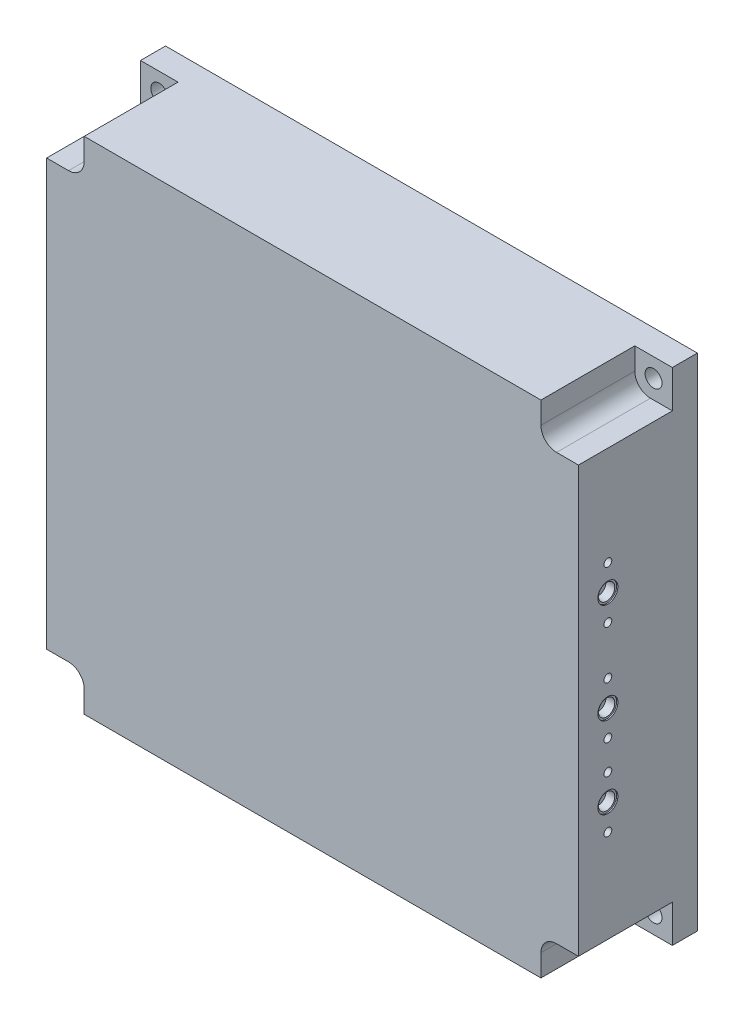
ISO-10303-21;
HEADER;
FILE_DESCRIPTION(('STEP AP214'),'2;1');
FILE_NAME('part.step','',(''),(''),'','','');
FILE_SCHEMA(('AUTOMOTIVE_DESIGN { 1 0 10303 214 1 1 1 1 }'));
ENDSEC;
DATA;
#1=APPLICATION_CONTEXT('core data for automotive mechanical design processes');
#2=APPLICATION_PROTOCOL_DEFINITION('international standard','automotive_design',2000,#1);
#3=PRODUCT_CONTEXT('',#1,'mechanical');
#4=PRODUCT('Part','Part','',(#3));
#5=PRODUCT_RELATED_PRODUCT_CATEGORY('part','',(#4));
#6=PRODUCT_DEFINITION_FORMATION('','',#4);
#7=PRODUCT_DEFINITION_CONTEXT('part definition',#1,'design');
#8=PRODUCT_DEFINITION('design','',#6,#7);
#9=PRODUCT_DEFINITION_SHAPE('','',#8);
#10=(LENGTH_UNIT() NAMED_UNIT(*) SI_UNIT(.MILLI.,.METRE.));
#11=(NAMED_UNIT(*) PLANE_ANGLE_UNIT() SI_UNIT($,.RADIAN.));
#12=(NAMED_UNIT(*) SI_UNIT($,.STERADIAN.) SOLID_ANGLE_UNIT());
#13=UNCERTAINTY_MEASURE_WITH_UNIT(LENGTH_MEASURE(1.E-05),#10,'distance_accuracy_value','');
#14=(GEOMETRIC_REPRESENTATION_CONTEXT(3) GLOBAL_UNCERTAINTY_ASSIGNED_CONTEXT((#13)) GLOBAL_UNIT_ASSIGNED_CONTEXT((#10,
#11,#12)) REPRESENTATION_CONTEXT('',''));
#15=CARTESIAN_POINT('',(0.,0.,0.));
#16=DIRECTION('',(0.,0.,1.));
#17=DIRECTION('',(1.,0.,0.));
#18=AXIS2_PLACEMENT_3D('',#15,#16,#17);
#19=CARTESIAN_POINT('',(176.570075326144,155.527658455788,1.));
#20=DIRECTION('',(0.,0.,1.));
#21=DIRECTION('',(1.,0.,0.));
#22=AXIS2_PLACEMENT_3D('',#19,#20,#21);
#23=PLANE('',#22);
#24=CARTESIAN_POINT('',(182.370075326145,146.377658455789,1.));
#25=DIRECTION('',(0.,0.,-1.));
#26=DIRECTION('',(-1.,0.,0.));
#27=AXIS2_PLACEMENT_3D('',#24,#25,#26);
#28=CIRCLE('',#27,0.624999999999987);
#29=CARTESIAN_POINT('',(181.745075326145,146.377658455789,1.));
#30=VERTEX_POINT('',#29);
#31=EDGE_CURVE('E641',#30,#30,#28,.T.);
#32=ORIENTED_EDGE('',*,*,#31,.F.);
#33=EDGE_LOOP('',(#32));
#34=FACE_BOUND('',#33,.T.);
#35=CARTESIAN_POINT('',(182.370075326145,141.127658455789,1.));
#36=DIRECTION('',(0.,0.,-1.));
#37=DIRECTION('',(-1.,0.,0.));
#38=AXIS2_PLACEMENT_3D('',#35,#36,#37);
#39=CIRCLE('',#38,0.624999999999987);
#40=CARTESIAN_POINT('',(181.745075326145,141.127658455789,1.));
#41=VERTEX_POINT('',#40);
#42=EDGE_CURVE('E649',#41,#41,#39,.T.);
#43=ORIENTED_EDGE('',*,*,#42,.F.);
#44=EDGE_LOOP('',(#43));
#45=FACE_BOUND('',#44,.T.);
#46=CARTESIAN_POINT('',(176.070075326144,155.327658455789,1.));
#47=DIRECTION('',(0.,0.,-1.));
#48=DIRECTION('',(-1.,0.,0.));
#49=AXIS2_PLACEMENT_3D('',#46,#47,#48);
#50=CIRCLE('',#49,0.624999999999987);
#51=CARTESIAN_POINT('',(175.445075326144,155.327658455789,1.));
#52=VERTEX_POINT('',#51);
#53=EDGE_CURVE('E655',#52,#52,#50,.T.);
#54=ORIENTED_EDGE('',*,*,#53,.F.);
#55=EDGE_LOOP('',(#54));
#56=FACE_BOUND('',#55,.T.);
#57=CARTESIAN_POINT('',(154.070075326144,155.327658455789,1.));
#58=DIRECTION('',(0.,0.,-1.));
#59=DIRECTION('',(-1.,0.,0.));
#60=AXIS2_PLACEMENT_3D('',#57,#58,#59);
#61=CIRCLE('',#60,0.624999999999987);
#62=CARTESIAN_POINT('',(153.445075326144,155.327658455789,1.));
#63=VERTEX_POINT('',#62);
#64=EDGE_CURVE('E661',#63,#63,#61,.T.);
#65=ORIENTED_EDGE('',*,*,#64,.F.);
#66=EDGE_LOOP('',(#65));
#67=FACE_BOUND('',#66,.T.);
#68=CARTESIAN_POINT('',(131.070075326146,155.327658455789,1.));
#69=DIRECTION('',(0.,0.,-1.));
#70=DIRECTION('',(-1.,0.,0.));
#71=AXIS2_PLACEMENT_3D('',#68,#69,#70);
#72=CIRCLE('',#71,0.624999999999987);
#73=CARTESIAN_POINT('',(130.445075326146,155.327658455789,1.));
#74=VERTEX_POINT('',#73);
#75=EDGE_CURVE('E667',#74,#74,#72,.T.);
#76=ORIENTED_EDGE('',*,*,#75,.F.);
#77=EDGE_LOOP('',(#76));
#78=FACE_BOUND('',#77,.T.);
#79=CARTESIAN_POINT('',(182.370075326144,110.327658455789,1.));
#80=DIRECTION('',(0.,0.,-1.));
#81=DIRECTION('',(-1.,0.,0.));
#82=AXIS2_PLACEMENT_3D('',#79,#80,#81);
#83=CIRCLE('',#82,0.624999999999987);
#84=CARTESIAN_POINT('',(181.745075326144,110.327658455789,1.));
#85=VERTEX_POINT('',#84);
#86=EDGE_CURVE('E751',#85,#85,#83,.T.);
#87=ORIENTED_EDGE('',*,*,#86,.F.);
#88=EDGE_LOOP('',(#87));
#89=FACE_BOUND('',#88,.T.);
#90=CARTESIAN_POINT('',(182.370075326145,125.727658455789,1.));
#91=DIRECTION('',(0.,0.,-1.));
#92=DIRECTION('',(-1.,0.,0.));
#93=AXIS2_PLACEMENT_3D('',#90,#91,#92);
#94=CIRCLE('',#93,0.624999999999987);
#95=CARTESIAN_POINT('',(181.745075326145,125.727658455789,1.));
#96=VERTEX_POINT('',#95);
#97=EDGE_CURVE('E757',#96,#96,#94,.T.);
#98=ORIENTED_EDGE('',*,*,#97,.F.);
#99=EDGE_LOOP('',(#98));
#100=FACE_BOUND('',#99,.T.);
#101=DIRECTION('',(0.,-1.,0.));
#102=VECTOR('',#101,1.);
#103=CARTESIAN_POINT('',(175.270075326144,84.0276584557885,1.));
#104=LINE('',#103,#102);
#105=CARTESIAN_POINT('',(175.270075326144,152.027658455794,1.));
#106=VERTEX_POINT('',#105);
#107=CARTESIAN_POINT('',(175.270075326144,84.0276584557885,1.));
#108=VERTEX_POINT('',#107);
#109=EDGE_CURVE('E791',#106,#108,#104,.T.);
#110=ORIENTED_EDGE('',*,*,#109,.F.);
#111=CARTESIAN_POINT('',(173.270075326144,152.027658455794,1.));
#112=DIRECTION('',(0.,0.,-1.));
#113=DIRECTION('',(1.,0.,0.));
#114=AXIS2_PLACEMENT_3D('',#111,#112,#113);
#115=CIRCLE('',#114,2.00000000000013);
#116=CARTESIAN_POINT('',(173.270075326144,154.027658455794,1.));
#117=VERTEX_POINT('',#116);
#118=EDGE_CURVE('E763',#117,#106,#115,.T.);
#119=ORIENTED_EDGE('',*,*,#118,.F.);
#120=DIRECTION('',(1.,0.,0.));
#121=VECTOR('',#120,1.);
#122=CARTESIAN_POINT('',(173.270075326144,154.027658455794,1.));
#123=LINE('',#122,#121);
#124=CARTESIAN_POINT('',(111.870075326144,154.027658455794,1.));
#125=VERTEX_POINT('',#124);
#126=EDGE_CURVE('E768',#125,#117,#123,.T.);
#127=ORIENTED_EDGE('',*,*,#126,.F.);
#128=CARTESIAN_POINT('',(111.870075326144,152.027658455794,1.));
#129=DIRECTION('',(0.,0.,-1.));
#130=DIRECTION('',(1.,0.,0.));
#131=AXIS2_PLACEMENT_3D('',#128,#129,#130);
#132=CIRCLE('',#131,2.);
#133=CARTESIAN_POINT('',(109.870075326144,152.027658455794,1.));
#134=VERTEX_POINT('',#133);
#135=EDGE_CURVE('E806',#134,#125,#132,.T.);
#136=ORIENTED_EDGE('',*,*,#135,.F.);
#137=DIRECTION('',(0.,1.,0.));
#138=VECTOR('',#137,1.);
#139=CARTESIAN_POINT('',(109.870075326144,152.027658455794,1.));
#140=LINE('',#139,#138);
#141=CARTESIAN_POINT('',(109.870075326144,84.0276584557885,1.));
#142=VERTEX_POINT('',#141);
#143=EDGE_CURVE('E803',#142,#134,#140,.T.);
#144=ORIENTED_EDGE('',*,*,#143,.F.);
#145=CARTESIAN_POINT('',(111.870075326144,84.0276584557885,1.));
#146=DIRECTION('',(0.,0.,-1.));
#147=DIRECTION('',(1.,0.,0.));
#148=AXIS2_PLACEMENT_3D('',#145,#146,#147);
#149=CIRCLE('',#148,1.99999999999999);
#150=CARTESIAN_POINT('',(111.870075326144,82.0276584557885,1.));
#151=VERTEX_POINT('',#150);
#152=EDGE_CURVE('E800',#151,#142,#149,.T.);
#153=ORIENTED_EDGE('',*,*,#152,.F.);
#154=DIRECTION('',(-1.,0.,0.));
#155=VECTOR('',#154,1.);
#156=CARTESIAN_POINT('',(111.870075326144,82.0276584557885,1.));
#157=LINE('',#156,#155);
#158=CARTESIAN_POINT('',(173.270075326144,82.0276584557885,1.));
#159=VERTEX_POINT('',#158);
#160=EDGE_CURVE('E797',#159,#151,#157,.T.);
#161=ORIENTED_EDGE('',*,*,#160,.F.);
#162=CARTESIAN_POINT('',(173.270075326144,84.0276584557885,1.));
#163=DIRECTION('',(0.,0.,-1.));
#164=DIRECTION('',(1.,0.,0.));
#165=AXIS2_PLACEMENT_3D('',#162,#163,#164);
#166=CIRCLE('',#165,2.);
#167=EDGE_CURVE('E794',#108,#159,#166,.T.);
#168=ORIENTED_EDGE('',*,*,#167,.F.);
#169=EDGE_LOOP('',(#110,#119,#127,#136,#144,#153,#161,#168));
#170=FACE_BOUND('',#169,.T.);
#171=CARTESIAN_POINT('',(176.570075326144,155.527658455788,1.));
#172=DIRECTION('',(0.,0.,-1.));
#173=DIRECTION('',(1.,0.,0.));
#174=AXIS2_PLACEMENT_3D('',#171,#172,#173);
#175=CIRCLE('',#174,1.50000000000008);
#176=CARTESIAN_POINT('',(176.570075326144,157.027658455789,1.));
#177=VERTEX_POINT('',#176);
#178=CARTESIAN_POINT('',(178.070075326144,155.527658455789,1.));
#179=VERTEX_POINT('',#178);
#180=EDGE_CURVE('E830',#177,#179,#175,.T.);
#181=ORIENTED_EDGE('',*,*,#180,.T.);
#182=DIRECTION('',(0.,-1.,0.));
#183=VECTOR('',#182,1.);
#184=CARTESIAN_POINT('',(178.070075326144,151.027658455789,1.));
#185=LINE('',#184,#183);
#186=CARTESIAN_POINT('',(178.070075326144,151.027658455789,1.));
#187=VERTEX_POINT('',#186);
#188=EDGE_CURVE('E833',#179,#187,#185,.T.);
#189=ORIENTED_EDGE('',*,*,#188,.T.);
#190=DIRECTION('',(1.,0.,0.));
#191=VECTOR('',#190,1.);
#192=CARTESIAN_POINT('',(182.570075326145,151.027658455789,1.));
#193=LINE('',#192,#191);
#194=CARTESIAN_POINT('',(182.570075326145,151.027658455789,1.));
#195=VERTEX_POINT('',#194);
#196=EDGE_CURVE('E837',#187,#195,#193,.T.);
#197=ORIENTED_EDGE('',*,*,#196,.T.);
#198=CARTESIAN_POINT('',(182.570075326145,149.527658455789,1.));
#199=DIRECTION('',(0.,0.,-1.));
#200=DIRECTION('',(1.,0.,0.));
#201=AXIS2_PLACEMENT_3D('',#198,#199,#200);
#202=CIRCLE('',#201,1.49999999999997);
#203=CARTESIAN_POINT('',(184.070075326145,149.527658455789,1.));
#204=VERTEX_POINT('',#203);
#205=EDGE_CURVE('E840',#195,#204,#202,.T.);
#206=ORIENTED_EDGE('',*,*,#205,.T.);
#207=DIRECTION('',(0.,-1.,0.));
#208=VECTOR('',#207,1.);
#209=CARTESIAN_POINT('',(184.070075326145,86.527658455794,1.));
#210=LINE('',#209,#208);
#211=CARTESIAN_POINT('',(184.070075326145,86.527658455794,1.));
#212=VERTEX_POINT('',#211);
#213=EDGE_CURVE('E843',#204,#212,#210,.T.);
#214=ORIENTED_EDGE('',*,*,#213,.T.);
#215=CARTESIAN_POINT('',(182.570075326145,86.527658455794,1.));
#216=DIRECTION('',(0.,0.,-1.));
#217=DIRECTION('',(1.,0.,0.));
#218=AXIS2_PLACEMENT_3D('',#215,#216,#217);
#219=CIRCLE('',#218,1.49999999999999);
#220=CARTESIAN_POINT('',(182.570075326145,85.027658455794,1.));
#221=VERTEX_POINT('',#220);
#222=EDGE_CURVE('E846',#212,#221,#219,.T.);
#223=ORIENTED_EDGE('',*,*,#222,.T.);
#224=DIRECTION('',(-1.,0.,0.));
#225=VECTOR('',#224,1.);
#226=CARTESIAN_POINT('',(178.070075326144,85.027658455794,1.));
#227=LINE('',#226,#225);
#228=CARTESIAN_POINT('',(178.070075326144,85.027658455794,1.));
#229=VERTEX_POINT('',#228);
#230=EDGE_CURVE('E849',#221,#229,#227,.T.);
#231=ORIENTED_EDGE('',*,*,#230,.T.);
#232=DIRECTION('',(0.,-1.,0.));
#233=VECTOR('',#232,1.);
#234=CARTESIAN_POINT('',(178.070075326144,80.5276584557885,1.));
#235=LINE('',#234,#233);
#236=CARTESIAN_POINT('',(178.070075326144,80.5276584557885,1.));
#237=VERTEX_POINT('',#236);
#238=EDGE_CURVE('E852',#229,#237,#235,.T.);
#239=ORIENTED_EDGE('',*,*,#238,.T.);
#240=CARTESIAN_POINT('',(176.570075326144,80.5276584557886,1.));
#241=DIRECTION('',(0.,0.,-1.));
#242=DIRECTION('',(1.,0.,0.));
#243=AXIS2_PLACEMENT_3D('',#240,#241,#242);
#244=CIRCLE('',#243,1.50000000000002);
#245=CARTESIAN_POINT('',(176.570075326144,79.0276584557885,1.));
#246=VERTEX_POINT('',#245);
#247=EDGE_CURVE('E855',#237,#246,#244,.T.);
#248=ORIENTED_EDGE('',*,*,#247,.T.);
#249=DIRECTION('',(-1.,0.,0.));
#250=VECTOR('',#249,1.);
#251=CARTESIAN_POINT('',(108.570075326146,79.0276584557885,1.));
#252=LINE('',#251,#250);
#253=CARTESIAN_POINT('',(108.570075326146,79.0276584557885,1.));
#254=VERTEX_POINT('',#253);
#255=EDGE_CURVE('E858',#246,#254,#252,.T.);
#256=ORIENTED_EDGE('',*,*,#255,.T.);
#257=CARTESIAN_POINT('',(108.570075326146,80.5276584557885,1.));
#258=DIRECTION('',(0.,0.,-1.));
#259=DIRECTION('',(1.,0.,0.));
#260=AXIS2_PLACEMENT_3D('',#257,#258,#259);
#261=CIRCLE('',#260,1.49999999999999);
#262=CARTESIAN_POINT('',(107.070075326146,80.5276584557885,1.));
#263=VERTEX_POINT('',#262);
#264=EDGE_CURVE('E861',#254,#263,#261,.T.);
#265=ORIENTED_EDGE('',*,*,#264,.T.);
#266=DIRECTION('',(0.,1.,0.));
#267=VECTOR('',#266,1.);
#268=CARTESIAN_POINT('',(107.070075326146,85.027658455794,1.));
#269=LINE('',#268,#267);
#270=CARTESIAN_POINT('',(107.070075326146,85.027658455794,1.));
#271=VERTEX_POINT('',#270);
#272=EDGE_CURVE('E864',#263,#271,#269,.T.);
#273=ORIENTED_EDGE('',*,*,#272,.T.);
#274=DIRECTION('',(-1.,0.,0.));
#275=VECTOR('',#274,1.);
#276=CARTESIAN_POINT('',(102.570075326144,85.027658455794,1.));
#277=LINE('',#276,#275);
#278=CARTESIAN_POINT('',(102.570075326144,85.027658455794,1.));
#279=VERTEX_POINT('',#278);
#280=EDGE_CURVE('E867',#271,#279,#277,.T.);
#281=ORIENTED_EDGE('',*,*,#280,.T.);
#282=CARTESIAN_POINT('',(102.570075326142,86.5276584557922,1.));
#283=DIRECTION('',(0.,0.,-1.));
#284=DIRECTION('',(1.,0.,0.));
#285=AXIS2_PLACEMENT_3D('',#282,#283,#284);
#286=CIRCLE('',#285,1.49999999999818);
#287=CARTESIAN_POINT('',(101.070075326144,86.527658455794,1.));
#288=VERTEX_POINT('',#287);
#289=EDGE_CURVE('E870',#279,#288,#286,.T.);
#290=ORIENTED_EDGE('',*,*,#289,.T.);
#291=DIRECTION('',(0.,1.,0.));
#292=VECTOR('',#291,1.);
#293=CARTESIAN_POINT('',(101.070075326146,149.527658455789,1.));
#294=LINE('',#293,#292);
#295=CARTESIAN_POINT('',(101.070075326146,149.527658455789,1.));
#296=VERTEX_POINT('',#295);
#297=EDGE_CURVE('E873',#288,#296,#294,.T.);
#298=ORIENTED_EDGE('',*,*,#297,.T.);
#299=CARTESIAN_POINT('',(102.570075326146,149.527658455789,1.));
#300=DIRECTION('',(0.,0.,-1.));
#301=DIRECTION('',(1.,0.,0.));
#302=AXIS2_PLACEMENT_3D('',#299,#300,#301);
#303=CIRCLE('',#302,1.49999999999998);
#304=CARTESIAN_POINT('',(102.570075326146,151.027658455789,1.));
#305=VERTEX_POINT('',#304);
#306=EDGE_CURVE('E876',#296,#305,#303,.T.);
#307=ORIENTED_EDGE('',*,*,#306,.T.);
#308=DIRECTION('',(1.,0.,0.));
#309=VECTOR('',#308,1.);
#310=CARTESIAN_POINT('',(107.070075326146,151.027658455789,1.));
#311=LINE('',#310,#309);
#312=CARTESIAN_POINT('',(107.070075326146,151.027658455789,1.));
#313=VERTEX_POINT('',#312);
#314=EDGE_CURVE('E879',#305,#313,#311,.T.);
#315=ORIENTED_EDGE('',*,*,#314,.T.);
#316=DIRECTION('',(0.,1.,0.));
#317=VECTOR('',#316,1.);
#318=CARTESIAN_POINT('',(107.070075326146,155.527658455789,1.));
#319=LINE('',#318,#317);
#320=CARTESIAN_POINT('',(107.070075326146,155.527658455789,1.));
#321=VERTEX_POINT('',#320);
#322=EDGE_CURVE('E882',#313,#321,#319,.T.);
#323=ORIENTED_EDGE('',*,*,#322,.T.);
#324=CARTESIAN_POINT('',(108.570075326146,155.527658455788,1.));
#325=DIRECTION('',(0.,0.,-1.));
#326=DIRECTION('',(1.,0.,0.));
#327=AXIS2_PLACEMENT_3D('',#324,#325,#326);
#328=CIRCLE('',#327,1.50000000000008);
#329=CARTESIAN_POINT('',(108.570075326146,157.027658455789,1.));
#330=VERTEX_POINT('',#329);
#331=EDGE_CURVE('E885',#321,#330,#328,.T.);
#332=ORIENTED_EDGE('',*,*,#331,.T.);
#333=DIRECTION('',(1.,0.,0.));
#334=VECTOR('',#333,1.);
#335=CARTESIAN_POINT('',(176.570075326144,157.027658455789,1.));
#336=LINE('',#335,#334);
#337=EDGE_CURVE('E888',#330,#177,#336,.T.);
#338=ORIENTED_EDGE('',*,*,#337,.T.);
#339=EDGE_LOOP('',(#181,#189,#197,#206,#214,#223,#231,#239,#248,#256,#265,#273,#281,#290,#298,
#307,#315,#323,#332,#338));
#340=FACE_BOUND('',#339,.T.);
#341=CARTESIAN_POINT('',(182.370075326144,94.9276584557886,1.));
#342=DIRECTION('',(0.,0.,-1.));
#343=DIRECTION('',(-1.,0.,0.));
#344=AXIS2_PLACEMENT_3D('',#341,#342,#343);
#345=CIRCLE('',#344,0.624999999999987);
#346=CARTESIAN_POINT('',(181.745075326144,94.9276584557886,1.));
#347=VERTEX_POINT('',#346);
#348=EDGE_CURVE('E745',#347,#347,#345,.T.);
#349=ORIENTED_EDGE('',*,*,#348,.F.);
#350=EDGE_LOOP('',(#349));
#351=FACE_BOUND('',#350,.T.);
#352=CARTESIAN_POINT('',(182.370075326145,89.6776584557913,1.));
#353=DIRECTION('',(0.,0.,-1.));
#354=DIRECTION('',(-1.,0.,0.));
#355=AXIS2_PLACEMENT_3D('',#352,#353,#354);
#356=CIRCLE('',#355,0.624999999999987);
#357=CARTESIAN_POINT('',(181.745075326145,89.6776584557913,1.));
#358=VERTEX_POINT('',#357);
#359=EDGE_CURVE('E739',#358,#358,#356,.T.);
#360=ORIENTED_EDGE('',*,*,#359,.F.);
#361=EDGE_LOOP('',(#360));
#362=FACE_BOUND('',#361,.T.);
#363=CARTESIAN_POINT('',(176.070075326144,80.7276584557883,1.));
#364=DIRECTION('',(0.,0.,-1.));
#365=DIRECTION('',(-1.,0.,0.));
#366=AXIS2_PLACEMENT_3D('',#363,#364,#365);
#367=CIRCLE('',#366,0.624999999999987);
#368=CARTESIAN_POINT('',(175.445075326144,80.7276584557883,1.));
#369=VERTEX_POINT('',#368);
#370=EDGE_CURVE('E733',#369,#369,#367,.T.);
#371=ORIENTED_EDGE('',*,*,#370,.F.);
#372=EDGE_LOOP('',(#371));
#373=FACE_BOUND('',#372,.T.);
#374=CARTESIAN_POINT('',(154.070075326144,80.7276584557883,1.));
#375=DIRECTION('',(0.,0.,-1.));
#376=DIRECTION('',(-1.,0.,0.));
#377=AXIS2_PLACEMENT_3D('',#374,#375,#376);
#378=CIRCLE('',#377,0.624999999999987);
#379=CARTESIAN_POINT('',(153.445075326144,80.7276584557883,1.));
#380=VERTEX_POINT('',#379);
#381=EDGE_CURVE('E727',#380,#380,#378,.T.);
#382=ORIENTED_EDGE('',*,*,#381,.F.);
#383=EDGE_LOOP('',(#382));
#384=FACE_BOUND('',#383,.T.);
#385=CARTESIAN_POINT('',(131.070075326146,80.7276584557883,1.));
#386=DIRECTION('',(0.,0.,-1.));
#387=DIRECTION('',(-1.,0.,0.));
#388=AXIS2_PLACEMENT_3D('',#385,#386,#387);
#389=CIRCLE('',#388,0.624999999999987);
#390=CARTESIAN_POINT('',(130.445075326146,80.7276584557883,1.));
#391=VERTEX_POINT('',#390);
#392=EDGE_CURVE('E721',#391,#391,#389,.T.);
#393=ORIENTED_EDGE('',*,*,#392,.F.);
#394=EDGE_LOOP('',(#393));
#395=FACE_BOUND('',#394,.T.);
#396=CARTESIAN_POINT('',(109.070075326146,80.7276584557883,1.));
#397=DIRECTION('',(0.,0.,-1.));
#398=DIRECTION('',(-1.,0.,0.));
#399=AXIS2_PLACEMENT_3D('',#396,#397,#398);
#400=CIRCLE('',#399,0.625000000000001);
#401=CARTESIAN_POINT('',(108.445075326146,80.7276584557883,1.));
#402=VERTEX_POINT('',#401);
#403=EDGE_CURVE('E715',#402,#402,#400,.T.);
#404=ORIENTED_EDGE('',*,*,#403,.F.);
#405=EDGE_LOOP('',(#404));
#406=FACE_BOUND('',#405,.T.);
#407=CARTESIAN_POINT('',(102.770075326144,89.6776584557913,1.));
#408=DIRECTION('',(0.,0.,-1.));
#409=DIRECTION('',(-1.,0.,0.));
#410=AXIS2_PLACEMENT_3D('',#407,#408,#409);
#411=CIRCLE('',#410,0.625000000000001);
#412=CARTESIAN_POINT('',(102.145075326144,89.6776584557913,1.));
#413=VERTEX_POINT('',#412);
#414=EDGE_CURVE('E709',#413,#413,#411,.T.);
#415=ORIENTED_EDGE('',*,*,#414,.F.);
#416=EDGE_LOOP('',(#415));
#417=FACE_BOUND('',#416,.T.);
#418=CARTESIAN_POINT('',(102.770075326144,94.92765845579,1.));
#419=DIRECTION('',(0.,0.,-1.));
#420=DIRECTION('',(-1.,0.,0.));
#421=AXIS2_PLACEMENT_3D('',#418,#419,#420);
#422=CIRCLE('',#421,0.625000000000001);
#423=CARTESIAN_POINT('',(102.145075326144,94.92765845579,1.));
#424=VERTEX_POINT('',#423);
#425=EDGE_CURVE('E703',#424,#424,#422,.T.);
#426=ORIENTED_EDGE('',*,*,#425,.F.);
#427=EDGE_LOOP('',(#426));
#428=FACE_BOUND('',#427,.T.);
#429=CARTESIAN_POINT('',(102.770075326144,110.32765845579,1.));
#430=DIRECTION('',(0.,0.,-1.));
#431=DIRECTION('',(-1.,0.,0.));
#432=AXIS2_PLACEMENT_3D('',#429,#430,#431);
#433=CIRCLE('',#432,0.625000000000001);
#434=CARTESIAN_POINT('',(102.145075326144,110.32765845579,1.));
#435=VERTEX_POINT('',#434);
#436=EDGE_CURVE('E697',#435,#435,#433,.T.);
#437=ORIENTED_EDGE('',*,*,#436,.F.);
#438=EDGE_LOOP('',(#437));
#439=FACE_BOUND('',#438,.T.);
#440=CARTESIAN_POINT('',(102.770075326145,125.727658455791,1.));
#441=DIRECTION('',(0.,0.,-1.));
#442=DIRECTION('',(-1.,0.,0.));
#443=AXIS2_PLACEMENT_3D('',#440,#441,#442);
#444=CIRCLE('',#443,0.625000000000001);
#445=CARTESIAN_POINT('',(102.145075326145,125.727658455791,1.));
#446=VERTEX_POINT('',#445);
#447=EDGE_CURVE('E691',#446,#446,#444,.T.);
#448=ORIENTED_EDGE('',*,*,#447,.F.);
#449=EDGE_LOOP('',(#448));
#450=FACE_BOUND('',#449,.T.);
#451=CARTESIAN_POINT('',(102.770075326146,141.127658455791,1.));
#452=DIRECTION('',(0.,0.,-1.));
#453=DIRECTION('',(-1.,0.,0.));
#454=AXIS2_PLACEMENT_3D('',#451,#452,#453);
#455=CIRCLE('',#454,0.625000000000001);
#456=CARTESIAN_POINT('',(102.145075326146,141.127658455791,1.));
#457=VERTEX_POINT('',#456);
#458=EDGE_CURVE('E685',#457,#457,#455,.T.);
#459=ORIENTED_EDGE('',*,*,#458,.F.);
#460=EDGE_LOOP('',(#459));
#461=FACE_BOUND('',#460,.T.);
#462=CARTESIAN_POINT('',(102.770075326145,146.377658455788,1.));
#463=DIRECTION('',(0.,0.,-1.));
#464=DIRECTION('',(-1.,0.,0.));
#465=AXIS2_PLACEMENT_3D('',#462,#463,#464);
#466=CIRCLE('',#465,0.625000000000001);
#467=CARTESIAN_POINT('',(102.145075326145,146.377658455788,1.));
#468=VERTEX_POINT('',#467);
#469=EDGE_CURVE('E679',#468,#468,#466,.T.);
#470=ORIENTED_EDGE('',*,*,#469,.F.);
#471=EDGE_LOOP('',(#470));
#472=FACE_BOUND('',#471,.T.);
#473=CARTESIAN_POINT('',(109.070075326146,155.327658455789,1.));
#474=DIRECTION('',(0.,0.,-1.));
#475=DIRECTION('',(-1.,0.,0.));
#476=AXIS2_PLACEMENT_3D('',#473,#474,#475);
#477=CIRCLE('',#476,0.625000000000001);
#478=CARTESIAN_POINT('',(108.445075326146,155.327658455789,1.));
#479=VERTEX_POINT('',#478);
#480=EDGE_CURVE('E673',#479,#479,#477,.T.);
#481=ORIENTED_EDGE('',*,*,#480,.F.);
#482=EDGE_LOOP('',(#481));
#483=FACE_BOUND('',#482,.T.);
#484=ADVANCED_FACE('F33',(#34,#45,#56,#67,#78,#89,#100,#170,#340,#351,#362,#373,#384,#395,#406,
#417,#428,#439,#450,#461,#472,#483),#23,.F.);
#485=CARTESIAN_POINT('',(100.070075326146,158.027658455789,19.));
#486=DIRECTION('',(1.,0.,0.));
#487=DIRECTION('',(0.,0.,-1.));
#488=AXIS2_PLACEMENT_3D('',#485,#486,#487);
#489=PLANE('',#488);
#490=CARTESIAN_POINT('',(100.070075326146,107.177659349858,14.3));
#491=DIRECTION('',(-1.,0.,0.));
#492=DIRECTION('',(0.,0.,1.));
#493=AXIS2_PLACEMENT_3D('',#490,#491,#492);
#494=CIRCLE('',#493,0.624999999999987);
#495=CARTESIAN_POINT('',(100.070075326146,107.177659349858,14.9249999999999));
#496=VERTEX_POINT('',#495);
#497=EDGE_CURVE('E493',#496,#496,#494,.T.);
#498=ORIENTED_EDGE('',*,*,#497,.F.);
#499=EDGE_LOOP('',(#498));
#500=FACE_BOUND('',#499,.T.);
#501=CARTESIAN_POINT('',(100.070075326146,98.8776593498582,14.3));
#502=DIRECTION('',(-1.,0.,0.));
#503=DIRECTION('',(0.,0.,1.));
#504=AXIS2_PLACEMENT_3D('',#501,#502,#503);
#505=CIRCLE('',#504,0.624999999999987);
#506=CARTESIAN_POINT('',(100.070075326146,98.8776593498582,14.9249999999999));
#507=VERTEX_POINT('',#506);
#508=EDGE_CURVE('E492',#507,#507,#505,.T.);
#509=ORIENTED_EDGE('',*,*,#508,.F.);
#510=EDGE_LOOP('',(#509));
#511=FACE_BOUND('',#510,.T.);
#512=CARTESIAN_POINT('',(100.070075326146,127.877659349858,14.3));
#513=DIRECTION('',(-1.,0.,0.));
#514=DIRECTION('',(0.,0.,1.));
#515=AXIS2_PLACEMENT_3D('',#512,#513,#514);
#516=CIRCLE('',#515,0.624999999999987);
#517=CARTESIAN_POINT('',(100.070075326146,127.877659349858,14.9249999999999));
#518=VERTEX_POINT('',#517);
#519=EDGE_CURVE('E505',#518,#518,#516,.T.);
#520=ORIENTED_EDGE('',*,*,#519,.F.);
#521=EDGE_LOOP('',(#520));
#522=FACE_BOUND('',#521,.T.);
#523=CARTESIAN_POINT('',(100.070075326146,136.177659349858,14.3));
#524=DIRECTION('',(-1.,0.,0.));
#525=DIRECTION('',(0.,0.,1.));
#526=AXIS2_PLACEMENT_3D('',#523,#524,#525);
#527=CIRCLE('',#526,0.624999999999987);
#528=CARTESIAN_POINT('',(100.070075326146,136.177659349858,14.9249999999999));
#529=VERTEX_POINT('',#528);
#530=EDGE_CURVE('E511',#529,#529,#527,.T.);
#531=ORIENTED_EDGE('',*,*,#530,.F.);
#532=EDGE_LOOP('',(#531));
#533=FACE_BOUND('',#532,.T.);
#534=CARTESIAN_POINT('',(100.070075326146,103.02765952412,14.2999999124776));
#535=DIRECTION('',(-1.,0.,0.));
#536=DIRECTION('',(0.,0.,1.));
#537=AXIS2_PLACEMENT_3D('',#534,#535,#536);
#538=CIRCLE('',#537,1.6);
#539=CARTESIAN_POINT('',(100.070075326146,103.02765952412,15.8999999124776));
#540=VERTEX_POINT('',#539);
#541=EDGE_CURVE('E539',#540,#540,#538,.T.);
#542=ORIENTED_EDGE('',*,*,#541,.F.);
#543=EDGE_LOOP('',(#542));
#544=FACE_BOUND('',#543,.T.);
#545=CARTESIAN_POINT('',(100.070075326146,132.027659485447,14.2999999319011));
#546=DIRECTION('',(-1.,0.,0.));
#547=DIRECTION('',(0.,0.,1.));
#548=AXIS2_PLACEMENT_3D('',#545,#546,#547);
#549=CIRCLE('',#548,1.6);
#550=CARTESIAN_POINT('',(100.070075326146,132.027659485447,15.8999999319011));
#551=VERTEX_POINT('',#550);
#552=EDGE_CURVE('E545',#551,#551,#549,.T.);
#553=ORIENTED_EDGE('',*,*,#552,.F.);
#554=EDGE_LOOP('',(#553));
#555=FACE_BOUND('',#554,.T.);
#556=DIRECTION('',(0.,1.,0.));
#557=VECTOR('',#556,1.);
#558=CARTESIAN_POINT('',(100.070075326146,158.027658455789,4.));
#559=LINE('',#558,#557);
#560=CARTESIAN_POINT('',(100.070075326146,78.0276602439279,4.));
#561=VERTEX_POINT('',#560);
#562=CARTESIAN_POINT('',(100.070075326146,84.0276593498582,4.));
#563=VERTEX_POINT('',#562);
#564=EDGE_CURVE('E1064',#561,#563,#559,.T.);
#565=ORIENTED_EDGE('',*,*,#564,.T.);
#566=DIRECTION('',(0.,0.,1.));
#567=VECTOR('',#566,1.);
#568=CARTESIAN_POINT('',(100.070075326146,84.0276593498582,19.));
#569=LINE('',#568,#567);
#570=CARTESIAN_POINT('',(100.070075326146,84.0276593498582,19.));
#571=VERTEX_POINT('',#570);
#572=EDGE_CURVE('E1056',#563,#571,#569,.T.);
#573=ORIENTED_EDGE('',*,*,#572,.T.);
#574=DIRECTION('',(0.,-1.,0.));
#575=VECTOR('',#574,1.);
#576=CARTESIAN_POINT('',(100.070075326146,158.027658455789,19.));
#577=LINE('',#576,#575);
#578=CARTESIAN_POINT('',(100.070075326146,152.027659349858,19.));
#579=VERTEX_POINT('',#578);
#580=EDGE_CURVE('E1122',#579,#571,#577,.T.);
#581=ORIENTED_EDGE('',*,*,#580,.F.);
#582=DIRECTION('',(0.,0.,-1.));
#583=VECTOR('',#582,1.);
#584=CARTESIAN_POINT('',(100.070075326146,152.027659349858,19.));
#585=LINE('',#584,#583);
#586=CARTESIAN_POINT('',(100.070075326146,152.027659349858,4.));
#587=VERTEX_POINT('',#586);
#588=EDGE_CURVE('E1088',#579,#587,#585,.T.);
#589=ORIENTED_EDGE('',*,*,#588,.T.);
#590=DIRECTION('',(0.,-1.,0.));
#591=VECTOR('',#590,1.);
#592=CARTESIAN_POINT('',(100.070075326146,158.027658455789,4.));
#593=LINE('',#592,#591);
#594=CARTESIAN_POINT('',(100.070075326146,158.027658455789,4.));
#595=VERTEX_POINT('',#594);
#596=EDGE_CURVE('E1091',#595,#587,#593,.T.);
#597=ORIENTED_EDGE('',*,*,#596,.F.);
#598=DIRECTION('',(0.,0.,-1.));
#599=VECTOR('',#598,1.);
#600=CARTESIAN_POINT('',(100.070075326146,158.027658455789,19.));
#601=LINE('',#600,#599);
#602=CARTESIAN_POINT('',(100.070075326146,158.027658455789,0.));
#603=VERTEX_POINT('',#602);
#604=EDGE_CURVE('E1134',#595,#603,#601,.T.);
#605=ORIENTED_EDGE('',*,*,#604,.T.);
#606=DIRECTION('',(0.,-1.,0.));
#607=VECTOR('',#606,1.);
#608=CARTESIAN_POINT('',(100.070075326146,158.027658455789,0.));
#609=LINE('',#608,#607);
#610=CARTESIAN_POINT('',(100.070075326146,78.0276602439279,0.));
#611=VERTEX_POINT('',#610);
#612=EDGE_CURVE('E1121',#603,#611,#609,.T.);
#613=ORIENTED_EDGE('',*,*,#612,.T.);
#614=DIRECTION('',(0.,0.,-1.));
#615=VECTOR('',#614,1.);
#616=CARTESIAN_POINT('',(100.070075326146,78.0276602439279,19.));
#617=LINE('',#616,#615);
#618=EDGE_CURVE('E1150',#561,#611,#617,.T.);
#619=ORIENTED_EDGE('',*,*,#618,.F.);
#620=EDGE_LOOP('',(#565,#573,#581,#589,#597,#605,#613,#619));
#621=FACE_BOUND('',#620,.T.);
#622=ADVANCED_FACE('F1277',(#500,#511,#522,#533,#544,#555,#621),#489,.F.);
#623=CARTESIAN_POINT('',(100.070075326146,78.0276602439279,19.));
#624=DIRECTION('',(0.,1.,0.));
#625=DIRECTION('',(0.,0.,1.));
#626=AXIS2_PLACEMENT_3D('',#623,#624,#625);
#627=PLANE('',#626);
#628=CARTESIAN_POINT('',(156.310075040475,78.0276602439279,12.1999992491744));
#629=DIRECTION('',(0.,-1.,0.));
#630=DIRECTION('',(0.,0.,-1.));
#631=AXIS2_PLACEMENT_3D('',#628,#629,#630);
#632=CIRCLE('',#631,0.799999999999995);
#633=CARTESIAN_POINT('',(156.310075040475,78.0276602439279,11.3999992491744));
#634=VERTEX_POINT('',#633);
#635=EDGE_CURVE('E1267',#634,#634,#632,.T.);
#636=ORIENTED_EDGE('',*,*,#635,.F.);
#637=EDGE_LOOP('',(#636));
#638=FACE_BOUND('',#637,.T.);
#639=CARTESIAN_POINT('',(174.470070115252,78.0276602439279,12.1999994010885));
#640=DIRECTION('',(0.,-1.,0.));
#641=DIRECTION('',(0.,0.,-1.));
#642=AXIS2_PLACEMENT_3D('',#639,#640,#641);
#643=CIRCLE('',#642,0.799999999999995);
#644=CARTESIAN_POINT('',(174.470070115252,78.0276602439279,11.3999994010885));
#645=VERTEX_POINT('',#644);
#646=EDGE_CURVE('E1261',#645,#645,#643,.T.);
#647=ORIENTED_EDGE('',*,*,#646,.F.);
#648=EDGE_LOOP('',(#647));
#649=FACE_BOUND('',#648,.T.);
#650=DIRECTION('',(1.,0.,0.));
#651=VECTOR('',#650,1.);
#652=CARTESIAN_POINT('',(158.170075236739,78.0276602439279,8.69999938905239));
#653=LINE('',#652,#651);
#654=CARTESIAN_POINT('',(160.170075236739,78.0276602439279,8.69999938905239));
#655=VERTEX_POINT('',#654);
#656=CARTESIAN_POINT('',(170.470075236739,78.0276602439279,8.69999938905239));
#657=VERTEX_POINT('',#656);
#658=EDGE_CURVE('E1235',#655,#657,#653,.T.);
#659=ORIENTED_EDGE('',*,*,#658,.F.);
#660=CARTESIAN_POINT('',(160.170075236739,78.0276602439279,10.6999993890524));
#661=DIRECTION('',(0.,1.,0.));
#662=DIRECTION('',(0.,0.,1.));
#663=AXIS2_PLACEMENT_3D('',#660,#661,#662);
#664=CIRCLE('',#663,2.);
#665=CARTESIAN_POINT('',(158.170075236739,78.0276602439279,10.6999993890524));
#666=VERTEX_POINT('',#665);
#667=EDGE_CURVE('E1209',#655,#666,#664,.T.);
#668=ORIENTED_EDGE('',*,*,#667,.T.);
#669=DIRECTION('',(0.,0.,-1.));
#670=VECTOR('',#669,1.);
#671=CARTESIAN_POINT('',(158.170075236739,78.0276602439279,15.6999993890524));
#672=LINE('',#671,#670);
#673=CARTESIAN_POINT('',(158.170075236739,78.0276602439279,13.6999993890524));
#674=VERTEX_POINT('',#673);
#675=EDGE_CURVE('E1220',#674,#666,#672,.T.);
#676=ORIENTED_EDGE('',*,*,#675,.F.);
#677=CARTESIAN_POINT('',(160.170075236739,78.0276602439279,13.6999993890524));
#678=DIRECTION('',(0.,1.,0.));
#679=DIRECTION('',(0.,0.,1.));
#680=AXIS2_PLACEMENT_3D('',#677,#678,#679);
#681=CIRCLE('',#680,2.);
#682=CARTESIAN_POINT('',(160.170075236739,78.0276602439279,15.6999993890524));
#683=VERTEX_POINT('',#682);
#684=EDGE_CURVE('E47',#674,#683,#681,.T.);
#685=ORIENTED_EDGE('',*,*,#684,.T.);
#686=DIRECTION('',(-1.,0.,0.));
#687=VECTOR('',#686,1.);
#688=CARTESIAN_POINT('',(158.170075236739,78.0276602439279,15.6999993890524));
#689=LINE('',#688,#687);
#690=CARTESIAN_POINT('',(170.470075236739,78.0276602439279,15.6999993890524));
#691=VERTEX_POINT('',#690);
#692=EDGE_CURVE('E499',#691,#683,#689,.T.);
#693=ORIENTED_EDGE('',*,*,#692,.F.);
#694=CARTESIAN_POINT('',(170.470075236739,78.0276602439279,13.6999993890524));
#695=DIRECTION('',(0.,1.,0.));
#696=DIRECTION('',(0.,0.,1.));
#697=AXIS2_PLACEMENT_3D('',#694,#695,#696);
#698=CIRCLE('',#697,2.);
#699=CARTESIAN_POINT('',(172.470075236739,78.0276602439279,13.6999993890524));
#700=VERTEX_POINT('',#699);
#701=EDGE_CURVE('E1205',#691,#700,#698,.T.);
#702=ORIENTED_EDGE('',*,*,#701,.T.);
#703=DIRECTION('',(0.,0.,1.));
#704=VECTOR('',#703,1.);
#705=CARTESIAN_POINT('',(172.470075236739,78.0276602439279,15.6999993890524));
#706=LINE('',#705,#704);
#707=CARTESIAN_POINT('',(172.470075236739,78.0276602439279,10.6999993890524));
#708=VERTEX_POINT('',#707);
#709=EDGE_CURVE('E1228',#708,#700,#706,.T.);
#710=ORIENTED_EDGE('',*,*,#709,.F.);
#711=CARTESIAN_POINT('',(170.470075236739,78.0276602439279,10.6999993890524));
#712=DIRECTION('',(0.,1.,0.));
#713=DIRECTION('',(0.,0.,1.));
#714=AXIS2_PLACEMENT_3D('',#711,#712,#713);
#715=CIRCLE('',#714,2.);
#716=EDGE_CURVE('E1201',#708,#657,#715,.T.);
#717=ORIENTED_EDGE('',*,*,#716,.T.);
#718=EDGE_LOOP('',(#659,#668,#676,#685,#693,#702,#710,#717));
#719=FACE_BOUND('',#718,.T.);
#720=DIRECTION('',(-1.,0.,0.));
#721=VECTOR('',#720,1.);
#722=CARTESIAN_POINT('',(100.070075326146,78.0276602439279,4.));
#723=LINE('',#722,#721);
#724=CARTESIAN_POINT('',(185.070076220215,78.0276602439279,4.));
#725=VERTEX_POINT('',#724);
#726=CARTESIAN_POINT('',(179.07007577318,78.0276602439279,4.));
#727=VERTEX_POINT('',#726);
#728=EDGE_CURVE('E1037',#725,#727,#723,.T.);
#729=ORIENTED_EDGE('',*,*,#728,.T.);
#730=DIRECTION('',(0.,0.,1.));
#731=VECTOR('',#730,1.);
#732=CARTESIAN_POINT('',(179.07007577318,78.0276602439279,19.));
#733=LINE('',#732,#731);
#734=CARTESIAN_POINT('',(179.07007577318,78.0276602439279,19.));
#735=VERTEX_POINT('',#734);
#736=EDGE_CURVE('E1029',#727,#735,#733,.T.);
#737=ORIENTED_EDGE('',*,*,#736,.T.);
#738=DIRECTION('',(1.,0.,0.));
#739=VECTOR('',#738,1.);
#740=CARTESIAN_POINT('',(100.070075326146,78.0276602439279,19.));
#741=LINE('',#740,#739);
#742=CARTESIAN_POINT('',(106.070076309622,78.0276602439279,19.));
#743=VERTEX_POINT('',#742);
#744=EDGE_CURVE('E1125',#743,#735,#741,.T.);
#745=ORIENTED_EDGE('',*,*,#744,.F.);
#746=DIRECTION('',(0.,0.,-1.));
#747=VECTOR('',#746,1.);
#748=CARTESIAN_POINT('',(106.070076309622,78.0276602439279,19.));
#749=LINE('',#748,#747);
#750=CARTESIAN_POINT('',(106.070076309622,78.0276602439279,4.));
#751=VERTEX_POINT('',#750);
#752=EDGE_CURVE('E1061',#743,#751,#749,.T.);
#753=ORIENTED_EDGE('',*,*,#752,.T.);
#754=DIRECTION('',(-1.,0.,0.));
#755=VECTOR('',#754,1.);
#756=CARTESIAN_POINT('',(100.070075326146,78.0276602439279,4.));
#757=LINE('',#756,#755);
#758=EDGE_CURVE('E1163',#751,#561,#757,.T.);
#759=ORIENTED_EDGE('',*,*,#758,.T.);
#760=ORIENTED_EDGE('',*,*,#618,.T.);
#761=DIRECTION('',(1.,0.,0.));
#762=VECTOR('',#761,1.);
#763=CARTESIAN_POINT('',(100.070075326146,78.0276602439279,0.));
#764=LINE('',#763,#762);
#765=CARTESIAN_POINT('',(185.070076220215,78.0276602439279,0.));
#766=VERTEX_POINT('',#765);
#767=EDGE_CURVE('E1137',#611,#766,#764,.T.);
#768=ORIENTED_EDGE('',*,*,#767,.T.);
#769=DIRECTION('',(0.,0.,-1.));
#770=VECTOR('',#769,1.);
#771=CARTESIAN_POINT('',(185.070076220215,78.0276602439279,19.));
#772=LINE('',#771,#770);
#773=EDGE_CURVE('E1148',#725,#766,#772,.T.);
#774=ORIENTED_EDGE('',*,*,#773,.F.);
#775=EDGE_LOOP('',(#729,#737,#745,#753,#759,#760,#768,#774));
#776=FACE_BOUND('',#775,.T.);
#777=ADVANCED_FACE('F1218',(#638,#649,#719,#776),#627,.F.);
#778=CARTESIAN_POINT('',(185.070076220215,158.027658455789,19.));
#779=DIRECTION('',(-1.,0.,0.));
#780=DIRECTION('',(0.,0.,1.));
#781=AXIS2_PLACEMENT_3D('',#778,#779,#780);
#782=PLANE('',#781);
#783=CARTESIAN_POINT('',(185.070076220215,120.177659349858,14.3));
#784=DIRECTION('',(1.,0.,0.));
#785=DIRECTION('',(0.,0.,-1.));
#786=AXIS2_PLACEMENT_3D('',#783,#784,#785);
#787=CIRCLE('',#786,0.624999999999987);
#788=CARTESIAN_POINT('',(185.070076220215,120.177659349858,13.675));
#789=VERTEX_POINT('',#788);
#790=EDGE_CURVE('E551',#789,#789,#787,.T.);
#791=ORIENTED_EDGE('',*,*,#790,.F.);
#792=EDGE_LOOP('',(#791));
#793=FACE_BOUND('',#792,.T.);
#794=CARTESIAN_POINT('',(185.070076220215,111.877659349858,14.3));
#795=DIRECTION('',(1.,0.,0.));
#796=DIRECTION('',(0.,0.,-1.));
#797=AXIS2_PLACEMENT_3D('',#794,#795,#796);
#798=CIRCLE('',#797,0.624999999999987);
#799=CARTESIAN_POINT('',(185.070076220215,111.877659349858,13.675));
#800=VERTEX_POINT('',#799);
#801=EDGE_CURVE('E559',#800,#800,#798,.T.);
#802=ORIENTED_EDGE('',*,*,#801,.F.);
#803=EDGE_LOOP('',(#802));
#804=FACE_BOUND('',#803,.T.);
#805=CARTESIAN_POINT('',(185.070076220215,107.177659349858,14.3));
#806=DIRECTION('',(1.,0.,0.));
#807=DIRECTION('',(0.,0.,-1.));
#808=AXIS2_PLACEMENT_3D('',#805,#806,#807);
#809=CIRCLE('',#808,0.624999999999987);
#810=CARTESIAN_POINT('',(185.070076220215,107.177659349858,13.675));
#811=VERTEX_POINT('',#810);
#812=EDGE_CURVE('E565',#811,#811,#809,.T.);
#813=ORIENTED_EDGE('',*,*,#812,.F.);
#814=EDGE_LOOP('',(#813));
#815=FACE_BOUND('',#814,.T.);
#816=CARTESIAN_POINT('',(185.070076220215,98.8776593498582,14.3));
#817=DIRECTION('',(1.,0.,0.));
#818=DIRECTION('',(0.,0.,-1.));
#819=AXIS2_PLACEMENT_3D('',#816,#817,#818);
#820=CIRCLE('',#819,0.624999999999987);
#821=CARTESIAN_POINT('',(185.070076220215,98.8776593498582,13.675));
#822=VERTEX_POINT('',#821);
#823=EDGE_CURVE('E571',#822,#822,#820,.T.);
#824=ORIENTED_EDGE('',*,*,#823,.F.);
#825=EDGE_LOOP('',(#824));
#826=FACE_BOUND('',#825,.T.);
#827=CARTESIAN_POINT('',(185.070076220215,127.877659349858,14.3));
#828=DIRECTION('',(1.,0.,0.));
#829=DIRECTION('',(0.,0.,-1.));
#830=AXIS2_PLACEMENT_3D('',#827,#828,#829);
#831=CIRCLE('',#830,0.624999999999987);
#832=CARTESIAN_POINT('',(185.070076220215,127.877659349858,13.675));
#833=VERTEX_POINT('',#832);
#834=EDGE_CURVE('E577',#833,#833,#831,.T.);
#835=ORIENTED_EDGE('',*,*,#834,.F.);
#836=EDGE_LOOP('',(#835));
#837=FACE_BOUND('',#836,.T.);
#838=CARTESIAN_POINT('',(185.070076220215,136.177659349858,14.3));
#839=DIRECTION('',(1.,0.,0.));
#840=DIRECTION('',(0.,0.,-1.));
#841=AXIS2_PLACEMENT_3D('',#838,#839,#840);
#842=CIRCLE('',#841,0.624999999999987);
#843=CARTESIAN_POINT('',(185.070076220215,136.177659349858,13.675));
#844=VERTEX_POINT('',#843);
#845=EDGE_CURVE('E583',#844,#844,#842,.T.);
#846=ORIENTED_EDGE('',*,*,#845,.F.);
#847=EDGE_LOOP('',(#846));
#848=FACE_BOUND('',#847,.T.);
#849=CARTESIAN_POINT('',(185.070076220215,103.027659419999,14.2999999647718));
#850=DIRECTION('',(1.,0.,0.));
#851=DIRECTION('',(0.,0.,-1.));
#852=AXIS2_PLACEMENT_3D('',#849,#850,#851);
#853=CIRCLE('',#852,1.6);
#854=CARTESIAN_POINT('',(185.070076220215,103.027659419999,12.6999999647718));
#855=VERTEX_POINT('',#854);
#856=EDGE_CURVE('E623',#855,#855,#853,.T.);
#857=ORIENTED_EDGE('',*,*,#856,.F.);
#858=EDGE_LOOP('',(#857));
#859=FACE_BOUND('',#858,.T.);
#860=CARTESIAN_POINT('',(185.070076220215,116.027659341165,14.300000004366));
#861=DIRECTION('',(1.,0.,0.));
#862=DIRECTION('',(0.,0.,-1.));
#863=AXIS2_PLACEMENT_3D('',#860,#861,#862);
#864=CIRCLE('',#863,1.6);
#865=CARTESIAN_POINT('',(185.070076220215,116.027659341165,12.700000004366));
#866=VERTEX_POINT('',#865);
#867=EDGE_CURVE('E629',#866,#866,#864,.T.);
#868=ORIENTED_EDGE('',*,*,#867,.F.);
#869=EDGE_LOOP('',(#868));
#870=FACE_BOUND('',#869,.T.);
#871=CARTESIAN_POINT('',(185.070076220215,132.027659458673,14.2999999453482));
#872=DIRECTION('',(1.,0.,0.));
#873=DIRECTION('',(0.,0.,-1.));
#874=AXIS2_PLACEMENT_3D('',#871,#872,#873);
#875=CIRCLE('',#874,1.6);
#876=CARTESIAN_POINT('',(185.070076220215,132.027659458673,12.6999999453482));
#877=VERTEX_POINT('',#876);
#878=EDGE_CURVE('E635',#877,#877,#875,.T.);
#879=ORIENTED_EDGE('',*,*,#878,.F.);
#880=EDGE_LOOP('',(#879));
#881=FACE_BOUND('',#880,.T.);
#882=DIRECTION('',(0.,1.,0.));
#883=VECTOR('',#882,1.);
#884=CARTESIAN_POINT('',(185.070076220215,158.027658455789,19.));
#885=LINE('',#884,#883);
#886=CARTESIAN_POINT('',(185.070076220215,84.0276593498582,19.));
#887=VERTEX_POINT('',#886);
#888=CARTESIAN_POINT('',(185.070076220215,152.027659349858,19.));
#889=VERTEX_POINT('',#888);
#890=EDGE_CURVE('E1129',#887,#889,#885,.T.);
#891=ORIENTED_EDGE('',*,*,#890,.F.);
#892=DIRECTION('',(0.,0.,-1.));
#893=VECTOR('',#892,1.);
#894=CARTESIAN_POINT('',(185.070076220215,84.0276593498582,19.));
#895=LINE('',#894,#893);
#896=CARTESIAN_POINT('',(185.070076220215,84.0276593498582,4.));
#897=VERTEX_POINT('',#896);
#898=EDGE_CURVE('E1034',#887,#897,#895,.T.);
#899=ORIENTED_EDGE('',*,*,#898,.T.);
#900=DIRECTION('',(0.,-1.,0.));
#901=VECTOR('',#900,1.);
#902=CARTESIAN_POINT('',(185.070076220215,158.027658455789,4.));
#903=LINE('',#902,#901);
#904=EDGE_CURVE('E1168',#897,#725,#903,.T.);
#905=ORIENTED_EDGE('',*,*,#904,.T.);
#906=ORIENTED_EDGE('',*,*,#773,.T.);
#907=DIRECTION('',(0.,1.,0.));
#908=VECTOR('',#907,1.);
#909=CARTESIAN_POINT('',(185.070076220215,158.027658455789,0.));
#910=LINE('',#909,#908);
#911=CARTESIAN_POINT('',(185.070076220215,158.027658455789,0.));
#912=VERTEX_POINT('',#911);
#913=EDGE_CURVE('E1140',#766,#912,#910,.T.);
#914=ORIENTED_EDGE('',*,*,#913,.T.);
#915=DIRECTION('',(0.,0.,-1.));
#916=VECTOR('',#915,1.);
#917=CARTESIAN_POINT('',(185.070076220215,158.027658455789,19.));
#918=LINE('',#917,#916);
#919=CARTESIAN_POINT('',(185.070076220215,158.027658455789,4.));
#920=VERTEX_POINT('',#919);
#921=EDGE_CURVE('E1146',#920,#912,#918,.T.);
#922=ORIENTED_EDGE('',*,*,#921,.F.);
#923=DIRECTION('',(0.,-1.,0.));
#924=VECTOR('',#923,1.);
#925=CARTESIAN_POINT('',(185.070076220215,158.027658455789,4.));
#926=LINE('',#925,#924);
#927=CARTESIAN_POINT('',(185.070076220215,152.027659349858,4.));
#928=VERTEX_POINT('',#927);
#929=EDGE_CURVE('E1118',#920,#928,#926,.T.);
#930=ORIENTED_EDGE('',*,*,#929,.T.);
#931=DIRECTION('',(0.,0.,1.));
#932=VECTOR('',#931,1.);
#933=CARTESIAN_POINT('',(185.070076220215,152.027659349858,19.));
#934=LINE('',#933,#932);
#935=EDGE_CURVE('E1110',#928,#889,#934,.T.);
#936=ORIENTED_EDGE('',*,*,#935,.T.);
#937=EDGE_LOOP('',(#891,#899,#905,#906,#914,#922,#930,#936));
#938=FACE_BOUND('',#937,.T.);
#939=ADVANCED_FACE('F1276',(#793,#804,#815,#826,#837,#848,#859,#870,#881,#938),#782,.F.);
#940=CARTESIAN_POINT('',(100.070075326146,158.027658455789,19.));
#941=DIRECTION('',(0.,-1.,0.));
#942=DIRECTION('',(0.,0.,-1.));
#943=AXIS2_PLACEMENT_3D('',#940,#941,#942);
#944=PLANE('',#943);
#945=DIRECTION('',(-1.,0.,0.));
#946=VECTOR('',#945,1.);
#947=CARTESIAN_POINT('',(100.070075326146,158.027658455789,4.));
#948=LINE('',#947,#946);
#949=CARTESIAN_POINT('',(106.07007577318,158.027658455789,4.));
#950=VERTEX_POINT('',#949);
#951=EDGE_CURVE('E1159',#950,#595,#948,.T.);
#952=ORIENTED_EDGE('',*,*,#951,.F.);
#953=DIRECTION('',(0.,0.,1.));
#954=VECTOR('',#953,1.);
#955=CARTESIAN_POINT('',(106.07007577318,158.027658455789,19.));
#956=LINE('',#955,#954);
#957=CARTESIAN_POINT('',(106.07007577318,158.027658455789,19.));
#958=VERTEX_POINT('',#957);
#959=EDGE_CURVE('E1083',#950,#958,#956,.T.);
#960=ORIENTED_EDGE('',*,*,#959,.T.);
#961=DIRECTION('',(-1.,0.,0.));
#962=VECTOR('',#961,1.);
#963=CARTESIAN_POINT('',(100.070075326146,158.027658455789,19.));
#964=LINE('',#963,#962);
#965=CARTESIAN_POINT('',(179.07007577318,158.027658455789,19.));
#966=VERTEX_POINT('',#965);
#967=EDGE_CURVE('E1131',#966,#958,#964,.T.);
#968=ORIENTED_EDGE('',*,*,#967,.F.);
#969=DIRECTION('',(0.,0.,-1.));
#970=VECTOR('',#969,1.);
#971=CARTESIAN_POINT('',(179.07007577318,158.027658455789,19.));
#972=LINE('',#971,#970);
#973=CARTESIAN_POINT('',(179.07007577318,158.027658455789,4.));
#974=VERTEX_POINT('',#973);
#975=EDGE_CURVE('E1115',#966,#974,#972,.T.);
#976=ORIENTED_EDGE('',*,*,#975,.T.);
#977=DIRECTION('',(1.,0.,0.));
#978=VECTOR('',#977,1.);
#979=CARTESIAN_POINT('',(100.070075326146,158.027658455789,4.));
#980=LINE('',#979,#978);
#981=EDGE_CURVE('E1154',#974,#920,#980,.T.);
#982=ORIENTED_EDGE('',*,*,#981,.T.);
#983=ORIENTED_EDGE('',*,*,#921,.T.);
#984=DIRECTION('',(-1.,0.,0.));
#985=VECTOR('',#984,1.);
#986=CARTESIAN_POINT('',(100.070075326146,158.027658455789,0.));
#987=LINE('',#986,#985);
#988=EDGE_CURVE('E1126',#912,#603,#987,.T.);
#989=ORIENTED_EDGE('',*,*,#988,.T.);
#990=ORIENTED_EDGE('',*,*,#604,.F.);
#991=EDGE_LOOP('',(#952,#960,#968,#976,#982,#983,#989,#990));
#992=FACE_BOUND('',#991,.T.);
#993=ADVANCED_FACE('F1468',(#992),#944,.F.);
#994=CARTESIAN_POINT('',(0.,0.,19.));
#995=DIRECTION('',(0.,0.,1.));
#996=DIRECTION('',(1.,0.,0.));
#997=AXIS2_PLACEMENT_3D('',#994,#995,#996);
#998=PLANE('',#997);
#999=DIRECTION('',(-1.,0.,0.));
#1000=VECTOR('',#999,1.);
#1001=CARTESIAN_POINT('',(0.,84.0276593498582,19.));
#1002=LINE('',#1001,#1000);
#1003=CARTESIAN_POINT('',(181.57007577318,84.0276593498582,19.));
#1004=VERTEX_POINT('',#1003);
#1005=EDGE_CURVE('E1166',#887,#1004,#1002,.T.);
#1006=ORIENTED_EDGE('',*,*,#1005,.F.);
#1007=ORIENTED_EDGE('',*,*,#890,.T.);
#1008=DIRECTION('',(1.,0.,0.));
#1009=VECTOR('',#1008,1.);
#1010=CARTESIAN_POINT('',(187.867800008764,152.027659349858,19.));
#1011=LINE('',#1010,#1009);
#1012=CARTESIAN_POINT('',(181.57007577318,152.027659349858,19.));
#1013=VERTEX_POINT('',#1012);
#1014=EDGE_CURVE('E1098',#1013,#889,#1011,.T.);
#1015=ORIENTED_EDGE('',*,*,#1014,.F.);
#1016=CARTESIAN_POINT('',(181.57007577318,154.527659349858,19.));
#1017=DIRECTION('',(0.,0.,1.));
#1018=DIRECTION('',(-1.,0.,0.));
#1019=AXIS2_PLACEMENT_3D('',#1016,#1017,#1018);
#1020=CIRCLE('',#1019,2.5);
#1021=CARTESIAN_POINT('',(179.07007577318,154.527659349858,19.));
#1022=VERTEX_POINT('',#1021);
#1023=EDGE_CURVE('E1093',#1022,#1013,#1020,.T.);
#1024=ORIENTED_EDGE('',*,*,#1023,.F.);
#1025=DIRECTION('',(0.,-1.,0.));
#1026=VECTOR('',#1025,1.);
#1027=CARTESIAN_POINT('',(179.07007577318,0.,19.));
#1028=LINE('',#1027,#1026);
#1029=EDGE_CURVE('E1152',#966,#1022,#1028,.T.);
#1030=ORIENTED_EDGE('',*,*,#1029,.F.);
#1031=ORIENTED_EDGE('',*,*,#967,.T.);
#1032=DIRECTION('',(0.,1.,0.));
#1033=VECTOR('',#1032,1.);
#1034=CARTESIAN_POINT('',(106.07007577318,154.527659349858,19.));
#1035=LINE('',#1034,#1033);
#1036=CARTESIAN_POINT('',(106.07007577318,154.527659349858,19.));
#1037=VERTEX_POINT('',#1036);
#1038=EDGE_CURVE('E1072',#1037,#958,#1035,.T.);
#1039=ORIENTED_EDGE('',*,*,#1038,.F.);
#1040=CARTESIAN_POINT('',(103.57007577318,154.527659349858,19.));
#1041=DIRECTION('',(0.,0.,1.));
#1042=DIRECTION('',(1.,0.,0.));
#1043=AXIS2_PLACEMENT_3D('',#1040,#1041,#1042);
#1044=CIRCLE('',#1043,2.50000000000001);
#1045=CARTESIAN_POINT('',(103.57007577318,152.027659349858,19.));
#1046=VERTEX_POINT('',#1045);
#1047=EDGE_CURVE('E1067',#1046,#1037,#1044,.T.);
#1048=ORIENTED_EDGE('',*,*,#1047,.F.);
#1049=DIRECTION('',(1.,0.,0.));
#1050=VECTOR('',#1049,1.);
#1051=CARTESIAN_POINT('',(-7.76541829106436E-13,152.027659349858,19.));
#1052=LINE('',#1051,#1050);
#1053=EDGE_CURVE('E1157',#579,#1046,#1052,.T.);
#1054=ORIENTED_EDGE('',*,*,#1053,.F.);
#1055=ORIENTED_EDGE('',*,*,#580,.T.);
#1056=DIRECTION('',(-1.,0.,0.));
#1057=VECTOR('',#1056,1.);
#1058=CARTESIAN_POINT('',(99.0516798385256,84.0276593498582,19.));
#1059=LINE('',#1058,#1057);
#1060=CARTESIAN_POINT('',(103.57007577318,84.0276593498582,19.));
#1061=VERTEX_POINT('',#1060);
#1062=EDGE_CURVE('E1045',#1061,#571,#1059,.T.);
#1063=ORIENTED_EDGE('',*,*,#1062,.F.);
#1064=CARTESIAN_POINT('',(103.570075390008,81.5276589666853,19.));
#1065=DIRECTION('',(0.,0.,1.));
#1066=DIRECTION('',(-1.,0.,0.));
#1067=AXIS2_PLACEMENT_3D('',#1064,#1065,#1066);
#1068=CIRCLE('',#1067,2.50000038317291);
#1069=CARTESIAN_POINT('',(106.07007577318,81.5276593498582,19.));
#1070=VERTEX_POINT('',#1069);
#1071=EDGE_CURVE('E1040',#1070,#1061,#1068,.T.);
#1072=ORIENTED_EDGE('',*,*,#1071,.F.);
#1073=DIRECTION('',(-1.53269127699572E-07,0.999999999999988,0.));
#1074=VECTOR('',#1073,1.);
#1075=CARTESIAN_POINT('',(106.070088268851,1.62572699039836E-05,19.));
#1076=LINE('',#1075,#1074);
#1077=EDGE_CURVE('E1161',#743,#1070,#1076,.T.);
#1078=ORIENTED_EDGE('',*,*,#1077,.F.);
#1079=ORIENTED_EDGE('',*,*,#744,.T.);
#1080=DIRECTION('',(0.,-1.,0.));
#1081=VECTOR('',#1080,1.);
#1082=CARTESIAN_POINT('',(179.07007577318,76.5351949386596,19.));
#1083=LINE('',#1082,#1081);
#1084=CARTESIAN_POINT('',(179.07007577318,81.5276593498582,19.));
#1085=VERTEX_POINT('',#1084);
#1086=EDGE_CURVE('E1018',#1085,#735,#1083,.T.);
#1087=ORIENTED_EDGE('',*,*,#1086,.F.);
#1088=CARTESIAN_POINT('',(181.57007577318,81.5276593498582,19.));
#1089=DIRECTION('',(0.,0.,1.));
#1090=DIRECTION('',(-1.,0.,0.));
#1091=AXIS2_PLACEMENT_3D('',#1088,#1089,#1090);
#1092=CIRCLE('',#1091,2.49999999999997);
#1093=EDGE_CURVE('E1011',#1004,#1085,#1092,.T.);
#1094=ORIENTED_EDGE('',*,*,#1093,.F.);
#1095=EDGE_LOOP('',(#1006,#1007,#1015,#1024,#1030,#1031,#1039,#1048,#1054,#1055,#1063,#1072,
#1078,#1079,#1087,#1094));
#1096=FACE_BOUND('',#1095,.T.);
#1097=ADVANCED_FACE('F1465',(#1096),#998,.T.);
#1098=CARTESIAN_POINT('',(0.,0.,0.));
#1099=DIRECTION('',(0.,0.,1.));
#1100=DIRECTION('',(1.,0.,0.));
#1101=AXIS2_PLACEMENT_3D('',#1098,#1099,#1100);
#1102=PLANE('',#1101);
#1103=DIRECTION('',(0.,-1.,0.));
#1104=VECTOR('',#1103,1.);
#1105=CARTESIAN_POINT('',(178.070075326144,151.027658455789,0.));
#1106=LINE('',#1105,#1104);
#1107=CARTESIAN_POINT('',(178.070075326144,155.527658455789,0.));
#1108=VERTEX_POINT('',#1107);
#1109=CARTESIAN_POINT('',(178.070075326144,151.027658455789,0.));
#1110=VERTEX_POINT('',#1109);
#1111=EDGE_CURVE('E893',#1108,#1110,#1106,.T.);
#1112=ORIENTED_EDGE('',*,*,#1111,.F.);
#1113=CARTESIAN_POINT('',(176.570075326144,155.527658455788,0.));
#1114=DIRECTION('',(0.,0.,-1.));
#1115=DIRECTION('',(1.,0.,0.));
#1116=AXIS2_PLACEMENT_3D('',#1113,#1114,#1115);
#1117=CIRCLE('',#1116,1.50000000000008);
#1118=CARTESIAN_POINT('',(176.570075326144,157.027658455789,0.));
#1119=VERTEX_POINT('',#1118);
#1120=EDGE_CURVE('E813',#1119,#1108,#1117,.T.);
#1121=ORIENTED_EDGE('',*,*,#1120,.F.);
#1122=DIRECTION('',(1.,0.,0.));
#1123=VECTOR('',#1122,1.);
#1124=CARTESIAN_POINT('',(176.570075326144,157.027658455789,0.));
#1125=LINE('',#1124,#1123);
#1126=CARTESIAN_POINT('',(108.570075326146,157.027658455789,0.));
#1127=VERTEX_POINT('',#1126);
#1128=EDGE_CURVE('E834',#1127,#1119,#1125,.T.);
#1129=ORIENTED_EDGE('',*,*,#1128,.F.);
#1130=CARTESIAN_POINT('',(108.570075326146,155.527658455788,0.));
#1131=DIRECTION('',(0.,0.,-1.));
#1132=DIRECTION('',(1.,0.,0.));
#1133=AXIS2_PLACEMENT_3D('',#1130,#1131,#1132);
#1134=CIRCLE('',#1133,1.50000000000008);
#1135=CARTESIAN_POINT('',(107.070075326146,155.527658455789,0.));
#1136=VERTEX_POINT('',#1135);
#1137=EDGE_CURVE('E944',#1136,#1127,#1134,.T.);
#1138=ORIENTED_EDGE('',*,*,#1137,.F.);
#1139=DIRECTION('',(0.,1.,0.));
#1140=VECTOR('',#1139,1.);
#1141=CARTESIAN_POINT('',(107.070075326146,155.527658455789,0.));
#1142=LINE('',#1141,#1140);
#1143=CARTESIAN_POINT('',(107.070075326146,151.027658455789,0.));
#1144=VERTEX_POINT('',#1143);
#1145=EDGE_CURVE('E941',#1144,#1136,#1142,.T.);
#1146=ORIENTED_EDGE('',*,*,#1145,.F.);
#1147=DIRECTION('',(1.,0.,0.));
#1148=VECTOR('',#1147,1.);
#1149=CARTESIAN_POINT('',(107.070075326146,151.027658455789,0.));
#1150=LINE('',#1149,#1148);
#1151=CARTESIAN_POINT('',(102.570075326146,151.027658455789,0.));
#1152=VERTEX_POINT('',#1151);
#1153=EDGE_CURVE('E938',#1152,#1144,#1150,.T.);
#1154=ORIENTED_EDGE('',*,*,#1153,.F.);
#1155=CARTESIAN_POINT('',(102.570075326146,149.527658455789,0.));
#1156=DIRECTION('',(0.,0.,-1.));
#1157=DIRECTION('',(1.,0.,0.));
#1158=AXIS2_PLACEMENT_3D('',#1155,#1156,#1157);
#1159=CIRCLE('',#1158,1.49999999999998);
#1160=CARTESIAN_POINT('',(101.070075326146,149.527658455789,0.));
#1161=VERTEX_POINT('',#1160);
#1162=EDGE_CURVE('E935',#1161,#1152,#1159,.T.);
#1163=ORIENTED_EDGE('',*,*,#1162,.F.);
#1164=DIRECTION('',(0.,1.,0.));
#1165=VECTOR('',#1164,1.);
#1166=CARTESIAN_POINT('',(101.070075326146,149.527658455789,0.));
#1167=LINE('',#1166,#1165);
#1168=CARTESIAN_POINT('',(101.070075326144,86.527658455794,0.));
#1169=VERTEX_POINT('',#1168);
#1170=EDGE_CURVE('E932',#1169,#1161,#1167,.T.);
#1171=ORIENTED_EDGE('',*,*,#1170,.F.);
#1172=CARTESIAN_POINT('',(102.570075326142,86.5276584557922,0.));
#1173=DIRECTION('',(0.,0.,-1.));
#1174=DIRECTION('',(1.,0.,0.));
#1175=AXIS2_PLACEMENT_3D('',#1172,#1173,#1174);
#1176=CIRCLE('',#1175,1.49999999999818);
#1177=CARTESIAN_POINT('',(102.570075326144,85.027658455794,0.));
#1178=VERTEX_POINT('',#1177);
#1179=EDGE_CURVE('E929',#1178,#1169,#1176,.T.);
#1180=ORIENTED_EDGE('',*,*,#1179,.F.);
#1181=DIRECTION('',(-1.,0.,0.));
#1182=VECTOR('',#1181,1.);
#1183=CARTESIAN_POINT('',(102.570075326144,85.027658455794,0.));
#1184=LINE('',#1183,#1182);
#1185=CARTESIAN_POINT('',(107.070075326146,85.027658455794,0.));
#1186=VERTEX_POINT('',#1185);
#1187=EDGE_CURVE('E926',#1186,#1178,#1184,.T.);
#1188=ORIENTED_EDGE('',*,*,#1187,.F.);
#1189=DIRECTION('',(0.,1.,0.));
#1190=VECTOR('',#1189,1.);
#1191=CARTESIAN_POINT('',(107.070075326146,85.027658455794,0.));
#1192=LINE('',#1191,#1190);
#1193=CARTESIAN_POINT('',(107.070075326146,80.5276584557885,0.));
#1194=VERTEX_POINT('',#1193);
#1195=EDGE_CURVE('E923',#1194,#1186,#1192,.T.);
#1196=ORIENTED_EDGE('',*,*,#1195,.F.);
#1197=CARTESIAN_POINT('',(108.570075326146,80.5276584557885,0.));
#1198=DIRECTION('',(0.,0.,-1.));
#1199=DIRECTION('',(1.,0.,0.));
#1200=AXIS2_PLACEMENT_3D('',#1197,#1198,#1199);
#1201=CIRCLE('',#1200,1.49999999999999);
#1202=CARTESIAN_POINT('',(108.570075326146,79.0276584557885,0.));
#1203=VERTEX_POINT('',#1202);
#1204=EDGE_CURVE('E920',#1203,#1194,#1201,.T.);
#1205=ORIENTED_EDGE('',*,*,#1204,.F.);
#1206=DIRECTION('',(-1.,0.,0.));
#1207=VECTOR('',#1206,1.);
#1208=CARTESIAN_POINT('',(108.570075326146,79.0276584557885,0.));
#1209=LINE('',#1208,#1207);
#1210=CARTESIAN_POINT('',(176.570075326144,79.0276584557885,0.));
#1211=VERTEX_POINT('',#1210);
#1212=EDGE_CURVE('E917',#1211,#1203,#1209,.T.);
#1213=ORIENTED_EDGE('',*,*,#1212,.F.);
#1214=CARTESIAN_POINT('',(176.570075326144,80.5276584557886,0.));
#1215=DIRECTION('',(0.,0.,-1.));
#1216=DIRECTION('',(1.,0.,0.));
#1217=AXIS2_PLACEMENT_3D('',#1214,#1215,#1216);
#1218=CIRCLE('',#1217,1.50000000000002);
#1219=CARTESIAN_POINT('',(178.070075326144,80.5276584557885,0.));
#1220=VERTEX_POINT('',#1219);
#1221=EDGE_CURVE('E914',#1220,#1211,#1218,.T.);
#1222=ORIENTED_EDGE('',*,*,#1221,.F.);
#1223=DIRECTION('',(0.,-1.,0.));
#1224=VECTOR('',#1223,1.);
#1225=CARTESIAN_POINT('',(178.070075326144,80.5276584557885,0.));
#1226=LINE('',#1225,#1224);
#1227=CARTESIAN_POINT('',(178.070075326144,85.027658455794,0.));
#1228=VERTEX_POINT('',#1227);
#1229=EDGE_CURVE('E911',#1228,#1220,#1226,.T.);
#1230=ORIENTED_EDGE('',*,*,#1229,.F.);
#1231=DIRECTION('',(-1.,0.,0.));
#1232=VECTOR('',#1231,1.);
#1233=CARTESIAN_POINT('',(178.070075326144,85.027658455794,0.));
#1234=LINE('',#1233,#1232);
#1235=CARTESIAN_POINT('',(182.570075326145,85.027658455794,0.));
#1236=VERTEX_POINT('',#1235);
#1237=EDGE_CURVE('E908',#1236,#1228,#1234,.T.);
#1238=ORIENTED_EDGE('',*,*,#1237,.F.);
#1239=CARTESIAN_POINT('',(182.570075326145,86.527658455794,0.));
#1240=DIRECTION('',(0.,0.,-1.));
#1241=DIRECTION('',(1.,0.,0.));
#1242=AXIS2_PLACEMENT_3D('',#1239,#1240,#1241);
#1243=CIRCLE('',#1242,1.49999999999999);
#1244=CARTESIAN_POINT('',(184.070075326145,86.527658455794,0.));
#1245=VERTEX_POINT('',#1244);
#1246=EDGE_CURVE('E905',#1245,#1236,#1243,.T.);
#1247=ORIENTED_EDGE('',*,*,#1246,.F.);
#1248=DIRECTION('',(0.,-1.,0.));
#1249=VECTOR('',#1248,1.);
#1250=CARTESIAN_POINT('',(184.070075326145,86.527658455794,0.));
#1251=LINE('',#1250,#1249);
#1252=CARTESIAN_POINT('',(184.070075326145,149.527658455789,0.));
#1253=VERTEX_POINT('',#1252);
#1254=EDGE_CURVE('E902',#1253,#1245,#1251,.T.);
#1255=ORIENTED_EDGE('',*,*,#1254,.F.);
#1256=CARTESIAN_POINT('',(182.570075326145,149.527658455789,0.));
#1257=DIRECTION('',(0.,0.,-1.));
#1258=DIRECTION('',(1.,0.,0.));
#1259=AXIS2_PLACEMENT_3D('',#1256,#1257,#1258);
#1260=CIRCLE('',#1259,1.49999999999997);
#1261=CARTESIAN_POINT('',(182.570075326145,151.027658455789,0.));
#1262=VERTEX_POINT('',#1261);
#1263=EDGE_CURVE('E899',#1262,#1253,#1260,.T.);
#1264=ORIENTED_EDGE('',*,*,#1263,.F.);
#1265=DIRECTION('',(1.,0.,0.));
#1266=VECTOR('',#1265,1.);
#1267=CARTESIAN_POINT('',(182.570075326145,151.027658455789,0.));
#1268=LINE('',#1267,#1266);
#1269=EDGE_CURVE('E896',#1110,#1262,#1268,.T.);
#1270=ORIENTED_EDGE('',*,*,#1269,.F.);
#1271=EDGE_LOOP('',(#1112,#1121,#1129,#1138,#1146,#1154,#1163,#1171,#1180,#1188,#1196,#1205,
#1213,#1222,#1230,#1238,#1247,#1255,#1264,#1270));
#1272=FACE_BOUND('',#1271,.T.);
#1273=CARTESIAN_POINT('',(103.070075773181,81.0276593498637,0.));
#1274=DIRECTION('',(0.,0.,1.));
#1275=DIRECTION('',(1.,0.,0.));
#1276=AXIS2_PLACEMENT_3D('',#1273,#1274,#1275);
#1277=CIRCLE('',#1276,1.34999999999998);
#1278=CARTESIAN_POINT('',(104.420075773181,81.0276593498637,0.));
#1279=VERTEX_POINT('',#1278);
#1280=EDGE_CURVE('E990',#1279,#1279,#1277,.T.);
#1281=ORIENTED_EDGE('',*,*,#1280,.T.);
#1282=EDGE_LOOP('',(#1281));
#1283=FACE_BOUND('',#1282,.T.);
#1284=CARTESIAN_POINT('',(182.070075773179,81.0276593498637,0.));
#1285=DIRECTION('',(0.,0.,1.));
#1286=DIRECTION('',(1.,0.,0.));
#1287=AXIS2_PLACEMENT_3D('',#1284,#1285,#1286);
#1288=CIRCLE('',#1287,1.34999999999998);
#1289=CARTESIAN_POINT('',(183.420075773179,81.0276593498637,0.));
#1290=VERTEX_POINT('',#1289);
#1291=EDGE_CURVE('E996',#1290,#1290,#1288,.T.);
#1292=ORIENTED_EDGE('',*,*,#1291,.T.);
#1293=EDGE_LOOP('',(#1292));
#1294=FACE_BOUND('',#1293,.T.);
#1295=CARTESIAN_POINT('',(182.070075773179,155.027659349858,0.));
#1296=DIRECTION('',(0.,0.,1.));
#1297=DIRECTION('',(1.,0.,0.));
#1298=AXIS2_PLACEMENT_3D('',#1295,#1296,#1297);
#1299=CIRCLE('',#1298,1.35);
#1300=CARTESIAN_POINT('',(183.420075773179,155.027659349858,0.));
#1301=VERTEX_POINT('',#1300);
#1302=EDGE_CURVE('E1002',#1301,#1301,#1299,.T.);
#1303=ORIENTED_EDGE('',*,*,#1302,.T.);
#1304=EDGE_LOOP('',(#1303));
#1305=FACE_BOUND('',#1304,.T.);
#1306=CARTESIAN_POINT('',(103.070075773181,155.027659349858,0.));
#1307=DIRECTION('',(0.,0.,1.));
#1308=DIRECTION('',(1.,0.,0.));
#1309=AXIS2_PLACEMENT_3D('',#1306,#1307,#1308);
#1310=CIRCLE('',#1309,1.34999999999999);
#1311=CARTESIAN_POINT('',(104.420075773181,155.027659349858,0.));
#1312=VERTEX_POINT('',#1311);
#1313=EDGE_CURVE('E1008',#1312,#1312,#1310,.T.);
#1314=ORIENTED_EDGE('',*,*,#1313,.T.);
#1315=EDGE_LOOP('',(#1314));
#1316=FACE_BOUND('',#1315,.T.);
#1317=ORIENTED_EDGE('',*,*,#612,.F.);
#1318=ORIENTED_EDGE('',*,*,#988,.F.);
#1319=ORIENTED_EDGE('',*,*,#913,.F.);
#1320=ORIENTED_EDGE('',*,*,#767,.F.);
#1321=EDGE_LOOP('',(#1317,#1318,#1319,#1320));
#1322=FACE_BOUND('',#1321,.T.);
#1323=ADVANCED_FACE('F1453',(#1272,#1283,#1294,#1305,#1316,#1322),#1102,.F.);
#1324=CARTESIAN_POINT('',(181.57007577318,154.527659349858,4.));
#1325=DIRECTION('',(0.,0.,-1.));
#1326=DIRECTION('',(-1.,0.,0.));
#1327=AXIS2_PLACEMENT_3D('',#1324,#1325,#1326);
#1328=PLANE('',#1327);
#1329=CARTESIAN_POINT('',(182.070075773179,155.027659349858,4.));
#1330=DIRECTION('',(0.,0.,1.));
#1331=DIRECTION('',(1.,0.,0.));
#1332=AXIS2_PLACEMENT_3D('',#1329,#1330,#1331);
#1333=CIRCLE('',#1332,1.35);
#1334=CARTESIAN_POINT('',(183.420075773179,155.027659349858,4.));
#1335=VERTEX_POINT('',#1334);
#1336=EDGE_CURVE('E999',#1335,#1335,#1333,.T.);
#1337=ORIENTED_EDGE('',*,*,#1336,.F.);
#1338=EDGE_LOOP('',(#1337));
#1339=FACE_BOUND('',#1338,.T.);
#1340=ORIENTED_EDGE('',*,*,#981,.F.);
#1341=DIRECTION('',(0.,-1.,0.));
#1342=VECTOR('',#1341,1.);
#1343=CARTESIAN_POINT('',(179.07007577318,154.527659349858,4.));
#1344=LINE('',#1343,#1342);
#1345=CARTESIAN_POINT('',(179.07007577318,154.527659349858,4.));
#1346=VERTEX_POINT('',#1345);
#1347=EDGE_CURVE('E1101',#974,#1346,#1344,.T.);
#1348=ORIENTED_EDGE('',*,*,#1347,.T.);
#1349=CARTESIAN_POINT('',(181.57007577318,154.527659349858,4.));
#1350=DIRECTION('',(0.,0.,1.));
#1351=DIRECTION('',(-1.,0.,0.));
#1352=AXIS2_PLACEMENT_3D('',#1349,#1350,#1351);
#1353=CIRCLE('',#1352,2.5);
#1354=CARTESIAN_POINT('',(181.57007577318,152.027659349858,4.));
#1355=VERTEX_POINT('',#1354);
#1356=EDGE_CURVE('E1094',#1346,#1355,#1353,.T.);
#1357=ORIENTED_EDGE('',*,*,#1356,.T.);
#1358=DIRECTION('',(1.,0.,0.));
#1359=VECTOR('',#1358,1.);
#1360=CARTESIAN_POINT('',(187.867800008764,152.027659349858,4.));
#1361=LINE('',#1360,#1359);
#1362=EDGE_CURVE('E1097',#1355,#928,#1361,.T.);
#1363=ORIENTED_EDGE('',*,*,#1362,.T.);
#1364=ORIENTED_EDGE('',*,*,#929,.F.);
#1365=EDGE_LOOP('',(#1340,#1348,#1357,#1363,#1364));
#1366=FACE_BOUND('',#1365,.T.);
#1367=ADVANCED_FACE('F1449',(#1339,#1366),#1328,.F.);
#1368=CARTESIAN_POINT('',(179.07007577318,154.527659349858,4.));
#1369=DIRECTION('',(-1.,0.,0.));
#1370=DIRECTION('',(0.,0.,1.));
#1371=AXIS2_PLACEMENT_3D('',#1368,#1369,#1370);
#1372=PLANE('',#1371);
#1373=ORIENTED_EDGE('',*,*,#1029,.T.);
#1374=DIRECTION('',(0.,0.,1.));
#1375=VECTOR('',#1374,1.);
#1376=CARTESIAN_POINT('',(179.07007577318,154.527659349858,4.));
#1377=LINE('',#1376,#1375);
#1378=EDGE_CURVE('E1107',#1346,#1022,#1377,.T.);
#1379=ORIENTED_EDGE('',*,*,#1378,.F.);
#1380=ORIENTED_EDGE('',*,*,#1347,.F.);
#1381=ORIENTED_EDGE('',*,*,#975,.F.);
#1382=EDGE_LOOP('',(#1373,#1379,#1380,#1381));
#1383=FACE_BOUND('',#1382,.T.);
#1384=ADVANCED_FACE('F1452',(#1383),#1372,.F.);
#1385=CARTESIAN_POINT('',(187.867800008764,152.027659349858,4.));
#1386=DIRECTION('',(0.,-1.,0.));
#1387=DIRECTION('',(1.,0.,0.));
#1388=AXIS2_PLACEMENT_3D('',#1385,#1386,#1387);
#1389=PLANE('',#1388);
#1390=ORIENTED_EDGE('',*,*,#1362,.F.);
#1391=DIRECTION('',(0.,0.,1.));
#1392=VECTOR('',#1391,1.);
#1393=CARTESIAN_POINT('',(181.57007577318,152.027659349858,4.));
#1394=LINE('',#1393,#1392);
#1395=EDGE_CURVE('E1103',#1355,#1013,#1394,.T.);
#1396=ORIENTED_EDGE('',*,*,#1395,.T.);
#1397=ORIENTED_EDGE('',*,*,#1014,.T.);
#1398=ORIENTED_EDGE('',*,*,#935,.F.);
#1399=EDGE_LOOP('',(#1390,#1396,#1397,#1398));
#1400=FACE_BOUND('',#1399,.T.);
#1401=ADVANCED_FACE('F1457',(#1400),#1389,.F.);
#1402=CARTESIAN_POINT('',(181.57007577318,154.527659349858,4.));
#1403=DIRECTION('',(0.,0.,1.));
#1404=DIRECTION('',(1.,0.,0.));
#1405=AXIS2_PLACEMENT_3D('',#1402,#1403,#1404);
#1406=CYLINDRICAL_SURFACE('',#1405,2.5);
#1407=ORIENTED_EDGE('',*,*,#1023,.T.);
#1408=ORIENTED_EDGE('',*,*,#1395,.F.);
#1409=ORIENTED_EDGE('',*,*,#1356,.F.);
#1410=ORIENTED_EDGE('',*,*,#1378,.T.);
#1411=EDGE_LOOP('',(#1407,#1408,#1409,#1410));
#1412=FACE_BOUND('',#1411,.T.);
#1413=ADVANCED_FACE('F1437',(#1412),#1406,.F.);
#1414=CARTESIAN_POINT('',(103.57007577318,154.527659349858,4.));
#1415=DIRECTION('',(0.,0.,1.));
#1416=DIRECTION('',(1.,0.,0.));
#1417=AXIS2_PLACEMENT_3D('',#1414,#1415,#1416);
#1418=PLANE('',#1417);
#1419=CARTESIAN_POINT('',(103.070075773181,155.027659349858,4.));
#1420=DIRECTION('',(0.,0.,1.));
#1421=DIRECTION('',(1.,0.,0.));
#1422=AXIS2_PLACEMENT_3D('',#1419,#1420,#1421);
#1423=CIRCLE('',#1422,1.34999999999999);
#1424=CARTESIAN_POINT('',(104.420075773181,155.027659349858,4.));
#1425=VERTEX_POINT('',#1424);
#1426=EDGE_CURVE('E1005',#1425,#1425,#1423,.T.);
#1427=ORIENTED_EDGE('',*,*,#1426,.F.);
#1428=EDGE_LOOP('',(#1427));
#1429=FACE_BOUND('',#1428,.T.);
#1430=ORIENTED_EDGE('',*,*,#596,.T.);
#1431=DIRECTION('',(1.,0.,0.));
#1432=VECTOR('',#1431,1.);
#1433=CARTESIAN_POINT('',(98.1362214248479,152.027659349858,4.));
#1434=LINE('',#1433,#1432);
#1435=CARTESIAN_POINT('',(103.57007577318,152.027659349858,4.));
#1436=VERTEX_POINT('',#1435);
#1437=EDGE_CURVE('E1075',#587,#1436,#1434,.T.);
#1438=ORIENTED_EDGE('',*,*,#1437,.T.);
#1439=CARTESIAN_POINT('',(103.57007577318,154.527659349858,4.));
#1440=DIRECTION('',(0.,0.,1.));
#1441=DIRECTION('',(1.,0.,0.));
#1442=AXIS2_PLACEMENT_3D('',#1439,#1440,#1441);
#1443=CIRCLE('',#1442,2.50000000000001);
#1444=CARTESIAN_POINT('',(106.07007577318,154.527659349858,4.));
#1445=VERTEX_POINT('',#1444);
#1446=EDGE_CURVE('E1068',#1436,#1445,#1443,.T.);
#1447=ORIENTED_EDGE('',*,*,#1446,.T.);
#1448=DIRECTION('',(0.,1.,0.));
#1449=VECTOR('',#1448,1.);
#1450=CARTESIAN_POINT('',(106.07007577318,154.527659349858,4.));
#1451=LINE('',#1450,#1449);
#1452=EDGE_CURVE('E1071',#1445,#950,#1451,.T.);
#1453=ORIENTED_EDGE('',*,*,#1452,.T.);
#1454=ORIENTED_EDGE('',*,*,#951,.T.);
#1455=EDGE_LOOP('',(#1430,#1438,#1447,#1453,#1454));
#1456=FACE_BOUND('',#1455,.T.);
#1457=ADVANCED_FACE('F1433',(#1429,#1456),#1418,.T.);
#1458=CARTESIAN_POINT('',(98.1362214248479,152.027659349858,4.));
#1459=DIRECTION('',(0.,-1.,0.));
#1460=DIRECTION('',(1.,0.,0.));
#1461=AXIS2_PLACEMENT_3D('',#1458,#1459,#1460);
#1462=PLANE('',#1461);
#1463=ORIENTED_EDGE('',*,*,#1053,.T.);
#1464=DIRECTION('',(0.,0.,1.));
#1465=VECTOR('',#1464,1.);
#1466=CARTESIAN_POINT('',(103.57007577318,152.027659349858,4.));
#1467=LINE('',#1466,#1465);
#1468=EDGE_CURVE('E1080',#1436,#1046,#1467,.T.);
#1469=ORIENTED_EDGE('',*,*,#1468,.F.);
#1470=ORIENTED_EDGE('',*,*,#1437,.F.);
#1471=ORIENTED_EDGE('',*,*,#588,.F.);
#1472=EDGE_LOOP('',(#1463,#1469,#1470,#1471));
#1473=FACE_BOUND('',#1472,.T.);
#1474=ADVANCED_FACE('F1436',(#1473),#1462,.F.);
#1475=CARTESIAN_POINT('',(106.07007577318,154.527659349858,4.));
#1476=DIRECTION('',(1.,0.,0.));
#1477=DIRECTION('',(0.,0.,-1.));
#1478=AXIS2_PLACEMENT_3D('',#1475,#1476,#1477);
#1479=PLANE('',#1478);
#1480=ORIENTED_EDGE('',*,*,#1452,.F.);
#1481=DIRECTION('',(0.,0.,1.));
#1482=VECTOR('',#1481,1.);
#1483=CARTESIAN_POINT('',(106.07007577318,154.527659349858,4.));
#1484=LINE('',#1483,#1482);
#1485=EDGE_CURVE('E1077',#1445,#1037,#1484,.T.);
#1486=ORIENTED_EDGE('',*,*,#1485,.T.);
#1487=ORIENTED_EDGE('',*,*,#1038,.T.);
#1488=ORIENTED_EDGE('',*,*,#959,.F.);
#1489=EDGE_LOOP('',(#1480,#1486,#1487,#1488));
#1490=FACE_BOUND('',#1489,.T.);
#1491=ADVANCED_FACE('F1441',(#1490),#1479,.F.);
#1492=CARTESIAN_POINT('',(103.57007577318,154.527659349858,4.));
#1493=DIRECTION('',(0.,0.,1.));
#1494=DIRECTION('',(1.,0.,0.));
#1495=AXIS2_PLACEMENT_3D('',#1492,#1493,#1494);
#1496=CYLINDRICAL_SURFACE('',#1495,2.50000000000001);
#1497=ORIENTED_EDGE('',*,*,#1047,.T.);
#1498=ORIENTED_EDGE('',*,*,#1485,.F.);
#1499=ORIENTED_EDGE('',*,*,#1446,.F.);
#1500=ORIENTED_EDGE('',*,*,#1468,.T.);
#1501=EDGE_LOOP('',(#1497,#1498,#1499,#1500));
#1502=FACE_BOUND('',#1501,.T.);
#1503=ADVANCED_FACE('F1421',(#1502),#1496,.F.);
#1504=CARTESIAN_POINT('',(103.570075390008,81.5276589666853,4.));
#1505=DIRECTION('',(0.,0.,-1.));
#1506=DIRECTION('',(-1.,0.,0.));
#1507=AXIS2_PLACEMENT_3D('',#1504,#1505,#1506);
#1508=PLANE('',#1507);
#1509=CARTESIAN_POINT('',(103.070075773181,81.0276593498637,4.));
#1510=DIRECTION('',(0.,0.,1.));
#1511=DIRECTION('',(1.,0.,0.));
#1512=AXIS2_PLACEMENT_3D('',#1509,#1510,#1511);
#1513=CIRCLE('',#1512,1.34999999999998);
#1514=CARTESIAN_POINT('',(104.420075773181,81.0276593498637,4.));
#1515=VERTEX_POINT('',#1514);
#1516=EDGE_CURVE('E951',#1515,#1515,#1513,.T.);
#1517=ORIENTED_EDGE('',*,*,#1516,.F.);
#1518=EDGE_LOOP('',(#1517));
#1519=FACE_BOUND('',#1518,.T.);
#1520=ORIENTED_EDGE('',*,*,#758,.F.);
#1521=DIRECTION('',(-1.53269127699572E-07,0.999999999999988,0.));
#1522=VECTOR('',#1521,1.);
#1523=CARTESIAN_POINT('',(106.07007577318,81.5276593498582,4.));
#1524=LINE('',#1523,#1522);
#1525=CARTESIAN_POINT('',(106.07007577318,81.5276593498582,4.));
#1526=VERTEX_POINT('',#1525);
#1527=EDGE_CURVE('E1048',#751,#1526,#1524,.T.);
#1528=ORIENTED_EDGE('',*,*,#1527,.T.);
#1529=CARTESIAN_POINT('',(103.570075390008,81.5276589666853,4.));
#1530=DIRECTION('',(0.,0.,1.));
#1531=DIRECTION('',(-1.,0.,0.));
#1532=AXIS2_PLACEMENT_3D('',#1529,#1530,#1531);
#1533=CIRCLE('',#1532,2.50000038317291);
#1534=CARTESIAN_POINT('',(103.57007577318,84.0276593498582,4.));
#1535=VERTEX_POINT('',#1534);
#1536=EDGE_CURVE('E1041',#1526,#1535,#1533,.T.);
#1537=ORIENTED_EDGE('',*,*,#1536,.T.);
#1538=DIRECTION('',(-1.,0.,0.));
#1539=VECTOR('',#1538,1.);
#1540=CARTESIAN_POINT('',(99.0516798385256,84.0276593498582,4.));
#1541=LINE('',#1540,#1539);
#1542=EDGE_CURVE('E1044',#1535,#563,#1541,.T.);
#1543=ORIENTED_EDGE('',*,*,#1542,.T.);
#1544=ORIENTED_EDGE('',*,*,#564,.F.);
#1545=EDGE_LOOP('',(#1520,#1528,#1537,#1543,#1544));
#1546=FACE_BOUND('',#1545,.T.);
#1547=ADVANCED_FACE('F1417',(#1519,#1546),#1508,.F.);
#1548=CARTESIAN_POINT('',(106.07007577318,81.5276593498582,4.));
#1549=DIRECTION('',(0.999999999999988,1.53269127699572E-07,0.));
#1550=DIRECTION('',(-1.53269127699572E-07,0.999999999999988,0.));
#1551=AXIS2_PLACEMENT_3D('',#1548,#1549,#1550);
#1552=PLANE('',#1551);
#1553=ORIENTED_EDGE('',*,*,#1077,.T.);
#1554=DIRECTION('',(0.,0.,1.));
#1555=VECTOR('',#1554,1.);
#1556=CARTESIAN_POINT('',(106.07007577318,81.5276593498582,4.));
#1557=LINE('',#1556,#1555);
#1558=EDGE_CURVE('E1053',#1526,#1070,#1557,.T.);
#1559=ORIENTED_EDGE('',*,*,#1558,.F.);
#1560=ORIENTED_EDGE('',*,*,#1527,.F.);
#1561=ORIENTED_EDGE('',*,*,#752,.F.);
#1562=EDGE_LOOP('',(#1553,#1559,#1560,#1561));
#1563=FACE_BOUND('',#1562,.T.);
#1564=ADVANCED_FACE('F1420',(#1563),#1552,.F.);
#1565=CARTESIAN_POINT('',(99.0516798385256,84.0276593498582,4.));
#1566=DIRECTION('',(0.,1.,0.));
#1567=DIRECTION('',(0.,0.,1.));
#1568=AXIS2_PLACEMENT_3D('',#1565,#1566,#1567);
#1569=PLANE('',#1568);
#1570=ORIENTED_EDGE('',*,*,#1542,.F.);
#1571=DIRECTION('',(0.,0.,1.));
#1572=VECTOR('',#1571,1.);
#1573=CARTESIAN_POINT('',(103.57007577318,84.0276593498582,4.));
#1574=LINE('',#1573,#1572);
#1575=EDGE_CURVE('E1050',#1535,#1061,#1574,.T.);
#1576=ORIENTED_EDGE('',*,*,#1575,.T.);
#1577=ORIENTED_EDGE('',*,*,#1062,.T.);
#1578=ORIENTED_EDGE('',*,*,#572,.F.);
#1579=EDGE_LOOP('',(#1570,#1576,#1577,#1578));
#1580=FACE_BOUND('',#1579,.T.);
#1581=ADVANCED_FACE('F1425',(#1580),#1569,.F.);
#1582=CARTESIAN_POINT('',(103.570075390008,81.5276589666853,4.));
#1583=DIRECTION('',(0.,0.,1.));
#1584=DIRECTION('',(1.,0.,0.));
#1585=AXIS2_PLACEMENT_3D('',#1582,#1583,#1584);
#1586=CYLINDRICAL_SURFACE('',#1585,2.50000038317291);
#1587=ORIENTED_EDGE('',*,*,#1071,.T.);
#1588=ORIENTED_EDGE('',*,*,#1575,.F.);
#1589=ORIENTED_EDGE('',*,*,#1536,.F.);
#1590=ORIENTED_EDGE('',*,*,#1558,.T.);
#1591=EDGE_LOOP('',(#1587,#1588,#1589,#1590));
#1592=FACE_BOUND('',#1591,.T.);
#1593=ADVANCED_FACE('F1405',(#1592),#1586,.F.);
#1594=CARTESIAN_POINT('',(181.57007577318,81.5276593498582,4.));
#1595=DIRECTION('',(0.,0.,-1.));
#1596=DIRECTION('',(-1.,0.,0.));
#1597=AXIS2_PLACEMENT_3D('',#1594,#1595,#1596);
#1598=PLANE('',#1597);
#1599=CARTESIAN_POINT('',(182.070075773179,81.0276593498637,4.));
#1600=DIRECTION('',(0.,0.,1.));
#1601=DIRECTION('',(1.,0.,0.));
#1602=AXIS2_PLACEMENT_3D('',#1599,#1600,#1601);
#1603=CIRCLE('',#1602,1.34999999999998);
#1604=CARTESIAN_POINT('',(183.420075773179,81.0276593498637,4.));
#1605=VERTEX_POINT('',#1604);
#1606=EDGE_CURVE('E993',#1605,#1605,#1603,.T.);
#1607=ORIENTED_EDGE('',*,*,#1606,.F.);
#1608=EDGE_LOOP('',(#1607));
#1609=FACE_BOUND('',#1608,.T.);
#1610=ORIENTED_EDGE('',*,*,#904,.F.);
#1611=DIRECTION('',(-1.,0.,0.));
#1612=VECTOR('',#1611,1.);
#1613=CARTESIAN_POINT('',(181.57007577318,84.0276593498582,4.));
#1614=LINE('',#1613,#1612);
#1615=CARTESIAN_POINT('',(181.57007577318,84.0276593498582,4.));
#1616=VERTEX_POINT('',#1615);
#1617=EDGE_CURVE('E1021',#897,#1616,#1614,.T.);
#1618=ORIENTED_EDGE('',*,*,#1617,.T.);
#1619=CARTESIAN_POINT('',(181.57007577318,81.5276593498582,4.));
#1620=DIRECTION('',(0.,0.,1.));
#1621=DIRECTION('',(-1.,0.,0.));
#1622=AXIS2_PLACEMENT_3D('',#1619,#1620,#1621);
#1623=CIRCLE('',#1622,2.49999999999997);
#1624=CARTESIAN_POINT('',(179.07007577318,81.5276593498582,4.));
#1625=VERTEX_POINT('',#1624);
#1626=EDGE_CURVE('E1014',#1616,#1625,#1623,.T.);
#1627=ORIENTED_EDGE('',*,*,#1626,.T.);
#1628=DIRECTION('',(0.,-1.,0.));
#1629=VECTOR('',#1628,1.);
#1630=CARTESIAN_POINT('',(179.07007577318,76.5351949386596,4.));
#1631=LINE('',#1630,#1629);
#1632=EDGE_CURVE('E1017',#1625,#727,#1631,.T.);
#1633=ORIENTED_EDGE('',*,*,#1632,.T.);
#1634=ORIENTED_EDGE('',*,*,#728,.F.);
#1635=EDGE_LOOP('',(#1610,#1618,#1627,#1633,#1634));
#1636=FACE_BOUND('',#1635,.T.);
#1637=ADVANCED_FACE('F1401',(#1609,#1636),#1598,.F.);
#1638=CARTESIAN_POINT('',(181.57007577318,84.0276593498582,4.));
#1639=DIRECTION('',(0.,1.,0.));
#1640=DIRECTION('',(0.,0.,1.));
#1641=AXIS2_PLACEMENT_3D('',#1638,#1639,#1640);
#1642=PLANE('',#1641);
#1643=ORIENTED_EDGE('',*,*,#1005,.T.);
#1644=DIRECTION('',(0.,0.,1.));
#1645=VECTOR('',#1644,1.);
#1646=CARTESIAN_POINT('',(181.57007577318,84.0276593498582,4.));
#1647=LINE('',#1646,#1645);
#1648=EDGE_CURVE('E1026',#1616,#1004,#1647,.T.);
#1649=ORIENTED_EDGE('',*,*,#1648,.F.);
#1650=ORIENTED_EDGE('',*,*,#1617,.F.);
#1651=ORIENTED_EDGE('',*,*,#898,.F.);
#1652=EDGE_LOOP('',(#1643,#1649,#1650,#1651));
#1653=FACE_BOUND('',#1652,.T.);
#1654=ADVANCED_FACE('F1404',(#1653),#1642,.F.);
#1655=CARTESIAN_POINT('',(179.07007577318,76.5351949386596,4.));
#1656=DIRECTION('',(-1.,0.,0.));
#1657=DIRECTION('',(0.,0.,1.));
#1658=AXIS2_PLACEMENT_3D('',#1655,#1656,#1657);
#1659=PLANE('',#1658);
#1660=ORIENTED_EDGE('',*,*,#1632,.F.);
#1661=DIRECTION('',(0.,0.,1.));
#1662=VECTOR('',#1661,1.);
#1663=CARTESIAN_POINT('',(179.07007577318,81.5276593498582,4.));
#1664=LINE('',#1663,#1662);
#1665=EDGE_CURVE('E1023',#1625,#1085,#1664,.T.);
#1666=ORIENTED_EDGE('',*,*,#1665,.T.);
#1667=ORIENTED_EDGE('',*,*,#1086,.T.);
#1668=ORIENTED_EDGE('',*,*,#736,.F.);
#1669=EDGE_LOOP('',(#1660,#1666,#1667,#1668));
#1670=FACE_BOUND('',#1669,.T.);
#1671=ADVANCED_FACE('F1409',(#1670),#1659,.F.);
#1672=CARTESIAN_POINT('',(181.57007577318,81.5276593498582,4.));
#1673=DIRECTION('',(0.,0.,1.));
#1674=DIRECTION('',(1.,0.,0.));
#1675=AXIS2_PLACEMENT_3D('',#1672,#1673,#1674);
#1676=CYLINDRICAL_SURFACE('',#1675,2.49999999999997);
#1677=ORIENTED_EDGE('',*,*,#1093,.T.);
#1678=ORIENTED_EDGE('',*,*,#1665,.F.);
#1679=ORIENTED_EDGE('',*,*,#1626,.F.);
#1680=ORIENTED_EDGE('',*,*,#1648,.T.);
#1681=EDGE_LOOP('',(#1677,#1678,#1679,#1680));
#1682=FACE_BOUND('',#1681,.T.);
#1683=ADVANCED_FACE('F1399',(#1682),#1676,.F.);
#1684=CARTESIAN_POINT('',(103.070075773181,155.027659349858,0.));
#1685=DIRECTION('',(0.,0.,1.));
#1686=DIRECTION('',(1.,0.,0.));
#1687=AXIS2_PLACEMENT_3D('',#1684,#1685,#1686);
#1688=CYLINDRICAL_SURFACE('',#1687,1.34999999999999);
#1689=ORIENTED_EDGE('',*,*,#1313,.F.);
#1690=EDGE_LOOP('',(#1689));
#1691=FACE_BOUND('',#1690,.T.);
#1692=ORIENTED_EDGE('',*,*,#1426,.T.);
#1693=EDGE_LOOP('',(#1692));
#1694=FACE_BOUND('',#1693,.T.);
#1695=ADVANCED_FACE('F1395',(#1691,#1694),#1688,.F.);
#1696=CARTESIAN_POINT('',(182.070075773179,155.027659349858,0.));
#1697=DIRECTION('',(0.,0.,1.));
#1698=DIRECTION('',(1.,0.,0.));
#1699=AXIS2_PLACEMENT_3D('',#1696,#1697,#1698);
#1700=CYLINDRICAL_SURFACE('',#1699,1.35);
#1701=ORIENTED_EDGE('',*,*,#1302,.F.);
#1702=EDGE_LOOP('',(#1701));
#1703=FACE_BOUND('',#1702,.T.);
#1704=ORIENTED_EDGE('',*,*,#1336,.T.);
#1705=EDGE_LOOP('',(#1704));
#1706=FACE_BOUND('',#1705,.T.);
#1707=ADVANCED_FACE('F1391',(#1703,#1706),#1700,.F.);
#1708=CARTESIAN_POINT('',(182.070075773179,81.0276593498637,0.));
#1709=DIRECTION('',(0.,0.,1.));
#1710=DIRECTION('',(1.,0.,0.));
#1711=AXIS2_PLACEMENT_3D('',#1708,#1709,#1710);
#1712=CYLINDRICAL_SURFACE('',#1711,1.34999999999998);
#1713=ORIENTED_EDGE('',*,*,#1291,.F.);
#1714=EDGE_LOOP('',(#1713));
#1715=FACE_BOUND('',#1714,.T.);
#1716=ORIENTED_EDGE('',*,*,#1606,.T.);
#1717=EDGE_LOOP('',(#1716));
#1718=FACE_BOUND('',#1717,.T.);
#1719=ADVANCED_FACE('F1387',(#1715,#1718),#1712,.F.);
#1720=CARTESIAN_POINT('',(103.070075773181,81.0276593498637,0.));
#1721=DIRECTION('',(0.,0.,1.));
#1722=DIRECTION('',(1.,0.,0.));
#1723=AXIS2_PLACEMENT_3D('',#1720,#1721,#1722);
#1724=CYLINDRICAL_SURFACE('',#1723,1.34999999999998);
#1725=ORIENTED_EDGE('',*,*,#1280,.F.);
#1726=EDGE_LOOP('',(#1725));
#1727=FACE_BOUND('',#1726,.T.);
#1728=ORIENTED_EDGE('',*,*,#1516,.T.);
#1729=EDGE_LOOP('',(#1728));
#1730=FACE_BOUND('',#1729,.T.);
#1731=ADVANCED_FACE('F1383',(#1727,#1730),#1724,.F.);
#1732=CARTESIAN_POINT('',(176.570075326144,155.527658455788,1.));
#1733=DIRECTION('',(0.,0.,-1.));
#1734=DIRECTION('',(-1.,0.,0.));
#1735=AXIS2_PLACEMENT_3D('',#1732,#1733,#1734);
#1736=CYLINDRICAL_SURFACE('',#1735,1.50000000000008);
#1737=ORIENTED_EDGE('',*,*,#1120,.T.);
#1738=DIRECTION('',(0.,0.,-1.));
#1739=VECTOR('',#1738,1.);
#1740=CARTESIAN_POINT('',(178.070075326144,155.527658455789,1.));
#1741=LINE('',#1740,#1739);
#1742=EDGE_CURVE('E891',#179,#1108,#1741,.T.);
#1743=ORIENTED_EDGE('',*,*,#1742,.F.);
#1744=ORIENTED_EDGE('',*,*,#180,.F.);
#1745=DIRECTION('',(0.,0.,-1.));
#1746=VECTOR('',#1745,1.);
#1747=CARTESIAN_POINT('',(176.570075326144,157.027658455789,1.));
#1748=LINE('',#1747,#1746);
#1749=EDGE_CURVE('E949',#177,#1119,#1748,.T.);
#1750=ORIENTED_EDGE('',*,*,#1749,.T.);
#1751=EDGE_LOOP('',(#1737,#1743,#1744,#1750));
#1752=FACE_BOUND('',#1751,.T.);
#1753=ADVANCED_FACE('F1308',(#1752),#1736,.F.);
#1754=CARTESIAN_POINT('',(176.570075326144,157.027658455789,1.));
#1755=DIRECTION('',(0.,1.,0.));
#1756=DIRECTION('',(0.,0.,1.));
#1757=AXIS2_PLACEMENT_3D('',#1754,#1755,#1756);
#1758=PLANE('',#1757);
#1759=ORIENTED_EDGE('',*,*,#1128,.T.);
#1760=ORIENTED_EDGE('',*,*,#1749,.F.);
#1761=ORIENTED_EDGE('',*,*,#337,.F.);
#1762=DIRECTION('',(0.,0.,-1.));
#1763=VECTOR('',#1762,1.);
#1764=CARTESIAN_POINT('',(108.570075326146,157.027658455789,1.));
#1765=LINE('',#1764,#1763);
#1766=EDGE_CURVE('E952',#330,#1127,#1765,.T.);
#1767=ORIENTED_EDGE('',*,*,#1766,.T.);
#1768=EDGE_LOOP('',(#1759,#1760,#1761,#1767));
#1769=FACE_BOUND('',#1768,.T.);
#1770=ADVANCED_FACE('F1304',(#1769),#1758,.F.);
#1771=CARTESIAN_POINT('',(108.570075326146,155.527658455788,1.));
#1772=DIRECTION('',(0.,0.,-1.));
#1773=DIRECTION('',(-1.,0.,0.));
#1774=AXIS2_PLACEMENT_3D('',#1771,#1772,#1773);
#1775=CYLINDRICAL_SURFACE('',#1774,1.50000000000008);
#1776=ORIENTED_EDGE('',*,*,#1137,.T.);
#1777=ORIENTED_EDGE('',*,*,#1766,.F.);
#1778=ORIENTED_EDGE('',*,*,#331,.F.);
#1779=DIRECTION('',(0.,0.,-1.));
#1780=VECTOR('',#1779,1.);
#1781=CARTESIAN_POINT('',(107.070075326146,155.527658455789,1.));
#1782=LINE('',#1781,#1780);
#1783=EDGE_CURVE('E954',#321,#1136,#1782,.T.);
#1784=ORIENTED_EDGE('',*,*,#1783,.T.);
#1785=EDGE_LOOP('',(#1776,#1777,#1778,#1784));
#1786=FACE_BOUND('',#1785,.T.);
#1787=ADVANCED_FACE('F1307',(#1786),#1775,.F.);
#1788=CARTESIAN_POINT('',(107.070075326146,155.527658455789,1.));
#1789=DIRECTION('',(-1.,0.,0.));
#1790=DIRECTION('',(0.,0.,1.));
#1791=AXIS2_PLACEMENT_3D('',#1788,#1789,#1790);
#1792=PLANE('',#1791);
#1793=ORIENTED_EDGE('',*,*,#1145,.T.);
#1794=ORIENTED_EDGE('',*,*,#1783,.F.);
#1795=ORIENTED_EDGE('',*,*,#322,.F.);
#1796=DIRECTION('',(0.,0.,-1.));
#1797=VECTOR('',#1796,1.);
#1798=CARTESIAN_POINT('',(107.070075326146,151.027658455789,1.));
#1799=LINE('',#1798,#1797);
#1800=EDGE_CURVE('E956',#313,#1144,#1799,.T.);
#1801=ORIENTED_EDGE('',*,*,#1800,.T.);
#1802=EDGE_LOOP('',(#1793,#1794,#1795,#1801));
#1803=FACE_BOUND('',#1802,.T.);
#1804=ADVANCED_FACE('F1312',(#1803),#1792,.F.);
#1805=CARTESIAN_POINT('',(107.070075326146,151.027658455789,1.));
#1806=DIRECTION('',(0.,1.,0.));
#1807=DIRECTION('',(0.,0.,1.));
#1808=AXIS2_PLACEMENT_3D('',#1805,#1806,#1807);
#1809=PLANE('',#1808);
#1810=ORIENTED_EDGE('',*,*,#1153,.T.);
#1811=ORIENTED_EDGE('',*,*,#1800,.F.);
#1812=ORIENTED_EDGE('',*,*,#314,.F.);
#1813=DIRECTION('',(0.,0.,-1.));
#1814=VECTOR('',#1813,1.);
#1815=CARTESIAN_POINT('',(102.570075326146,151.027658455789,1.));
#1816=LINE('',#1815,#1814);
#1817=EDGE_CURVE('E958',#305,#1152,#1816,.T.);
#1818=ORIENTED_EDGE('',*,*,#1817,.T.);
#1819=EDGE_LOOP('',(#1810,#1811,#1812,#1818));
#1820=FACE_BOUND('',#1819,.T.);
#1821=ADVANCED_FACE('F1316',(#1820),#1809,.F.);
#1822=CARTESIAN_POINT('',(102.570075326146,149.527658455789,1.));
#1823=DIRECTION('',(0.,0.,-1.));
#1824=DIRECTION('',(-1.,0.,0.));
#1825=AXIS2_PLACEMENT_3D('',#1822,#1823,#1824);
#1826=CYLINDRICAL_SURFACE('',#1825,1.49999999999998);
#1827=ORIENTED_EDGE('',*,*,#1162,.T.);
#1828=ORIENTED_EDGE('',*,*,#1817,.F.);
#1829=ORIENTED_EDGE('',*,*,#306,.F.);
#1830=DIRECTION('',(0.,0.,-1.));
#1831=VECTOR('',#1830,1.);
#1832=CARTESIAN_POINT('',(101.070075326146,149.527658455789,1.));
#1833=LINE('',#1832,#1831);
#1834=EDGE_CURVE('E960',#296,#1161,#1833,.T.);
#1835=ORIENTED_EDGE('',*,*,#1834,.T.);
#1836=EDGE_LOOP('',(#1827,#1828,#1829,#1835));
#1837=FACE_BOUND('',#1836,.T.);
#1838=ADVANCED_FACE('F1320',(#1837),#1826,.F.);
#1839=CARTESIAN_POINT('',(101.070075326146,149.527658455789,1.));
#1840=DIRECTION('',(-1.,0.,0.));
#1841=DIRECTION('',(0.,-1.,0.));
#1842=AXIS2_PLACEMENT_3D('',#1839,#1840,#1841);
#1843=PLANE('',#1842);
#1844=ORIENTED_EDGE('',*,*,#1170,.T.);
#1845=ORIENTED_EDGE('',*,*,#1834,.F.);
#1846=ORIENTED_EDGE('',*,*,#297,.F.);
#1847=DIRECTION('',(0.,0.,-1.));
#1848=VECTOR('',#1847,1.);
#1849=CARTESIAN_POINT('',(101.070075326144,86.527658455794,1.));
#1850=LINE('',#1849,#1848);
#1851=EDGE_CURVE('E962',#288,#1169,#1850,.T.);
#1852=ORIENTED_EDGE('',*,*,#1851,.T.);
#1853=EDGE_LOOP('',(#1844,#1845,#1846,#1852));
#1854=FACE_BOUND('',#1853,.T.);
#1855=ADVANCED_FACE('F1324',(#1854),#1843,.F.);
#1856=CARTESIAN_POINT('',(102.570075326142,86.5276584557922,1.));
#1857=DIRECTION('',(0.,0.,-1.));
#1858=DIRECTION('',(-1.,0.,0.));
#1859=AXIS2_PLACEMENT_3D('',#1856,#1857,#1858);
#1860=CYLINDRICAL_SURFACE('',#1859,1.49999999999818);
#1861=ORIENTED_EDGE('',*,*,#1179,.T.);
#1862=ORIENTED_EDGE('',*,*,#1851,.F.);
#1863=ORIENTED_EDGE('',*,*,#289,.F.);
#1864=DIRECTION('',(0.,0.,-1.));
#1865=VECTOR('',#1864,1.);
#1866=CARTESIAN_POINT('',(102.570075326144,85.027658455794,1.));
#1867=LINE('',#1866,#1865);
#1868=EDGE_CURVE('E964',#279,#1178,#1867,.T.);
#1869=ORIENTED_EDGE('',*,*,#1868,.T.);
#1870=EDGE_LOOP('',(#1861,#1862,#1863,#1869));
#1871=FACE_BOUND('',#1870,.T.);
#1872=ADVANCED_FACE('F1328',(#1871),#1860,.F.);
#1873=CARTESIAN_POINT('',(102.570075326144,85.027658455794,1.));
#1874=DIRECTION('',(0.,-1.,0.));
#1875=DIRECTION('',(0.,0.,-1.));
#1876=AXIS2_PLACEMENT_3D('',#1873,#1874,#1875);
#1877=PLANE('',#1876);
#1878=ORIENTED_EDGE('',*,*,#1187,.T.);
#1879=ORIENTED_EDGE('',*,*,#1868,.F.);
#1880=ORIENTED_EDGE('',*,*,#280,.F.);
#1881=DIRECTION('',(0.,0.,-1.));
#1882=VECTOR('',#1881,1.);
#1883=CARTESIAN_POINT('',(107.070075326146,85.027658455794,1.));
#1884=LINE('',#1883,#1882);
#1885=EDGE_CURVE('E966',#271,#1186,#1884,.T.);
#1886=ORIENTED_EDGE('',*,*,#1885,.T.);
#1887=EDGE_LOOP('',(#1878,#1879,#1880,#1886));
#1888=FACE_BOUND('',#1887,.T.);
#1889=ADVANCED_FACE('F1332',(#1888),#1877,.F.);
#1890=CARTESIAN_POINT('',(107.070075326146,85.027658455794,1.));
#1891=DIRECTION('',(-1.,0.,0.));
#1892=DIRECTION('',(0.,0.,1.));
#1893=AXIS2_PLACEMENT_3D('',#1890,#1891,#1892);
#1894=PLANE('',#1893);
#1895=ORIENTED_EDGE('',*,*,#1195,.T.);
#1896=ORIENTED_EDGE('',*,*,#1885,.F.);
#1897=ORIENTED_EDGE('',*,*,#272,.F.);
#1898=DIRECTION('',(0.,0.,-1.));
#1899=VECTOR('',#1898,1.);
#1900=CARTESIAN_POINT('',(107.070075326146,80.5276584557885,1.));
#1901=LINE('',#1900,#1899);
#1902=EDGE_CURVE('E968',#263,#1194,#1901,.T.);
#1903=ORIENTED_EDGE('',*,*,#1902,.T.);
#1904=EDGE_LOOP('',(#1895,#1896,#1897,#1903));
#1905=FACE_BOUND('',#1904,.T.);
#1906=ADVANCED_FACE('F1336',(#1905),#1894,.F.);
#1907=CARTESIAN_POINT('',(108.570075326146,80.5276584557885,1.));
#1908=DIRECTION('',(0.,0.,-1.));
#1909=DIRECTION('',(-1.,0.,0.));
#1910=AXIS2_PLACEMENT_3D('',#1907,#1908,#1909);
#1911=CYLINDRICAL_SURFACE('',#1910,1.49999999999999);
#1912=ORIENTED_EDGE('',*,*,#1204,.T.);
#1913=ORIENTED_EDGE('',*,*,#1902,.F.);
#1914=ORIENTED_EDGE('',*,*,#264,.F.);
#1915=DIRECTION('',(0.,0.,-1.));
#1916=VECTOR('',#1915,1.);
#1917=CARTESIAN_POINT('',(108.570075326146,79.0276584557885,1.));
#1918=LINE('',#1917,#1916);
#1919=EDGE_CURVE('E970',#254,#1203,#1918,.T.);
#1920=ORIENTED_EDGE('',*,*,#1919,.T.);
#1921=EDGE_LOOP('',(#1912,#1913,#1914,#1920));
#1922=FACE_BOUND('',#1921,.T.);
#1923=ADVANCED_FACE('F1340',(#1922),#1911,.F.);
#1924=CARTESIAN_POINT('',(108.570075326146,79.0276584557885,1.));
#1925=DIRECTION('',(0.,-1.,0.));
#1926=DIRECTION('',(0.,0.,-1.));
#1927=AXIS2_PLACEMENT_3D('',#1924,#1925,#1926);
#1928=PLANE('',#1927);
#1929=ORIENTED_EDGE('',*,*,#1212,.T.);
#1930=ORIENTED_EDGE('',*,*,#1919,.F.);
#1931=ORIENTED_EDGE('',*,*,#255,.F.);
#1932=DIRECTION('',(0.,0.,-1.));
#1933=VECTOR('',#1932,1.);
#1934=CARTESIAN_POINT('',(176.570075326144,79.0276584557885,1.));
#1935=LINE('',#1934,#1933);
#1936=EDGE_CURVE('E972',#246,#1211,#1935,.T.);
#1937=ORIENTED_EDGE('',*,*,#1936,.T.);
#1938=EDGE_LOOP('',(#1929,#1930,#1931,#1937));
#1939=FACE_BOUND('',#1938,.T.);
#1940=ADVANCED_FACE('F1344',(#1939),#1928,.F.);
#1941=CARTESIAN_POINT('',(176.570075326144,80.5276584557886,1.));
#1942=DIRECTION('',(0.,0.,-1.));
#1943=DIRECTION('',(-1.,0.,0.));
#1944=AXIS2_PLACEMENT_3D('',#1941,#1942,#1943);
#1945=CYLINDRICAL_SURFACE('',#1944,1.50000000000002);
#1946=ORIENTED_EDGE('',*,*,#1221,.T.);
#1947=ORIENTED_EDGE('',*,*,#1936,.F.);
#1948=ORIENTED_EDGE('',*,*,#247,.F.);
#1949=DIRECTION('',(0.,0.,-1.));
#1950=VECTOR('',#1949,1.);
#1951=CARTESIAN_POINT('',(178.070075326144,80.5276584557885,1.));
#1952=LINE('',#1951,#1950);
#1953=EDGE_CURVE('E974',#237,#1220,#1952,.T.);
#1954=ORIENTED_EDGE('',*,*,#1953,.T.);
#1955=EDGE_LOOP('',(#1946,#1947,#1948,#1954));
#1956=FACE_BOUND('',#1955,.T.);
#1957=ADVANCED_FACE('F1348',(#1956),#1945,.F.);
#1958=CARTESIAN_POINT('',(178.070075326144,80.5276584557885,1.));
#1959=DIRECTION('',(1.,0.,0.));
#1960=DIRECTION('',(0.,0.,-1.));
#1961=AXIS2_PLACEMENT_3D('',#1958,#1959,#1960);
#1962=PLANE('',#1961);
#1963=ORIENTED_EDGE('',*,*,#1229,.T.);
#1964=ORIENTED_EDGE('',*,*,#1953,.F.);
#1965=ORIENTED_EDGE('',*,*,#238,.F.);
#1966=DIRECTION('',(0.,0.,-1.));
#1967=VECTOR('',#1966,1.);
#1968=CARTESIAN_POINT('',(178.070075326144,85.027658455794,1.));
#1969=LINE('',#1968,#1967);
#1970=EDGE_CURVE('E976',#229,#1228,#1969,.T.);
#1971=ORIENTED_EDGE('',*,*,#1970,.T.);
#1972=EDGE_LOOP('',(#1963,#1964,#1965,#1971));
#1973=FACE_BOUND('',#1972,.T.);
#1974=ADVANCED_FACE('F1352',(#1973),#1962,.F.);
#1975=CARTESIAN_POINT('',(178.070075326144,85.027658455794,1.));
#1976=DIRECTION('',(0.,-1.,0.));
#1977=DIRECTION('',(0.,0.,-1.));
#1978=AXIS2_PLACEMENT_3D('',#1975,#1976,#1977);
#1979=PLANE('',#1978);
#1980=ORIENTED_EDGE('',*,*,#1237,.T.);
#1981=ORIENTED_EDGE('',*,*,#1970,.F.);
#1982=ORIENTED_EDGE('',*,*,#230,.F.);
#1983=DIRECTION('',(0.,0.,-1.));
#1984=VECTOR('',#1983,1.);
#1985=CARTESIAN_POINT('',(182.570075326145,85.027658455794,1.));
#1986=LINE('',#1985,#1984);
#1987=EDGE_CURVE('E978',#221,#1236,#1986,.T.);
#1988=ORIENTED_EDGE('',*,*,#1987,.T.);
#1989=EDGE_LOOP('',(#1980,#1981,#1982,#1988));
#1990=FACE_BOUND('',#1989,.T.);
#1991=ADVANCED_FACE('F1356',(#1990),#1979,.F.);
#1992=CARTESIAN_POINT('',(182.570075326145,86.527658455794,1.));
#1993=DIRECTION('',(0.,0.,-1.));
#1994=DIRECTION('',(-1.,0.,0.));
#1995=AXIS2_PLACEMENT_3D('',#1992,#1993,#1994);
#1996=CYLINDRICAL_SURFACE('',#1995,1.49999999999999);
#1997=ORIENTED_EDGE('',*,*,#1246,.T.);
#1998=ORIENTED_EDGE('',*,*,#1987,.F.);
#1999=ORIENTED_EDGE('',*,*,#222,.F.);
#2000=DIRECTION('',(0.,0.,-1.));
#2001=VECTOR('',#2000,1.);
#2002=CARTESIAN_POINT('',(184.070075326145,86.527658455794,1.));
#2003=LINE('',#2002,#2001);
#2004=EDGE_CURVE('E980',#212,#1245,#2003,.T.);
#2005=ORIENTED_EDGE('',*,*,#2004,.T.);
#2006=EDGE_LOOP('',(#1997,#1998,#1999,#2005));
#2007=FACE_BOUND('',#2006,.T.);
#2008=ADVANCED_FACE('F1360',(#2007),#1996,.F.);
#2009=CARTESIAN_POINT('',(184.070075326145,86.527658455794,1.));
#2010=DIRECTION('',(1.,0.,0.));
#2011=DIRECTION('',(0.,0.,-1.));
#2012=AXIS2_PLACEMENT_3D('',#2009,#2010,#2011);
#2013=PLANE('',#2012);
#2014=ORIENTED_EDGE('',*,*,#1254,.T.);
#2015=ORIENTED_EDGE('',*,*,#2004,.F.);
#2016=ORIENTED_EDGE('',*,*,#213,.F.);
#2017=DIRECTION('',(0.,0.,-1.));
#2018=VECTOR('',#2017,1.);
#2019=CARTESIAN_POINT('',(184.070075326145,149.527658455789,1.));
#2020=LINE('',#2019,#2018);
#2021=EDGE_CURVE('E982',#204,#1253,#2020,.T.);
#2022=ORIENTED_EDGE('',*,*,#2021,.T.);
#2023=EDGE_LOOP('',(#2014,#2015,#2016,#2022));
#2024=FACE_BOUND('',#2023,.T.);
#2025=ADVANCED_FACE('F1364',(#2024),#2013,.F.);
#2026=CARTESIAN_POINT('',(182.570075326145,149.527658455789,1.));
#2027=DIRECTION('',(0.,0.,-1.));
#2028=DIRECTION('',(-1.,0.,0.));
#2029=AXIS2_PLACEMENT_3D('',#2026,#2027,#2028);
#2030=CYLINDRICAL_SURFACE('',#2029,1.49999999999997);
#2031=ORIENTED_EDGE('',*,*,#1263,.T.);
#2032=ORIENTED_EDGE('',*,*,#2021,.F.);
#2033=ORIENTED_EDGE('',*,*,#205,.F.);
#2034=DIRECTION('',(0.,0.,-1.));
#2035=VECTOR('',#2034,1.);
#2036=CARTESIAN_POINT('',(182.570075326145,151.027658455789,1.));
#2037=LINE('',#2036,#2035);
#2038=EDGE_CURVE('E984',#195,#1262,#2037,.T.);
#2039=ORIENTED_EDGE('',*,*,#2038,.T.);
#2040=EDGE_LOOP('',(#2031,#2032,#2033,#2039));
#2041=FACE_BOUND('',#2040,.T.);
#2042=ADVANCED_FACE('F1368',(#2041),#2030,.F.);
#2043=CARTESIAN_POINT('',(182.570075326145,151.027658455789,1.));
#2044=DIRECTION('',(0.,1.,0.));
#2045=DIRECTION('',(0.,0.,1.));
#2046=AXIS2_PLACEMENT_3D('',#2043,#2044,#2045);
#2047=PLANE('',#2046);
#2048=ORIENTED_EDGE('',*,*,#1269,.T.);
#2049=ORIENTED_EDGE('',*,*,#2038,.F.);
#2050=ORIENTED_EDGE('',*,*,#196,.F.);
#2051=DIRECTION('',(0.,0.,-1.));
#2052=VECTOR('',#2051,1.);
#2053=CARTESIAN_POINT('',(178.070075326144,151.027658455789,1.));
#2054=LINE('',#2053,#2052);
#2055=EDGE_CURVE('E986',#187,#1110,#2054,.T.);
#2056=ORIENTED_EDGE('',*,*,#2055,.T.);
#2057=EDGE_LOOP('',(#2048,#2049,#2050,#2056));
#2058=FACE_BOUND('',#2057,.T.);
#2059=ADVANCED_FACE('F1372',(#2058),#2047,.F.);
#2060=CARTESIAN_POINT('',(178.070075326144,151.027658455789,1.));
#2061=DIRECTION('',(1.,0.,0.));
#2062=DIRECTION('',(0.,0.,-1.));
#2063=AXIS2_PLACEMENT_3D('',#2060,#2061,#2062);
#2064=PLANE('',#2063);
#2065=ORIENTED_EDGE('',*,*,#1111,.T.);
#2066=ORIENTED_EDGE('',*,*,#2055,.F.);
#2067=ORIENTED_EDGE('',*,*,#188,.F.);
#2068=ORIENTED_EDGE('',*,*,#1742,.T.);
#2069=EDGE_LOOP('',(#2065,#2066,#2067,#2068));
#2070=FACE_BOUND('',#2069,.T.);
#2071=ADVANCED_FACE('F1376',(#2070),#2064,.F.);
#2072=CARTESIAN_POINT('',(173.270075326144,152.027658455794,16.));
#2073=DIRECTION('',(0.,0.,-1.));
#2074=DIRECTION('',(-1.,0.,0.));
#2075=AXIS2_PLACEMENT_3D('',#2072,#2073,#2074);
#2076=CYLINDRICAL_SURFACE('',#2075,2.00000000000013);
#2077=ORIENTED_EDGE('',*,*,#118,.T.);
#2078=DIRECTION('',(0.,0.,-1.));
#2079=VECTOR('',#2078,1.);
#2080=CARTESIAN_POINT('',(175.270075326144,152.027658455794,16.));
#2081=LINE('',#2080,#2079);
#2082=CARTESIAN_POINT('',(175.270075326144,152.027658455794,16.));
#2083=VERTEX_POINT('',#2082);
#2084=EDGE_CURVE('E789',#2083,#106,#2081,.T.);
#2085=ORIENTED_EDGE('',*,*,#2084,.F.);
#2086=CARTESIAN_POINT('',(173.270075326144,152.027658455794,16.));
#2087=DIRECTION('',(0.,0.,-1.));
#2088=DIRECTION('',(1.,0.,0.));
#2089=AXIS2_PLACEMENT_3D('',#2086,#2087,#2088);
#2090=CIRCLE('',#2089,2.00000000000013);
#2091=CARTESIAN_POINT('',(173.270075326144,154.027658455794,16.));
#2092=VERTEX_POINT('',#2091);
#2093=EDGE_CURVE('E764',#2092,#2083,#2090,.T.);
#2094=ORIENTED_EDGE('',*,*,#2093,.F.);
#2095=DIRECTION('',(0.,0.,-1.));
#2096=VECTOR('',#2095,1.);
#2097=CARTESIAN_POINT('',(173.270075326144,154.027658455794,16.));
#2098=LINE('',#2097,#2096);
#2099=EDGE_CURVE('E811',#2092,#117,#2098,.T.);
#2100=ORIENTED_EDGE('',*,*,#2099,.T.);
#2101=EDGE_LOOP('',(#2077,#2085,#2094,#2100));
#2102=FACE_BOUND('',#2101,.T.);
#2103=ADVANCED_FACE('F1302',(#2102),#2076,.F.);
#2104=CARTESIAN_POINT('',(173.270075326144,154.027658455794,16.));
#2105=DIRECTION('',(0.,1.,0.));
#2106=DIRECTION('',(0.,0.,1.));
#2107=AXIS2_PLACEMENT_3D('',#2104,#2105,#2106);
#2108=PLANE('',#2107);
#2109=ORIENTED_EDGE('',*,*,#126,.T.);
#2110=ORIENTED_EDGE('',*,*,#2099,.F.);
#2111=DIRECTION('',(1.,0.,0.));
#2112=VECTOR('',#2111,1.);
#2113=CARTESIAN_POINT('',(173.270075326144,154.027658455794,16.));
#2114=LINE('',#2113,#2112);
#2115=CARTESIAN_POINT('',(111.870075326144,154.027658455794,16.));
#2116=VERTEX_POINT('',#2115);
#2117=EDGE_CURVE('E786',#2116,#2092,#2114,.T.);
#2118=ORIENTED_EDGE('',*,*,#2117,.F.);
#2119=DIRECTION('',(0.,0.,-1.));
#2120=VECTOR('',#2119,1.);
#2121=CARTESIAN_POINT('',(111.870075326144,154.027658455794,16.));
#2122=LINE('',#2121,#2120);
#2123=EDGE_CURVE('E814',#2116,#125,#2122,.T.);
#2124=ORIENTED_EDGE('',*,*,#2123,.T.);
#2125=EDGE_LOOP('',(#2109,#2110,#2118,#2124));
#2126=FACE_BOUND('',#2125,.T.);
#2127=ADVANCED_FACE('F2497',(#2126),#2108,.F.);
#2128=CARTESIAN_POINT('',(111.870075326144,152.027658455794,16.));
#2129=DIRECTION('',(0.,0.,-1.));
#2130=DIRECTION('',(-1.,0.,0.));
#2131=AXIS2_PLACEMENT_3D('',#2128,#2129,#2130);
#2132=CYLINDRICAL_SURFACE('',#2131,2.);
#2133=ORIENTED_EDGE('',*,*,#135,.T.);
#2134=ORIENTED_EDGE('',*,*,#2123,.F.);
#2135=CARTESIAN_POINT('',(111.870075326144,152.027658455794,16.));
#2136=DIRECTION('',(0.,0.,-1.));
#2137=DIRECTION('',(1.,0.,0.));
#2138=AXIS2_PLACEMENT_3D('',#2135,#2136,#2137);
#2139=CIRCLE('',#2138,2.);
#2140=CARTESIAN_POINT('',(109.870075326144,152.027658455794,16.));
#2141=VERTEX_POINT('',#2140);
#2142=EDGE_CURVE('E783',#2141,#2116,#2139,.T.);
#2143=ORIENTED_EDGE('',*,*,#2142,.F.);
#2144=DIRECTION('',(0.,0.,-1.));
#2145=VECTOR('',#2144,1.);
#2146=CARTESIAN_POINT('',(109.870075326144,152.027658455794,16.));
#2147=LINE('',#2146,#2145);
#2148=EDGE_CURVE('E816',#2141,#134,#2147,.T.);
#2149=ORIENTED_EDGE('',*,*,#2148,.T.);
#2150=EDGE_LOOP('',(#2133,#2134,#2143,#2149));
#2151=FACE_BOUND('',#2150,.T.);
#2152=ADVANCED_FACE('F2500',(#2151),#2132,.F.);
#2153=CARTESIAN_POINT('',(109.870075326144,152.027658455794,16.));
#2154=DIRECTION('',(-1.,0.,0.));
#2155=DIRECTION('',(0.,0.,1.));
#2156=AXIS2_PLACEMENT_3D('',#2153,#2154,#2155);
#2157=PLANE('',#2156);
#2158=ORIENTED_EDGE('',*,*,#143,.T.);
#2159=ORIENTED_EDGE('',*,*,#2148,.F.);
#2160=DIRECTION('',(0.,1.,0.));
#2161=VECTOR('',#2160,1.);
#2162=CARTESIAN_POINT('',(109.870075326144,152.027658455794,16.));
#2163=LINE('',#2162,#2161);
#2164=CARTESIAN_POINT('',(109.870075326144,84.0276584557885,16.));
#2165=VERTEX_POINT('',#2164);
#2166=EDGE_CURVE('E780',#2165,#2141,#2163,.T.);
#2167=ORIENTED_EDGE('',*,*,#2166,.F.);
#2168=DIRECTION('',(0.,0.,-1.));
#2169=VECTOR('',#2168,1.);
#2170=CARTESIAN_POINT('',(109.870075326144,84.0276584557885,16.));
#2171=LINE('',#2170,#2169);
#2172=EDGE_CURVE('E818',#2165,#142,#2171,.T.);
#2173=ORIENTED_EDGE('',*,*,#2172,.T.);
#2174=EDGE_LOOP('',(#2158,#2159,#2167,#2173));
#2175=FACE_BOUND('',#2174,.T.);
#2176=ADVANCED_FACE('F2504',(#2175),#2157,.F.);
#2177=CARTESIAN_POINT('',(111.870075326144,84.0276584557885,16.));
#2178=DIRECTION('',(0.,0.,-1.));
#2179=DIRECTION('',(-1.,0.,0.));
#2180=AXIS2_PLACEMENT_3D('',#2177,#2178,#2179);
#2181=CYLINDRICAL_SURFACE('',#2180,1.99999999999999);
#2182=ORIENTED_EDGE('',*,*,#152,.T.);
#2183=ORIENTED_EDGE('',*,*,#2172,.F.);
#2184=CARTESIAN_POINT('',(111.870075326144,84.0276584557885,16.));
#2185=DIRECTION('',(0.,0.,-1.));
#2186=DIRECTION('',(1.,0.,0.));
#2187=AXIS2_PLACEMENT_3D('',#2184,#2185,#2186);
#2188=CIRCLE('',#2187,1.99999999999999);
#2189=CARTESIAN_POINT('',(111.870075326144,82.0276584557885,16.));
#2190=VERTEX_POINT('',#2189);
#2191=EDGE_CURVE('E777',#2190,#2165,#2188,.T.);
#2192=ORIENTED_EDGE('',*,*,#2191,.F.);
#2193=DIRECTION('',(0.,0.,-1.));
#2194=VECTOR('',#2193,1.);
#2195=CARTESIAN_POINT('',(111.870075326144,82.0276584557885,16.));
#2196=LINE('',#2195,#2194);
#2197=EDGE_CURVE('E820',#2190,#151,#2196,.T.);
#2198=ORIENTED_EDGE('',*,*,#2197,.T.);
#2199=EDGE_LOOP('',(#2182,#2183,#2192,#2198));
#2200=FACE_BOUND('',#2199,.T.);
#2201=ADVANCED_FACE('F1510',(#2200),#2181,.F.);
#2202=CARTESIAN_POINT('',(111.870075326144,82.0276584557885,16.));
#2203=DIRECTION('',(0.,-1.,0.));
#2204=DIRECTION('',(0.,0.,-1.));
#2205=AXIS2_PLACEMENT_3D('',#2202,#2203,#2204);
#2206=PLANE('',#2205);
#2207=CARTESIAN_POINT('',(156.310075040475,82.0276584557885,12.1999992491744));
#2208=DIRECTION('',(0.,-1.,0.));
#2209=DIRECTION('',(0.,0.,-1.));
#2210=AXIS2_PLACEMENT_3D('',#2207,#2208,#2209);
#2211=CIRCLE('',#2210,0.799999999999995);
#2212=CARTESIAN_POINT('',(156.310075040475,82.0276584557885,11.3999992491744));
#2213=VERTEX_POINT('',#2212);
#2214=EDGE_CURVE('E1264',#2213,#2213,#2211,.T.);
#2215=ORIENTED_EDGE('',*,*,#2214,.T.);
#2216=EDGE_LOOP('',(#2215));
#2217=FACE_BOUND('',#2216,.T.);
#2218=DIRECTION('',(0.,0.,1.));
#2219=VECTOR('',#2218,1.);
#2220=CARTESIAN_POINT('',(172.470075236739,82.0276584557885,16.));
#2221=LINE('',#2220,#2219);
#2222=CARTESIAN_POINT('',(172.470075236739,82.0276584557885,10.6999993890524));
#2223=VERTEX_POINT('',#2222);
#2224=CARTESIAN_POINT('',(172.470075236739,82.0276584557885,13.6999993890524));
#2225=VERTEX_POINT('',#2224);
#2226=EDGE_CURVE('E1174',#2223,#2225,#2221,.T.);
#2227=ORIENTED_EDGE('',*,*,#2226,.T.);
#2228=CARTESIAN_POINT('',(170.470075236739,82.0276584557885,13.6999993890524));
#2229=DIRECTION('',(0.,-1.,0.));
#2230=DIRECTION('',(0.,0.,-1.));
#2231=AXIS2_PLACEMENT_3D('',#2228,#2229,#2230);
#2232=CIRCLE('',#2231,2.);
#2233=CARTESIAN_POINT('',(170.470075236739,82.0276584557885,15.6999993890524));
#2234=VERTEX_POINT('',#2233);
#2235=EDGE_CURVE('E1207',#2225,#2234,#2232,.T.);
#2236=ORIENTED_EDGE('',*,*,#2235,.T.);
#2237=DIRECTION('',(-1.,0.,0.));
#2238=VECTOR('',#2237,1.);
#2239=CARTESIAN_POINT('',(111.870075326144,82.0276584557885,15.6999993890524));
#2240=LINE('',#2239,#2238);
#2241=CARTESIAN_POINT('',(160.170075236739,82.0276584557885,15.6999993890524));
#2242=VERTEX_POINT('',#2241);
#2243=EDGE_CURVE('E1177',#2234,#2242,#2240,.T.);
#2244=ORIENTED_EDGE('',*,*,#2243,.T.);
#2245=CARTESIAN_POINT('',(160.170075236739,82.0276584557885,13.6999993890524));
#2246=DIRECTION('',(0.,-1.,0.));
#2247=DIRECTION('',(0.,0.,-1.));
#2248=AXIS2_PLACEMENT_3D('',#2245,#2246,#2247);
#2249=CIRCLE('',#2248,2.);
#2250=CARTESIAN_POINT('',(158.170075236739,82.0276584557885,13.6999993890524));
#2251=VERTEX_POINT('',#2250);
#2252=EDGE_CURVE('E11',#2242,#2251,#2249,.T.);
#2253=ORIENTED_EDGE('',*,*,#2252,.T.);
#2254=DIRECTION('',(0.,0.,-1.));
#2255=VECTOR('',#2254,1.);
#2256=CARTESIAN_POINT('',(158.170075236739,82.0276584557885,16.));
#2257=LINE('',#2256,#2255);
#2258=CARTESIAN_POINT('',(158.170075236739,82.0276584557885,10.6999993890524));
#2259=VERTEX_POINT('',#2258);
#2260=EDGE_CURVE('E1180',#2251,#2259,#2257,.T.);
#2261=ORIENTED_EDGE('',*,*,#2260,.T.);
#2262=CARTESIAN_POINT('',(160.170075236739,82.0276584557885,10.6999993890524));
#2263=DIRECTION('',(0.,-1.,0.));
#2264=DIRECTION('',(0.,0.,-1.));
#2265=AXIS2_PLACEMENT_3D('',#2262,#2263,#2264);
#2266=CIRCLE('',#2265,2.);
#2267=CARTESIAN_POINT('',(160.170075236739,82.0276584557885,8.69999938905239));
#2268=VERTEX_POINT('',#2267);
#2269=EDGE_CURVE('E1211',#2259,#2268,#2266,.T.);
#2270=ORIENTED_EDGE('',*,*,#2269,.T.);
#2271=DIRECTION('',(1.,0.,0.));
#2272=VECTOR('',#2271,1.);
#2273=CARTESIAN_POINT('',(111.870075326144,82.0276584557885,8.69999938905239));
#2274=LINE('',#2273,#2272);
#2275=CARTESIAN_POINT('',(170.470075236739,82.0276584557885,8.69999938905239));
#2276=VERTEX_POINT('',#2275);
#2277=EDGE_CURVE('E1171',#2268,#2276,#2274,.T.);
#2278=ORIENTED_EDGE('',*,*,#2277,.T.);
#2279=CARTESIAN_POINT('',(170.470075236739,82.0276584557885,10.6999993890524));
#2280=DIRECTION('',(0.,-1.,0.));
#2281=DIRECTION('',(0.,0.,-1.));
#2282=AXIS2_PLACEMENT_3D('',#2279,#2280,#2281);
#2283=CIRCLE('',#2282,2.);
#2284=EDGE_CURVE('E1203',#2276,#2223,#2283,.T.);
#2285=ORIENTED_EDGE('',*,*,#2284,.T.);
#2286=EDGE_LOOP('',(#2227,#2236,#2244,#2253,#2261,#2270,#2278,#2285));
#2287=FACE_BOUND('',#2286,.T.);
#2288=ORIENTED_EDGE('',*,*,#160,.T.);
#2289=ORIENTED_EDGE('',*,*,#2197,.F.);
#2290=DIRECTION('',(-1.,0.,0.));
#2291=VECTOR('',#2290,1.);
#2292=CARTESIAN_POINT('',(111.870075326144,82.0276584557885,16.));
#2293=LINE('',#2292,#2291);
#2294=CARTESIAN_POINT('',(173.270075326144,82.0276584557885,16.));
#2295=VERTEX_POINT('',#2294);
#2296=EDGE_CURVE('E774',#2295,#2190,#2293,.T.);
#2297=ORIENTED_EDGE('',*,*,#2296,.F.);
#2298=DIRECTION('',(0.,0.,-1.));
#2299=VECTOR('',#2298,1.);
#2300=CARTESIAN_POINT('',(173.270075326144,82.0276584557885,16.));
#2301=LINE('',#2300,#2299);
#2302=EDGE_CURVE('E822',#2295,#159,#2301,.T.);
#2303=ORIENTED_EDGE('',*,*,#2302,.T.);
#2304=EDGE_LOOP('',(#2288,#2289,#2297,#2303));
#2305=FACE_BOUND('',#2304,.T.);
#2306=ADVANCED_FACE('F1231',(#2217,#2287,#2305),#2206,.F.);
#2307=CARTESIAN_POINT('',(173.270075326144,84.0276584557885,16.));
#2308=DIRECTION('',(0.,0.,-1.));
#2309=DIRECTION('',(-1.,0.,0.));
#2310=AXIS2_PLACEMENT_3D('',#2307,#2308,#2309);
#2311=CYLINDRICAL_SURFACE('',#2310,2.);
#2312=DIRECTION('',(0.,0.,-1.));
#2313=VECTOR('',#2312,1.);
#2314=CARTESIAN_POINT('',(175.270075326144,84.0276584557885,16.));
#2315=LINE('',#2314,#2313);
#2316=CARTESIAN_POINT('',(175.270075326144,84.0276584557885,16.));
#2317=VERTEX_POINT('',#2316);
#2318=CARTESIAN_POINT('',(175.270075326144,84.0276584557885,12.1999994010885));
#2319=VERTEX_POINT('',#2318);
#2320=EDGE_CURVE('E824',#2317,#2319,#2315,.T.);
#2321=ORIENTED_EDGE('',*,*,#2320,.T.);
#2322=CARTESIAN_POINT('',(175.270072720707,84.0276584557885,12.1999994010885));
#2323=CARTESIAN_POINT('',(175.270072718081,84.0276674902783,12.2013209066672));
#2324=CARTESIAN_POINT('',(175.27006862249,84.0232424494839,12.2026458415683));
#2325=CARTESIAN_POINT('',(175.270039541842,84.0119797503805,12.2073525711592));
#2326=CARTESIAN_POINT('',(175.269995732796,84.0083695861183,12.2113281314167));
#2327=CARTESIAN_POINT('',(175.26987464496,83.9994835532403,12.218038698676));
#2328=CARTESIAN_POINT('',(175.269804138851,83.9945842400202,12.2208700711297));
#2329=CARTESIAN_POINT('',(175.26956170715,83.9812719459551,12.2289263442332));
#2330=CARTESIAN_POINT('',(175.269353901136,83.97323088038,12.2342305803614));
#2331=CARTESIAN_POINT('',(175.268866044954,83.9578072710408,12.2441345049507));
#2332=CARTESIAN_POINT('',(175.268597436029,83.9504592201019,12.2487433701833));
#2333=CARTESIAN_POINT('',(175.26796375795,83.9354372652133,12.2582139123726));
#2334=CARTESIAN_POINT('',(175.267594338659,83.9277666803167,12.2630760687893));
#2335=CARTESIAN_POINT('',(175.266469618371,83.9069037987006,12.2762773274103));
#2336=CARTESIAN_POINT('',(175.26562764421,83.8936992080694,12.2846076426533));
#2337=CARTESIAN_POINT('',(175.263627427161,83.8665811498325,12.3017086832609));
#2338=CARTESIAN_POINT('',(175.262454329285,83.8526686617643,12.3104784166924));
#2339=CARTESIAN_POINT('',(175.259995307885,83.8267512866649,12.3267932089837));
#2340=CARTESIAN_POINT('',(175.258746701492,83.8147454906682,12.3343418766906));
#2341=CARTESIAN_POINT('',(175.256048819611,83.7909068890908,12.3493129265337));
#2342=CARTESIAN_POINT('',(175.254602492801,83.779073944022,12.3567356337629));
#2343=CARTESIAN_POINT('',(175.249745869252,83.7420921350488,12.3799019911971));
#2344=CARTESIAN_POINT('',(175.24595880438,83.7169615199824,12.3955981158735));
#2345=CARTESIAN_POINT('',(175.238005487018,83.6702636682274,12.4246534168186));
#2346=CARTESIAN_POINT('',(175.233965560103,83.6486877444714,12.4380335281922));
#2347=CARTESIAN_POINT('',(175.225218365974,83.6058930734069,12.4644653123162));
#2348=CARTESIAN_POINT('',(175.220521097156,83.5846735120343,12.4775189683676));
#2349=CARTESIAN_POINT('',(175.210085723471,83.5409376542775,12.5042960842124));
#2350=CARTESIAN_POINT('',(175.204300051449,83.5184259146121,12.5180084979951));
#2351=CARTESIAN_POINT('',(175.191884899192,83.4734063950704,12.5452653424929));
#2352=CARTESIAN_POINT('',(175.185252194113,83.4508989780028,12.5588089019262));
#2353=CARTESIAN_POINT('',(175.169634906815,83.4011675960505,12.588519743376));
#2354=CARTESIAN_POINT('',(175.160451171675,83.3739690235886,12.6046256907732));
#2355=CARTESIAN_POINT('',(175.140838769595,83.3197931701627,12.6363674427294));
#2356=CARTESIAN_POINT('',(175.130411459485,83.2928156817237,12.6520037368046));
#2357=CARTESIAN_POINT('',(175.097544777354,83.2130226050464,12.6976623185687));
#2358=CARTESIAN_POINT('',(175.073261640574,83.1605171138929,12.7269328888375));
#2359=CARTESIAN_POINT('',(175.017851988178,83.0534210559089,12.7844912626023));
#2360=CARTESIAN_POINT('',(174.986391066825,82.9989071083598,12.8126014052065));
#2361=CARTESIAN_POINT('',(174.917293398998,82.8915448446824,12.8647315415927));
#2362=CARTESIAN_POINT('',(174.879639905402,82.8387015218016,12.8887400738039));
#2363=CARTESIAN_POINT('',(174.818716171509,82.7616532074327,12.9203892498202));
#2364=CARTESIAN_POINT('',(174.797784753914,82.7364620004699,12.9301729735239));
#2365=CARTESIAN_POINT('',(174.754429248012,82.6868453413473,12.9481240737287));
#2366=CARTESIAN_POINT('',(174.732006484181,82.6624192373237,12.9562928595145));
#2367=CARTESIAN_POINT('',(174.662993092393,82.5909542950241,12.9778718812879));
#2368=CARTESIAN_POINT('',(174.614194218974,82.5451389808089,12.9886053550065));
#2369=CARTESIAN_POINT('',(174.520520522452,82.4657775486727,12.9995441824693));
#2370=CARTESIAN_POINT('',(174.476455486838,82.431487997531,13.0012642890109));
#2371=CARTESIAN_POINT('',(174.385741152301,82.3668207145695,12.9968348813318));
#2372=CARTESIAN_POINT('',(174.339089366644,82.3364468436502,12.9906776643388));
#2373=CARTESIAN_POINT('',(174.252697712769,82.2850870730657,12.9709588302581));
#2374=CARTESIAN_POINT('',(174.213075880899,82.2633782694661,12.9587735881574));
#2375=CARTESIAN_POINT('',(174.134695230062,82.2236745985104,12.927528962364));
#2376=CARTESIAN_POINT('',(174.095935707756,82.2056765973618,12.9084754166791));
#2377=CARTESIAN_POINT('',(174.020759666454,82.1734321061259,12.8633610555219));
#2378=CARTESIAN_POINT('',(173.984353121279,82.1592008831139,12.8372725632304));
#2379=CARTESIAN_POINT('',(173.915757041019,82.1343996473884,12.778595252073));
#2380=CARTESIAN_POINT('',(173.883567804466,82.1238298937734,12.7460059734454));
#2381=CARTESIAN_POINT('',(173.826931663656,82.1065311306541,12.6777082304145));
#2382=CARTESIAN_POINT('',(173.802105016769,82.0995883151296,12.6423673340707));
#2383=CARTESIAN_POINT('',(173.758351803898,82.0880451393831,12.567862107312));
#2384=CARTESIAN_POINT('',(173.739424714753,82.0834445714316,12.5286981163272));
#2385=CARTESIAN_POINT('',(173.708198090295,82.076170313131,12.4478349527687));
#2386=CARTESIAN_POINT('',(173.695871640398,82.073488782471,12.406146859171));
#2387=CARTESIAN_POINT('',(173.678124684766,82.0697057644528,12.3212557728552));
#2388=CARTESIAN_POINT('',(173.672704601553,82.068604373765,12.2780526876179));
#2389=CARTESIAN_POINT('',(173.668917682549,82.0678296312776,12.1907984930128));
#2390=CARTESIAN_POINT('',(173.670637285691,82.0681737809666,12.1467434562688));
#2391=CARTESIAN_POINT('',(173.681272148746,82.0703781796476,12.0595469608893));
#2392=CARTESIAN_POINT('',(173.690187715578,82.0722384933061,12.0164055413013));
#2393=CARTESIAN_POINT('',(173.71495315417,82.077724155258,11.932176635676));
#2394=CARTESIAN_POINT('',(173.730817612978,82.0813532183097,11.8910936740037));
#2395=CARTESIAN_POINT('',(173.768936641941,82.0907741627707,11.8122787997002));
#2396=CARTESIAN_POINT('',(173.791190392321,82.0965657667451,11.7745464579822));
#2397=CARTESIAN_POINT('',(173.84101083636,82.1107093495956,11.7038799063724));
#2398=CARTESIAN_POINT('',(173.868522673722,82.1190353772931,11.6709018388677));
#2399=CARTESIAN_POINT('',(173.927911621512,82.1386834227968,11.6101971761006));
#2400=CARTESIAN_POINT('',(173.959788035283,82.1500049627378,11.5824697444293));
#2401=CARTESIAN_POINT('',(174.026354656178,82.1758204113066,11.5330490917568));
#2402=CARTESIAN_POINT('',(174.061022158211,82.190290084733,11.511312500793));
#2403=CARTESIAN_POINT('',(174.132009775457,82.2225024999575,11.47382616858));
#2404=CARTESIAN_POINT('',(174.168329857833,82.2402451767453,11.4580763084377));
#2405=CARTESIAN_POINT('',(174.24295085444,82.2796968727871,11.4318527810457));
#2406=CARTESIAN_POINT('',(174.281268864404,82.3015455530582,11.4216403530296));
#2407=CARTESIAN_POINT('',(174.357159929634,82.3483009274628,11.4070627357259));
#2408=CARTESIAN_POINT('',(174.394732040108,82.3732112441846,11.4027045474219));
#2409=CARTESIAN_POINT('',(174.484360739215,82.4371506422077,11.3983780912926));
#2410=CARTESIAN_POINT('',(174.535550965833,82.47758376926,11.4011698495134));
#2411=CARTESIAN_POINT('',(174.632947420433,82.5624739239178,11.4152088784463));
#2412=CARTESIAN_POINT('',(174.679159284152,82.6069262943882,11.4264464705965));
#2413=CARTESIAN_POINT('',(174.753082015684,82.6850286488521,11.4510455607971));
#2414=CARTESIAN_POINT('',(174.782183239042,82.717917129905,11.4627576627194));
#2415=CARTESIAN_POINT('',(174.83769879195,82.7849000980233,11.4888105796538));
#2416=CARTESIAN_POINT('',(174.864112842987,82.818994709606,11.5031516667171));
#2417=CARTESIAN_POINT('',(174.914696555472,82.8887510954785,11.5342634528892));
#2418=CARTESIAN_POINT('',(174.93881924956,82.9244298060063,11.551072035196));
#2419=CARTESIAN_POINT('',(174.98437158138,82.9966333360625,11.5865434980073));
#2420=CARTESIAN_POINT('',(175.005797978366,83.0331591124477,11.6052085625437));
#2421=CARTESIAN_POINT('',(175.055636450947,83.1245367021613,11.6533528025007));
#2422=CARTESIAN_POINT('',(175.08247365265,83.179780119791,11.6837268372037));
#2423=CARTESIAN_POINT('',(175.13045388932,83.2910147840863,11.7467295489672));
#2424=CARTESIAN_POINT('',(175.151623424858,83.3470012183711,11.7793468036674));
#2425=CARTESIAN_POINT('',(175.187111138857,83.4550062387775,11.8435136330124));
#2426=CARTESIAN_POINT('',(175.201852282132,83.5069682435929,11.8749269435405));
#2427=CARTESIAN_POINT('',(175.227249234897,83.6123666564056,11.939414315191));
#2428=CARTESIAN_POINT('',(175.237816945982,83.6658117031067,11.9725090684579));
#2429=CARTESIAN_POINT('',(175.24974436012,83.742269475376,12.0202089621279));
#2430=CARTESIAN_POINT('',(175.252911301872,83.7651801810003,12.0345476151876));
#2431=CARTESIAN_POINT('',(175.256970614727,83.7988273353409,12.0556578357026));
#2432=CARTESIAN_POINT('',(175.258176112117,83.8095492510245,12.0623925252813));
#2433=CARTESIAN_POINT('',(175.260427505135,83.8311449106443,12.0759703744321));
#2434=CARTESIAN_POINT('',(175.261471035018,83.8420187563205,12.0828137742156));
#2435=CARTESIAN_POINT('',(175.263550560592,83.8657244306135,12.0977480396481));
#2436=CARTESIAN_POINT('',(175.264551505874,83.878556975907,12.1058420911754));
#2437=CARTESIAN_POINT('',(175.266260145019,83.903583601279,12.121632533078));
#2438=CARTESIAN_POINT('',(175.266980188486,83.9157768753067,12.1293281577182));
#2439=CARTESIAN_POINT('',(175.267942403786,83.9350372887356,12.141519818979));
#2440=CARTESIAN_POINT('',(175.268258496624,83.9421158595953,12.1460081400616));
#2441=CARTESIAN_POINT('',(175.268801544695,83.9559886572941,12.154757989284));
#2442=CARTESIAN_POINT('',(175.269032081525,83.9627800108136,12.1590199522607));
#2443=CARTESIAN_POINT('',(175.2694507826,83.9770282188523,12.1681718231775));
#2444=CARTESIAN_POINT('',(175.269629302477,83.984454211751,12.1730701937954));
#2445=CARTESIAN_POINT('',(175.269838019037,83.996721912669,12.1805081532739));
#2446=CARTESIAN_POINT('',(175.269898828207,84.0012286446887,12.1831202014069));
#2447=CARTESIAN_POINT('',(175.27000313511,84.009390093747,12.1892818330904));
#2448=CARTESIAN_POINT('',(175.270041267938,84.0127278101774,12.192915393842));
#2449=CARTESIAN_POINT('',(175.270068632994,84.023206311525,12.1973598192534));
#2450=CARTESIAN_POINT('',(175.270072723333,84.0276494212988,12.1986778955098));
#2451=CARTESIAN_POINT('',(175.270072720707,84.0276584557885,12.1999994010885));
#2452=B_SPLINE_CURVE_WITH_KNOTS('',3,(#2322,#2323,#2324,#2325,#2326,#2327,#2328,#2329,#2330,
#2331,#2332,#2333,#2334,#2335,#2336,#2337,#2338,#2339,#2340,#2341,#2342,#2343,#2344,#2345,#2346,
#2347,#2348,#2349,#2350,#2351,#2352,#2353,#2354,#2355,#2356,#2357,#2358,#2359,#2360,#2361,#2362,
#2363,#2364,#2365,#2366,#2367,#2368,#2369,#2370,#2371,#2372,#2373,#2374,#2375,#2376,#2377,#2378,
#2379,#2380,#2381,#2382,#2383,#2384,#2385,#2386,#2387,#2388,#2389,#2390,#2391,#2392,#2393,#2394,
#2395,#2396,#2397,#2398,#2399,#2400,#2401,#2402,#2403,#2404,#2405,#2406,#2407,#2408,#2409,#2410,
#2411,#2412,#2413,#2414,#2415,#2416,#2417,#2418,#2419,#2420,#2421,#2422,#2423,#2424,#2425,#2426,
#2427,#2428,#2429,#2430,#2431,#2432,#2433,#2434,#2435,#2436,#2437,#2438,#2439,#2440,#2441,#2442,
#2443,#2444,#2445,#2446,#2447,#2448,#2449,#2450,#2451),.UNSPECIFIED.,.T.,.F.,(4,2,2,2,2,2,2,2,2,
2,2,2,2,2,2,2,2,2,2,2,2,2,2,2,2,2,2,2,2,2,2,2,2,2,2,2,2,2,2,2,2,2,2,2,2,2,2,2,2,2,2,2,2,2,2,2,2,
2,2,2,2,2,2,2,4),(0.,0.00897720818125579,0.0284496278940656,0.044685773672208,
0.0740862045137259,0.100011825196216,0.127308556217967,0.174194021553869,0.223659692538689,
0.266366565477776,0.308494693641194,0.398088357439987,0.475200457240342,0.551246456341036,
0.632193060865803,0.713457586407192,0.812178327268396,0.910792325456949,1.10502443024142,
1.31147533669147,1.51849403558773,1.62097018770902,1.72335651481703,1.92577730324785,
2.09274322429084,2.25987253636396,2.39965563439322,2.5393201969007,2.67954245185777,
2.81977462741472,2.9503826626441,3.08097911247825,3.2110389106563,3.34110666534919,
3.47275369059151,3.604406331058,3.73633666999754,3.86825008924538,3.99885579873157,
4.12944068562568,4.25905378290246,4.38866430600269,4.52395034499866,4.65939802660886,
4.85419074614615,5.04876058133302,5.18494101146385,5.32113554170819,5.45969631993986,
5.59842207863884,5.8036478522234,6.00789658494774,6.19518415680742,6.38623731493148,
6.46786551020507,6.50602100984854,6.54468990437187,6.59030747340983,6.63359920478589,
6.65878786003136,6.68275402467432,6.70989168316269,6.72485628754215,6.74261973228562,
6.75159694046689),.UNSPECIFIED.);
#2453=EDGE_CURVE('E37',#2319,#2319,#2452,.T.);
#2454=ORIENTED_EDGE('',*,*,#2453,.T.);
#2455=EDGE_CURVE('E827',#2319,#108,#2315,.T.);
#2456=ORIENTED_EDGE('',*,*,#2455,.T.);
#2457=ORIENTED_EDGE('',*,*,#167,.T.);
#2458=ORIENTED_EDGE('',*,*,#2302,.F.);
#2459=CARTESIAN_POINT('',(173.270075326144,84.0276584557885,16.));
#2460=DIRECTION('',(0.,0.,-1.));
#2461=DIRECTION('',(1.,0.,0.));
#2462=AXIS2_PLACEMENT_3D('',#2459,#2460,#2461);
#2463=CIRCLE('',#2462,2.);
#2464=EDGE_CURVE('E771',#2317,#2295,#2463,.T.);
#2465=ORIENTED_EDGE('',*,*,#2464,.F.);
#2466=EDGE_LOOP('',(#2321,#2454,#2456,#2457,#2458,#2465));
#2467=FACE_BOUND('',#2466,.T.);
#2468=ADVANCED_FACE('F1509',(#2467),#2311,.F.);
#2469=CARTESIAN_POINT('',(175.270075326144,84.0276584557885,16.));
#2470=DIRECTION('',(1.,0.,0.));
#2471=DIRECTION('',(0.,0.,-1.));
#2472=AXIS2_PLACEMENT_3D('',#2469,#2470,#2471);
#2473=PLANE('',#2472);
#2474=ORIENTED_EDGE('',*,*,#109,.T.);
#2475=ORIENTED_EDGE('',*,*,#2455,.F.);
#2476=ORIENTED_EDGE('',*,*,#2320,.F.);
#2477=DIRECTION('',(0.,-1.,0.));
#2478=VECTOR('',#2477,1.);
#2479=CARTESIAN_POINT('',(175.270075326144,84.0276584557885,16.));
#2480=LINE('',#2479,#2478);
#2481=EDGE_CURVE('E767',#2083,#2317,#2480,.T.);
#2482=ORIENTED_EDGE('',*,*,#2481,.F.);
#2483=ORIENTED_EDGE('',*,*,#2084,.T.);
#2484=EDGE_LOOP('',(#2474,#2475,#2476,#2482,#2483));
#2485=FACE_BOUND('',#2484,.T.);
#2486=ADVANCED_FACE('F1522',(#2485),#2473,.F.);
#2487=CARTESIAN_POINT('',(173.270075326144,152.027658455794,16.));
#2488=DIRECTION('',(0.,0.,1.));
#2489=DIRECTION('',(1.,0.,0.));
#2490=AXIS2_PLACEMENT_3D('',#2487,#2488,#2489);
#2491=PLANE('',#2490);
#2492=ORIENTED_EDGE('',*,*,#2093,.T.);
#2493=ORIENTED_EDGE('',*,*,#2481,.T.);
#2494=ORIENTED_EDGE('',*,*,#2464,.T.);
#2495=ORIENTED_EDGE('',*,*,#2296,.T.);
#2496=ORIENTED_EDGE('',*,*,#2191,.T.);
#2497=ORIENTED_EDGE('',*,*,#2166,.T.);
#2498=ORIENTED_EDGE('',*,*,#2142,.T.);
#2499=ORIENTED_EDGE('',*,*,#2117,.T.);
#2500=EDGE_LOOP('',(#2492,#2493,#2494,#2495,#2496,#2497,#2498,#2499));
#2501=FACE_BOUND('',#2500,.T.);
#2502=ADVANCED_FACE('F1530',(#2501),#2491,.F.);
#2503=CARTESIAN_POINT('',(182.370075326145,125.727658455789,5.));
#2504=DIRECTION('',(0.,0.,-1.));
#2505=DIRECTION('',(-1.,0.,0.));
#2506=AXIS2_PLACEMENT_3D('',#2503,#2504,#2505);
#2507=CONICAL_SURFACE('',#2506,0.624999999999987,1.02974425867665);
#2508=CARTESIAN_POINT('',(182.370075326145,125.727658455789,5.37553788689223));
#2509=VERTEX_POINT('',#2508);
#2510=VERTEX_LOOP('',#2509);
#2511=FACE_BOUND('',#2510,.T.);
#2512=CARTESIAN_POINT('',(182.370075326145,125.727658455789,5.));
#2513=DIRECTION('',(0.,0.,-1.));
#2514=DIRECTION('',(-1.,0.,0.));
#2515=AXIS2_PLACEMENT_3D('',#2512,#2513,#2514);
#2516=CIRCLE('',#2515,0.624999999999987);
#2517=CARTESIAN_POINT('',(181.745075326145,125.727658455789,5.));
#2518=VERTEX_POINT('',#2517);
#2519=EDGE_CURVE('E760',#2518,#2518,#2516,.T.);
#2520=ORIENTED_EDGE('',*,*,#2519,.T.);
#2521=EDGE_LOOP('',(#2520));
#2522=FACE_BOUND('',#2521,.T.);
#2523=ADVANCED_FACE('F1549',(#2511,#2522),#2507,.F.);
#2524=CARTESIAN_POINT('',(182.370075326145,125.727658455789,1.));
#2525=DIRECTION('',(0.,0.,-1.));
#2526=DIRECTION('',(-1.,0.,0.));
#2527=AXIS2_PLACEMENT_3D('',#2524,#2525,#2526);
#2528=CYLINDRICAL_SURFACE('',#2527,0.624999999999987);
#2529=ORIENTED_EDGE('',*,*,#2519,.F.);
#2530=EDGE_LOOP('',(#2529));
#2531=FACE_BOUND('',#2530,.T.);
#2532=ORIENTED_EDGE('',*,*,#97,.T.);
#2533=EDGE_LOOP('',(#2532));
#2534=FACE_BOUND('',#2533,.T.);
#2535=ADVANCED_FACE('F1557',(#2531,#2534),#2528,.F.);
#2536=CARTESIAN_POINT('',(182.370075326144,110.327658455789,5.));
#2537=DIRECTION('',(0.,0.,-1.));
#2538=DIRECTION('',(-1.,0.,0.));
#2539=AXIS2_PLACEMENT_3D('',#2536,#2537,#2538);
#2540=CONICAL_SURFACE('',#2539,0.624999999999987,1.02974425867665);
#2541=CARTESIAN_POINT('',(182.370075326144,110.327658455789,5.37553788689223));
#2542=VERTEX_POINT('',#2541);
#2543=VERTEX_LOOP('',#2542);
#2544=FACE_BOUND('',#2543,.T.);
#2545=CARTESIAN_POINT('',(182.370075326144,110.327658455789,5.));
#2546=DIRECTION('',(0.,0.,-1.));
#2547=DIRECTION('',(-1.,0.,0.));
#2548=AXIS2_PLACEMENT_3D('',#2545,#2546,#2547);
#2549=CIRCLE('',#2548,0.624999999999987);
#2550=CARTESIAN_POINT('',(181.745075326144,110.327658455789,5.));
#2551=VERTEX_POINT('',#2550);
#2552=EDGE_CURVE('E754',#2551,#2551,#2549,.T.);
#2553=ORIENTED_EDGE('',*,*,#2552,.T.);
#2554=EDGE_LOOP('',(#2553));
#2555=FACE_BOUND('',#2554,.T.);
#2556=ADVANCED_FACE('F1565',(#2544,#2555),#2540,.F.);
#2557=CARTESIAN_POINT('',(182.370075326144,110.327658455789,1.));
#2558=DIRECTION('',(0.,0.,-1.));
#2559=DIRECTION('',(-1.,0.,0.));
#2560=AXIS2_PLACEMENT_3D('',#2557,#2558,#2559);
#2561=CYLINDRICAL_SURFACE('',#2560,0.624999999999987);
#2562=ORIENTED_EDGE('',*,*,#2552,.F.);
#2563=EDGE_LOOP('',(#2562));
#2564=FACE_BOUND('',#2563,.T.);
#2565=ORIENTED_EDGE('',*,*,#86,.T.);
#2566=EDGE_LOOP('',(#2565));
#2567=FACE_BOUND('',#2566,.T.);
#2568=ADVANCED_FACE('F1573',(#2564,#2567),#2561,.F.);
#2569=CARTESIAN_POINT('',(182.370075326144,94.9276584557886,5.));
#2570=DIRECTION('',(0.,0.,-1.));
#2571=DIRECTION('',(-1.,0.,0.));
#2572=AXIS2_PLACEMENT_3D('',#2569,#2570,#2571);
#2573=CONICAL_SURFACE('',#2572,0.624999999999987,1.02974425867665);
#2574=CARTESIAN_POINT('',(182.370075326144,94.9276584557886,5.37553788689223));
#2575=VERTEX_POINT('',#2574);
#2576=VERTEX_LOOP('',#2575);
#2577=FACE_BOUND('',#2576,.T.);
#2578=CARTESIAN_POINT('',(182.370075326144,94.9276584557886,5.));
#2579=DIRECTION('',(0.,0.,-1.));
#2580=DIRECTION('',(-1.,0.,0.));
#2581=AXIS2_PLACEMENT_3D('',#2578,#2579,#2580);
#2582=CIRCLE('',#2581,0.624999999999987);
#2583=CARTESIAN_POINT('',(181.745075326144,94.9276584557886,5.));
#2584=VERTEX_POINT('',#2583);
#2585=EDGE_CURVE('E748',#2584,#2584,#2582,.T.);
#2586=ORIENTED_EDGE('',*,*,#2585,.T.);
#2587=EDGE_LOOP('',(#2586));
#2588=FACE_BOUND('',#2587,.T.);
#2589=ADVANCED_FACE('F1581',(#2577,#2588),#2573,.F.);
#2590=CARTESIAN_POINT('',(182.370075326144,94.9276584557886,1.));
#2591=DIRECTION('',(0.,0.,-1.));
#2592=DIRECTION('',(-1.,0.,0.));
#2593=AXIS2_PLACEMENT_3D('',#2590,#2591,#2592);
#2594=CYLINDRICAL_SURFACE('',#2593,0.624999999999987);
#2595=ORIENTED_EDGE('',*,*,#2585,.F.);
#2596=EDGE_LOOP('',(#2595));
#2597=FACE_BOUND('',#2596,.T.);
#2598=ORIENTED_EDGE('',*,*,#348,.T.);
#2599=EDGE_LOOP('',(#2598));
#2600=FACE_BOUND('',#2599,.T.);
#2601=ADVANCED_FACE('F1589',(#2597,#2600),#2594,.F.);
#2602=CARTESIAN_POINT('',(182.370075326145,89.6776584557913,5.));
#2603=DIRECTION('',(0.,0.,-1.));
#2604=DIRECTION('',(-1.,0.,0.));
#2605=AXIS2_PLACEMENT_3D('',#2602,#2603,#2604);
#2606=CONICAL_SURFACE('',#2605,0.624999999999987,1.02974425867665);
#2607=CARTESIAN_POINT('',(182.370075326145,89.6776584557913,5.37553788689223));
#2608=VERTEX_POINT('',#2607);
#2609=VERTEX_LOOP('',#2608);
#2610=FACE_BOUND('',#2609,.T.);
#2611=CARTESIAN_POINT('',(182.370075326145,89.6776584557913,5.));
#2612=DIRECTION('',(0.,0.,-1.));
#2613=DIRECTION('',(-1.,0.,0.));
#2614=AXIS2_PLACEMENT_3D('',#2611,#2612,#2613);
#2615=CIRCLE('',#2614,0.624999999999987);
#2616=CARTESIAN_POINT('',(181.745075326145,89.6776584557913,5.));
#2617=VERTEX_POINT('',#2616);
#2618=EDGE_CURVE('E742',#2617,#2617,#2615,.T.);
#2619=ORIENTED_EDGE('',*,*,#2618,.T.);
#2620=EDGE_LOOP('',(#2619));
#2621=FACE_BOUND('',#2620,.T.);
#2622=ADVANCED_FACE('F1597',(#2610,#2621),#2606,.F.);
#2623=CARTESIAN_POINT('',(182.370075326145,89.6776584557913,1.));
#2624=DIRECTION('',(0.,0.,-1.));
#2625=DIRECTION('',(-1.,0.,0.));
#2626=AXIS2_PLACEMENT_3D('',#2623,#2624,#2625);
#2627=CYLINDRICAL_SURFACE('',#2626,0.624999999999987);
#2628=ORIENTED_EDGE('',*,*,#2618,.F.);
#2629=EDGE_LOOP('',(#2628));
#2630=FACE_BOUND('',#2629,.T.);
#2631=ORIENTED_EDGE('',*,*,#359,.T.);
#2632=EDGE_LOOP('',(#2631));
#2633=FACE_BOUND('',#2632,.T.);
#2634=ADVANCED_FACE('F1605',(#2630,#2633),#2627,.F.);
#2635=CARTESIAN_POINT('',(176.070075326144,80.7276584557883,5.));
#2636=DIRECTION('',(0.,0.,-1.));
#2637=DIRECTION('',(-1.,0.,0.));
#2638=AXIS2_PLACEMENT_3D('',#2635,#2636,#2637);
#2639=CONICAL_SURFACE('',#2638,0.624999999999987,1.02974425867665);
#2640=CARTESIAN_POINT('',(176.070075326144,80.7276584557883,5.37553788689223));
#2641=VERTEX_POINT('',#2640);
#2642=VERTEX_LOOP('',#2641);
#2643=FACE_BOUND('',#2642,.T.);
#2644=CARTESIAN_POINT('',(176.070075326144,80.7276584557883,5.));
#2645=DIRECTION('',(0.,0.,-1.));
#2646=DIRECTION('',(-1.,0.,0.));
#2647=AXIS2_PLACEMENT_3D('',#2644,#2645,#2646);
#2648=CIRCLE('',#2647,0.624999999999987);
#2649=CARTESIAN_POINT('',(175.445075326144,80.7276584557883,5.));
#2650=VERTEX_POINT('',#2649);
#2651=EDGE_CURVE('E736',#2650,#2650,#2648,.T.);
#2652=ORIENTED_EDGE('',*,*,#2651,.T.);
#2653=EDGE_LOOP('',(#2652));
#2654=FACE_BOUND('',#2653,.T.);
#2655=ADVANCED_FACE('F1613',(#2643,#2654),#2639,.F.);
#2656=CARTESIAN_POINT('',(176.070075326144,80.7276584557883,1.));
#2657=DIRECTION('',(0.,0.,-1.));
#2658=DIRECTION('',(-1.,0.,0.));
#2659=AXIS2_PLACEMENT_3D('',#2656,#2657,#2658);
#2660=CYLINDRICAL_SURFACE('',#2659,0.624999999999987);
#2661=ORIENTED_EDGE('',*,*,#2651,.F.);
#2662=EDGE_LOOP('',(#2661));
#2663=FACE_BOUND('',#2662,.T.);
#2664=ORIENTED_EDGE('',*,*,#370,.T.);
#2665=EDGE_LOOP('',(#2664));
#2666=FACE_BOUND('',#2665,.T.);
#2667=ADVANCED_FACE('F1621',(#2663,#2666),#2660,.F.);
#2668=CARTESIAN_POINT('',(154.070075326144,80.7276584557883,5.));
#2669=DIRECTION('',(0.,0.,-1.));
#2670=DIRECTION('',(-1.,0.,0.));
#2671=AXIS2_PLACEMENT_3D('',#2668,#2669,#2670);
#2672=CONICAL_SURFACE('',#2671,0.624999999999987,1.02974425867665);
#2673=CARTESIAN_POINT('',(154.070075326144,80.7276584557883,5.37553788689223));
#2674=VERTEX_POINT('',#2673);
#2675=VERTEX_LOOP('',#2674);
#2676=FACE_BOUND('',#2675,.T.);
#2677=CARTESIAN_POINT('',(154.070075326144,80.7276584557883,5.));
#2678=DIRECTION('',(0.,0.,-1.));
#2679=DIRECTION('',(-1.,0.,0.));
#2680=AXIS2_PLACEMENT_3D('',#2677,#2678,#2679);
#2681=CIRCLE('',#2680,0.624999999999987);
#2682=CARTESIAN_POINT('',(153.445075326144,80.7276584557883,5.));
#2683=VERTEX_POINT('',#2682);
#2684=EDGE_CURVE('E730',#2683,#2683,#2681,.T.);
#2685=ORIENTED_EDGE('',*,*,#2684,.T.);
#2686=EDGE_LOOP('',(#2685));
#2687=FACE_BOUND('',#2686,.T.);
#2688=ADVANCED_FACE('F1629',(#2676,#2687),#2672,.F.);
#2689=CARTESIAN_POINT('',(154.070075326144,80.7276584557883,1.));
#2690=DIRECTION('',(0.,0.,-1.));
#2691=DIRECTION('',(-1.,0.,0.));
#2692=AXIS2_PLACEMENT_3D('',#2689,#2690,#2691);
#2693=CYLINDRICAL_SURFACE('',#2692,0.624999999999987);
#2694=ORIENTED_EDGE('',*,*,#2684,.F.);
#2695=EDGE_LOOP('',(#2694));
#2696=FACE_BOUND('',#2695,.T.);
#2697=ORIENTED_EDGE('',*,*,#381,.T.);
#2698=EDGE_LOOP('',(#2697));
#2699=FACE_BOUND('',#2698,.T.);
#2700=ADVANCED_FACE('F1637',(#2696,#2699),#2693,.F.);
#2701=CARTESIAN_POINT('',(131.070075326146,80.7276584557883,5.));
#2702=DIRECTION('',(0.,0.,-1.));
#2703=DIRECTION('',(-1.,0.,0.));
#2704=AXIS2_PLACEMENT_3D('',#2701,#2702,#2703);
#2705=CONICAL_SURFACE('',#2704,0.624999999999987,1.02974425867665);
#2706=CARTESIAN_POINT('',(131.070075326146,80.7276584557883,5.37553788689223));
#2707=VERTEX_POINT('',#2706);
#2708=VERTEX_LOOP('',#2707);
#2709=FACE_BOUND('',#2708,.T.);
#2710=CARTESIAN_POINT('',(131.070075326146,80.7276584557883,5.));
#2711=DIRECTION('',(0.,0.,-1.));
#2712=DIRECTION('',(-1.,0.,0.));
#2713=AXIS2_PLACEMENT_3D('',#2710,#2711,#2712);
#2714=CIRCLE('',#2713,0.624999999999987);
#2715=CARTESIAN_POINT('',(130.445075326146,80.7276584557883,5.));
#2716=VERTEX_POINT('',#2715);
#2717=EDGE_CURVE('E724',#2716,#2716,#2714,.T.);
#2718=ORIENTED_EDGE('',*,*,#2717,.T.);
#2719=EDGE_LOOP('',(#2718));
#2720=FACE_BOUND('',#2719,.T.);
#2721=ADVANCED_FACE('F1645',(#2709,#2720),#2705,.F.);
#2722=CARTESIAN_POINT('',(131.070075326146,80.7276584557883,1.));
#2723=DIRECTION('',(0.,0.,-1.));
#2724=DIRECTION('',(-1.,0.,0.));
#2725=AXIS2_PLACEMENT_3D('',#2722,#2723,#2724);
#2726=CYLINDRICAL_SURFACE('',#2725,0.624999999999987);
#2727=ORIENTED_EDGE('',*,*,#2717,.F.);
#2728=EDGE_LOOP('',(#2727));
#2729=FACE_BOUND('',#2728,.T.);
#2730=ORIENTED_EDGE('',*,*,#392,.T.);
#2731=EDGE_LOOP('',(#2730));
#2732=FACE_BOUND('',#2731,.T.);
#2733=ADVANCED_FACE('F1653',(#2729,#2732),#2726,.F.);
#2734=CARTESIAN_POINT('',(109.070075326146,80.7276584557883,5.));
#2735=DIRECTION('',(0.,0.,-1.));
#2736=DIRECTION('',(-1.,0.,0.));
#2737=AXIS2_PLACEMENT_3D('',#2734,#2735,#2736);
#2738=CONICAL_SURFACE('',#2737,0.625000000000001,1.02974425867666);
#2739=CARTESIAN_POINT('',(109.070075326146,80.7276584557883,5.37553788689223));
#2740=VERTEX_POINT('',#2739);
#2741=VERTEX_LOOP('',#2740);
#2742=FACE_BOUND('',#2741,.T.);
#2743=CARTESIAN_POINT('',(109.070075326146,80.7276584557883,5.));
#2744=DIRECTION('',(0.,0.,-1.));
#2745=DIRECTION('',(-1.,0.,0.));
#2746=AXIS2_PLACEMENT_3D('',#2743,#2744,#2745);
#2747=CIRCLE('',#2746,0.625000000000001);
#2748=CARTESIAN_POINT('',(108.445075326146,80.7276584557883,5.));
#2749=VERTEX_POINT('',#2748);
#2750=EDGE_CURVE('E718',#2749,#2749,#2747,.T.);
#2751=ORIENTED_EDGE('',*,*,#2750,.T.);
#2752=EDGE_LOOP('',(#2751));
#2753=FACE_BOUND('',#2752,.T.);
#2754=ADVANCED_FACE('F1661',(#2742,#2753),#2738,.F.);
#2755=CARTESIAN_POINT('',(109.070075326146,80.7276584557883,1.));
#2756=DIRECTION('',(0.,0.,-1.));
#2757=DIRECTION('',(-1.,0.,0.));
#2758=AXIS2_PLACEMENT_3D('',#2755,#2756,#2757);
#2759=CYLINDRICAL_SURFACE('',#2758,0.625000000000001);
#2760=ORIENTED_EDGE('',*,*,#2750,.F.);
#2761=EDGE_LOOP('',(#2760));
#2762=FACE_BOUND('',#2761,.T.);
#2763=ORIENTED_EDGE('',*,*,#403,.T.);
#2764=EDGE_LOOP('',(#2763));
#2765=FACE_BOUND('',#2764,.T.);
#2766=ADVANCED_FACE('F1669',(#2762,#2765),#2759,.F.);
#2767=CARTESIAN_POINT('',(102.770075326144,89.6776584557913,5.));
#2768=DIRECTION('',(0.,0.,-1.));
#2769=DIRECTION('',(-1.,0.,0.));
#2770=AXIS2_PLACEMENT_3D('',#2767,#2768,#2769);
#2771=CONICAL_SURFACE('',#2770,0.625000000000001,1.02974425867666);
#2772=CARTESIAN_POINT('',(102.770075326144,89.6776584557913,5.37553788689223));
#2773=VERTEX_POINT('',#2772);
#2774=VERTEX_LOOP('',#2773);
#2775=FACE_BOUND('',#2774,.T.);
#2776=CARTESIAN_POINT('',(102.770075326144,89.6776584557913,5.));
#2777=DIRECTION('',(0.,0.,-1.));
#2778=DIRECTION('',(-1.,0.,0.));
#2779=AXIS2_PLACEMENT_3D('',#2776,#2777,#2778);
#2780=CIRCLE('',#2779,0.625000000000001);
#2781=CARTESIAN_POINT('',(102.145075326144,89.6776584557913,5.));
#2782=VERTEX_POINT('',#2781);
#2783=EDGE_CURVE('E712',#2782,#2782,#2780,.T.);
#2784=ORIENTED_EDGE('',*,*,#2783,.T.);
#2785=EDGE_LOOP('',(#2784));
#2786=FACE_BOUND('',#2785,.T.);
#2787=ADVANCED_FACE('F1677',(#2775,#2786),#2771,.F.);
#2788=CARTESIAN_POINT('',(102.770075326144,89.6776584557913,1.));
#2789=DIRECTION('',(0.,0.,-1.));
#2790=DIRECTION('',(-1.,0.,0.));
#2791=AXIS2_PLACEMENT_3D('',#2788,#2789,#2790);
#2792=CYLINDRICAL_SURFACE('',#2791,0.625000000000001);
#2793=ORIENTED_EDGE('',*,*,#2783,.F.);
#2794=EDGE_LOOP('',(#2793));
#2795=FACE_BOUND('',#2794,.T.);
#2796=ORIENTED_EDGE('',*,*,#414,.T.);
#2797=EDGE_LOOP('',(#2796));
#2798=FACE_BOUND('',#2797,.T.);
#2799=ADVANCED_FACE('F1685',(#2795,#2798),#2792,.F.);
#2800=CARTESIAN_POINT('',(102.770075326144,94.92765845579,5.));
#2801=DIRECTION('',(0.,0.,-1.));
#2802=DIRECTION('',(-1.,0.,0.));
#2803=AXIS2_PLACEMENT_3D('',#2800,#2801,#2802);
#2804=CONICAL_SURFACE('',#2803,0.625000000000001,1.02974425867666);
#2805=CARTESIAN_POINT('',(102.770075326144,94.92765845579,5.37553788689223));
#2806=VERTEX_POINT('',#2805);
#2807=VERTEX_LOOP('',#2806);
#2808=FACE_BOUND('',#2807,.T.);
#2809=CARTESIAN_POINT('',(102.770075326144,94.92765845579,5.));
#2810=DIRECTION('',(0.,0.,-1.));
#2811=DIRECTION('',(-1.,0.,0.));
#2812=AXIS2_PLACEMENT_3D('',#2809,#2810,#2811);
#2813=CIRCLE('',#2812,0.625000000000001);
#2814=CARTESIAN_POINT('',(102.145075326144,94.92765845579,5.));
#2815=VERTEX_POINT('',#2814);
#2816=EDGE_CURVE('E706',#2815,#2815,#2813,.T.);
#2817=ORIENTED_EDGE('',*,*,#2816,.T.);
#2818=EDGE_LOOP('',(#2817));
#2819=FACE_BOUND('',#2818,.T.);
#2820=ADVANCED_FACE('F1693',(#2808,#2819),#2804,.F.);
#2821=CARTESIAN_POINT('',(102.770075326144,94.92765845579,1.));
#2822=DIRECTION('',(0.,0.,-1.));
#2823=DIRECTION('',(-1.,0.,0.));
#2824=AXIS2_PLACEMENT_3D('',#2821,#2822,#2823);
#2825=CYLINDRICAL_SURFACE('',#2824,0.625000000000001);
#2826=ORIENTED_EDGE('',*,*,#2816,.F.);
#2827=EDGE_LOOP('',(#2826));
#2828=FACE_BOUND('',#2827,.T.);
#2829=ORIENTED_EDGE('',*,*,#425,.T.);
#2830=EDGE_LOOP('',(#2829));
#2831=FACE_BOUND('',#2830,.T.);
#2832=ADVANCED_FACE('F1701',(#2828,#2831),#2825,.F.);
#2833=CARTESIAN_POINT('',(102.770075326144,110.32765845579,5.));
#2834=DIRECTION('',(0.,0.,-1.));
#2835=DIRECTION('',(-1.,0.,0.));
#2836=AXIS2_PLACEMENT_3D('',#2833,#2834,#2835);
#2837=CONICAL_SURFACE('',#2836,0.625000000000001,1.02974425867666);
#2838=CARTESIAN_POINT('',(102.770075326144,110.32765845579,5.37553788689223));
#2839=VERTEX_POINT('',#2838);
#2840=VERTEX_LOOP('',#2839);
#2841=FACE_BOUND('',#2840,.T.);
#2842=CARTESIAN_POINT('',(102.770075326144,110.32765845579,5.));
#2843=DIRECTION('',(0.,0.,-1.));
#2844=DIRECTION('',(-1.,0.,0.));
#2845=AXIS2_PLACEMENT_3D('',#2842,#2843,#2844);
#2846=CIRCLE('',#2845,0.625000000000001);
#2847=CARTESIAN_POINT('',(102.145075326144,110.32765845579,5.));
#2848=VERTEX_POINT('',#2847);
#2849=EDGE_CURVE('E700',#2848,#2848,#2846,.T.);
#2850=ORIENTED_EDGE('',*,*,#2849,.T.);
#2851=EDGE_LOOP('',(#2850));
#2852=FACE_BOUND('',#2851,.T.);
#2853=ADVANCED_FACE('F1709',(#2841,#2852),#2837,.F.);
#2854=CARTESIAN_POINT('',(102.770075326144,110.32765845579,1.));
#2855=DIRECTION('',(0.,0.,-1.));
#2856=DIRECTION('',(-1.,0.,0.));
#2857=AXIS2_PLACEMENT_3D('',#2854,#2855,#2856);
#2858=CYLINDRICAL_SURFACE('',#2857,0.625000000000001);
#2859=ORIENTED_EDGE('',*,*,#2849,.F.);
#2860=EDGE_LOOP('',(#2859));
#2861=FACE_BOUND('',#2860,.T.);
#2862=ORIENTED_EDGE('',*,*,#436,.T.);
#2863=EDGE_LOOP('',(#2862));
#2864=FACE_BOUND('',#2863,.T.);
#2865=ADVANCED_FACE('F1717',(#2861,#2864),#2858,.F.);
#2866=CARTESIAN_POINT('',(102.770075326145,125.727658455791,5.));
#2867=DIRECTION('',(0.,0.,-1.));
#2868=DIRECTION('',(-1.,0.,0.));
#2869=AXIS2_PLACEMENT_3D('',#2866,#2867,#2868);
#2870=CONICAL_SURFACE('',#2869,0.625000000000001,1.02974425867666);
#2871=CARTESIAN_POINT('',(102.770075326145,125.727658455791,5.37553788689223));
#2872=VERTEX_POINT('',#2871);
#2873=VERTEX_LOOP('',#2872);
#2874=FACE_BOUND('',#2873,.T.);
#2875=CARTESIAN_POINT('',(102.770075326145,125.727658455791,5.));
#2876=DIRECTION('',(0.,0.,-1.));
#2877=DIRECTION('',(-1.,0.,0.));
#2878=AXIS2_PLACEMENT_3D('',#2875,#2876,#2877);
#2879=CIRCLE('',#2878,0.625000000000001);
#2880=CARTESIAN_POINT('',(102.145075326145,125.727658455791,5.));
#2881=VERTEX_POINT('',#2880);
#2882=EDGE_CURVE('E694',#2881,#2881,#2879,.T.);
#2883=ORIENTED_EDGE('',*,*,#2882,.T.);
#2884=EDGE_LOOP('',(#2883));
#2885=FACE_BOUND('',#2884,.T.);
#2886=ADVANCED_FACE('F1725',(#2874,#2885),#2870,.F.);
#2887=CARTESIAN_POINT('',(102.770075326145,125.727658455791,1.));
#2888=DIRECTION('',(0.,0.,-1.));
#2889=DIRECTION('',(-1.,0.,0.));
#2890=AXIS2_PLACEMENT_3D('',#2887,#2888,#2889);
#2891=CYLINDRICAL_SURFACE('',#2890,0.625000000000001);
#2892=ORIENTED_EDGE('',*,*,#2882,.F.);
#2893=EDGE_LOOP('',(#2892));
#2894=FACE_BOUND('',#2893,.T.);
#2895=ORIENTED_EDGE('',*,*,#447,.T.);
#2896=EDGE_LOOP('',(#2895));
#2897=FACE_BOUND('',#2896,.T.);
#2898=ADVANCED_FACE('F1733',(#2894,#2897),#2891,.F.);
#2899=CARTESIAN_POINT('',(102.770075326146,141.127658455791,5.));
#2900=DIRECTION('',(0.,0.,-1.));
#2901=DIRECTION('',(-1.,0.,0.));
#2902=AXIS2_PLACEMENT_3D('',#2899,#2900,#2901);
#2903=CONICAL_SURFACE('',#2902,0.625000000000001,1.02974425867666);
#2904=CARTESIAN_POINT('',(102.770075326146,141.127658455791,5.37553788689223));
#2905=VERTEX_POINT('',#2904);
#2906=VERTEX_LOOP('',#2905);
#2907=FACE_BOUND('',#2906,.T.);
#2908=CARTESIAN_POINT('',(102.770075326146,141.127658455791,5.));
#2909=DIRECTION('',(0.,0.,-1.));
#2910=DIRECTION('',(-1.,0.,0.));
#2911=AXIS2_PLACEMENT_3D('',#2908,#2909,#2910);
#2912=CIRCLE('',#2911,0.625000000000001);
#2913=CARTESIAN_POINT('',(102.145075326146,141.127658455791,5.));
#2914=VERTEX_POINT('',#2913);
#2915=EDGE_CURVE('E688',#2914,#2914,#2912,.T.);
#2916=ORIENTED_EDGE('',*,*,#2915,.T.);
#2917=EDGE_LOOP('',(#2916));
#2918=FACE_BOUND('',#2917,.T.);
#2919=ADVANCED_FACE('F1741',(#2907,#2918),#2903,.F.);
#2920=CARTESIAN_POINT('',(102.770075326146,141.127658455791,1.));
#2921=DIRECTION('',(0.,0.,-1.));
#2922=DIRECTION('',(-1.,0.,0.));
#2923=AXIS2_PLACEMENT_3D('',#2920,#2921,#2922);
#2924=CYLINDRICAL_SURFACE('',#2923,0.625000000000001);
#2925=ORIENTED_EDGE('',*,*,#2915,.F.);
#2926=EDGE_LOOP('',(#2925));
#2927=FACE_BOUND('',#2926,.T.);
#2928=ORIENTED_EDGE('',*,*,#458,.T.);
#2929=EDGE_LOOP('',(#2928));
#2930=FACE_BOUND('',#2929,.T.);
#2931=ADVANCED_FACE('F1749',(#2927,#2930),#2924,.F.);
#2932=CARTESIAN_POINT('',(102.770075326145,146.377658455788,5.));
#2933=DIRECTION('',(0.,0.,-1.));
#2934=DIRECTION('',(-1.,0.,0.));
#2935=AXIS2_PLACEMENT_3D('',#2932,#2933,#2934);
#2936=CONICAL_SURFACE('',#2935,0.625000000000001,1.02974425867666);
#2937=CARTESIAN_POINT('',(102.770075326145,146.377658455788,5.37553788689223));
#2938=VERTEX_POINT('',#2937);
#2939=VERTEX_LOOP('',#2938);
#2940=FACE_BOUND('',#2939,.T.);
#2941=CARTESIAN_POINT('',(102.770075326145,146.377658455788,5.));
#2942=DIRECTION('',(0.,0.,-1.));
#2943=DIRECTION('',(-1.,0.,0.));
#2944=AXIS2_PLACEMENT_3D('',#2941,#2942,#2943);
#2945=CIRCLE('',#2944,0.625000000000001);
#2946=CARTESIAN_POINT('',(102.145075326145,146.377658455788,5.));
#2947=VERTEX_POINT('',#2946);
#2948=EDGE_CURVE('E682',#2947,#2947,#2945,.T.);
#2949=ORIENTED_EDGE('',*,*,#2948,.T.);
#2950=EDGE_LOOP('',(#2949));
#2951=FACE_BOUND('',#2950,.T.);
#2952=ADVANCED_FACE('F1757',(#2940,#2951),#2936,.F.);
#2953=CARTESIAN_POINT('',(102.770075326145,146.377658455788,1.));
#2954=DIRECTION('',(0.,0.,-1.));
#2955=DIRECTION('',(-1.,0.,0.));
#2956=AXIS2_PLACEMENT_3D('',#2953,#2954,#2955);
#2957=CYLINDRICAL_SURFACE('',#2956,0.625000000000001);
#2958=ORIENTED_EDGE('',*,*,#2948,.F.);
#2959=EDGE_LOOP('',(#2958));
#2960=FACE_BOUND('',#2959,.T.);
#2961=ORIENTED_EDGE('',*,*,#469,.T.);
#2962=EDGE_LOOP('',(#2961));
#2963=FACE_BOUND('',#2962,.T.);
#2964=ADVANCED_FACE('F1765',(#2960,#2963),#2957,.F.);
#2965=CARTESIAN_POINT('',(109.070075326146,155.327658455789,5.));
#2966=DIRECTION('',(0.,0.,-1.));
#2967=DIRECTION('',(-1.,0.,0.));
#2968=AXIS2_PLACEMENT_3D('',#2965,#2966,#2967);
#2969=CONICAL_SURFACE('',#2968,0.625000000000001,1.02974425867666);
#2970=CARTESIAN_POINT('',(109.070075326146,155.327658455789,5.37553788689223));
#2971=VERTEX_POINT('',#2970);
#2972=VERTEX_LOOP('',#2971);
#2973=FACE_BOUND('',#2972,.T.);
#2974=CARTESIAN_POINT('',(109.070075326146,155.327658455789,5.));
#2975=DIRECTION('',(0.,0.,-1.));
#2976=DIRECTION('',(-1.,0.,0.));
#2977=AXIS2_PLACEMENT_3D('',#2974,#2975,#2976);
#2978=CIRCLE('',#2977,0.625000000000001);
#2979=CARTESIAN_POINT('',(108.445075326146,155.327658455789,5.));
#2980=VERTEX_POINT('',#2979);
#2981=EDGE_CURVE('E676',#2980,#2980,#2978,.T.);
#2982=ORIENTED_EDGE('',*,*,#2981,.T.);
#2983=EDGE_LOOP('',(#2982));
#2984=FACE_BOUND('',#2983,.T.);
#2985=ADVANCED_FACE('F1773',(#2973,#2984),#2969,.F.);
#2986=CARTESIAN_POINT('',(109.070075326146,155.327658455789,1.));
#2987=DIRECTION('',(0.,0.,-1.));
#2988=DIRECTION('',(-1.,0.,0.));
#2989=AXIS2_PLACEMENT_3D('',#2986,#2987,#2988);
#2990=CYLINDRICAL_SURFACE('',#2989,0.625000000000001);
#2991=ORIENTED_EDGE('',*,*,#2981,.F.);
#2992=EDGE_LOOP('',(#2991));
#2993=FACE_BOUND('',#2992,.T.);
#2994=ORIENTED_EDGE('',*,*,#480,.T.);
#2995=EDGE_LOOP('',(#2994));
#2996=FACE_BOUND('',#2995,.T.);
#2997=ADVANCED_FACE('F1781',(#2993,#2996),#2990,.F.);
#2998=CARTESIAN_POINT('',(131.070075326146,155.327658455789,5.));
#2999=DIRECTION('',(0.,0.,-1.));
#3000=DIRECTION('',(-1.,0.,0.));
#3001=AXIS2_PLACEMENT_3D('',#2998,#2999,#3000);
#3002=CONICAL_SURFACE('',#3001,0.624999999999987,1.02974425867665);
#3003=CARTESIAN_POINT('',(131.070075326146,155.327658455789,5.37553788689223));
#3004=VERTEX_POINT('',#3003);
#3005=VERTEX_LOOP('',#3004);
#3006=FACE_BOUND('',#3005,.T.);
#3007=CARTESIAN_POINT('',(131.070075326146,155.327658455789,5.));
#3008=DIRECTION('',(0.,0.,-1.));
#3009=DIRECTION('',(-1.,0.,0.));
#3010=AXIS2_PLACEMENT_3D('',#3007,#3008,#3009);
#3011=CIRCLE('',#3010,0.624999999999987);
#3012=CARTESIAN_POINT('',(130.445075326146,155.327658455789,5.));
#3013=VERTEX_POINT('',#3012);
#3014=EDGE_CURVE('E670',#3013,#3013,#3011,.T.);
#3015=ORIENTED_EDGE('',*,*,#3014,.T.);
#3016=EDGE_LOOP('',(#3015));
#3017=FACE_BOUND('',#3016,.T.);
#3018=ADVANCED_FACE('F1789',(#3006,#3017),#3002,.F.);
#3019=CARTESIAN_POINT('',(131.070075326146,155.327658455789,1.));
#3020=DIRECTION('',(0.,0.,-1.));
#3021=DIRECTION('',(-1.,0.,0.));
#3022=AXIS2_PLACEMENT_3D('',#3019,#3020,#3021);
#3023=CYLINDRICAL_SURFACE('',#3022,0.624999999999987);
#3024=ORIENTED_EDGE('',*,*,#3014,.F.);
#3025=EDGE_LOOP('',(#3024));
#3026=FACE_BOUND('',#3025,.T.);
#3027=ORIENTED_EDGE('',*,*,#75,.T.);
#3028=EDGE_LOOP('',(#3027));
#3029=FACE_BOUND('',#3028,.T.);
#3030=ADVANCED_FACE('F1797',(#3026,#3029),#3023,.F.);
#3031=CARTESIAN_POINT('',(154.070075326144,155.327658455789,5.));
#3032=DIRECTION('',(0.,0.,-1.));
#3033=DIRECTION('',(-1.,0.,0.));
#3034=AXIS2_PLACEMENT_3D('',#3031,#3032,#3033);
#3035=CONICAL_SURFACE('',#3034,0.624999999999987,1.02974425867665);
#3036=CARTESIAN_POINT('',(154.070075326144,155.327658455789,5.37553788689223));
#3037=VERTEX_POINT('',#3036);
#3038=VERTEX_LOOP('',#3037);
#3039=FACE_BOUND('',#3038,.T.);
#3040=CARTESIAN_POINT('',(154.070075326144,155.327658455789,5.));
#3041=DIRECTION('',(0.,0.,-1.));
#3042=DIRECTION('',(-1.,0.,0.));
#3043=AXIS2_PLACEMENT_3D('',#3040,#3041,#3042);
#3044=CIRCLE('',#3043,0.624999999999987);
#3045=CARTESIAN_POINT('',(153.445075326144,155.327658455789,5.));
#3046=VERTEX_POINT('',#3045);
#3047=EDGE_CURVE('E664',#3046,#3046,#3044,.T.);
#3048=ORIENTED_EDGE('',*,*,#3047,.T.);
#3049=EDGE_LOOP('',(#3048));
#3050=FACE_BOUND('',#3049,.T.);
#3051=ADVANCED_FACE('F1805',(#3039,#3050),#3035,.F.);
#3052=CARTESIAN_POINT('',(154.070075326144,155.327658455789,1.));
#3053=DIRECTION('',(0.,0.,-1.));
#3054=DIRECTION('',(-1.,0.,0.));
#3055=AXIS2_PLACEMENT_3D('',#3052,#3053,#3054);
#3056=CYLINDRICAL_SURFACE('',#3055,0.624999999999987);
#3057=ORIENTED_EDGE('',*,*,#3047,.F.);
#3058=EDGE_LOOP('',(#3057));
#3059=FACE_BOUND('',#3058,.T.);
#3060=ORIENTED_EDGE('',*,*,#64,.T.);
#3061=EDGE_LOOP('',(#3060));
#3062=FACE_BOUND('',#3061,.T.);
#3063=ADVANCED_FACE('F1813',(#3059,#3062),#3056,.F.);
#3064=CARTESIAN_POINT('',(176.070075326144,155.327658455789,5.));
#3065=DIRECTION('',(0.,0.,-1.));
#3066=DIRECTION('',(-1.,0.,0.));
#3067=AXIS2_PLACEMENT_3D('',#3064,#3065,#3066);
#3068=CONICAL_SURFACE('',#3067,0.624999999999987,1.02974425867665);
#3069=CARTESIAN_POINT('',(176.070075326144,155.327658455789,5.37553788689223));
#3070=VERTEX_POINT('',#3069);
#3071=VERTEX_LOOP('',#3070);
#3072=FACE_BOUND('',#3071,.T.);
#3073=CARTESIAN_POINT('',(176.070075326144,155.327658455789,5.));
#3074=DIRECTION('',(0.,0.,-1.));
#3075=DIRECTION('',(-1.,0.,0.));
#3076=AXIS2_PLACEMENT_3D('',#3073,#3074,#3075);
#3077=CIRCLE('',#3076,0.624999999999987);
#3078=CARTESIAN_POINT('',(175.445075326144,155.327658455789,5.));
#3079=VERTEX_POINT('',#3078);
#3080=EDGE_CURVE('E658',#3079,#3079,#3077,.T.);
#3081=ORIENTED_EDGE('',*,*,#3080,.T.);
#3082=EDGE_LOOP('',(#3081));
#3083=FACE_BOUND('',#3082,.T.);
#3084=ADVANCED_FACE('F1821',(#3072,#3083),#3068,.F.);
#3085=CARTESIAN_POINT('',(176.070075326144,155.327658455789,1.));
#3086=DIRECTION('',(0.,0.,-1.));
#3087=DIRECTION('',(-1.,0.,0.));
#3088=AXIS2_PLACEMENT_3D('',#3085,#3086,#3087);
#3089=CYLINDRICAL_SURFACE('',#3088,0.624999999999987);
#3090=ORIENTED_EDGE('',*,*,#3080,.F.);
#3091=EDGE_LOOP('',(#3090));
#3092=FACE_BOUND('',#3091,.T.);
#3093=ORIENTED_EDGE('',*,*,#53,.T.);
#3094=EDGE_LOOP('',(#3093));
#3095=FACE_BOUND('',#3094,.T.);
#3096=ADVANCED_FACE('F1829',(#3092,#3095),#3089,.F.);
#3097=CARTESIAN_POINT('',(182.370075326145,141.127658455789,5.));
#3098=DIRECTION('',(0.,0.,-1.));
#3099=DIRECTION('',(-1.,0.,0.));
#3100=AXIS2_PLACEMENT_3D('',#3097,#3098,#3099);
#3101=CONICAL_SURFACE('',#3100,0.624999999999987,1.02974425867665);
#3102=CARTESIAN_POINT('',(182.370075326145,141.127658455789,5.37553788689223));
#3103=VERTEX_POINT('',#3102);
#3104=VERTEX_LOOP('',#3103);
#3105=FACE_BOUND('',#3104,.T.);
#3106=CARTESIAN_POINT('',(182.370075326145,141.127658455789,5.));
#3107=DIRECTION('',(0.,0.,-1.));
#3108=DIRECTION('',(-1.,0.,0.));
#3109=AXIS2_PLACEMENT_3D('',#3106,#3107,#3108);
#3110=CIRCLE('',#3109,0.624999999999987);
#3111=CARTESIAN_POINT('',(181.745075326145,141.127658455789,5.));
#3112=VERTEX_POINT('',#3111);
#3113=EDGE_CURVE('E652',#3112,#3112,#3110,.T.);
#3114=ORIENTED_EDGE('',*,*,#3113,.T.);
#3115=EDGE_LOOP('',(#3114));
#3116=FACE_BOUND('',#3115,.T.);
#3117=ADVANCED_FACE('F1837',(#3105,#3116),#3101,.F.);
#3118=CARTESIAN_POINT('',(182.370075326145,141.127658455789,1.));
#3119=DIRECTION('',(0.,0.,-1.));
#3120=DIRECTION('',(-1.,0.,0.));
#3121=AXIS2_PLACEMENT_3D('',#3118,#3119,#3120);
#3122=CYLINDRICAL_SURFACE('',#3121,0.624999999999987);
#3123=ORIENTED_EDGE('',*,*,#3113,.F.);
#3124=EDGE_LOOP('',(#3123));
#3125=FACE_BOUND('',#3124,.T.);
#3126=ORIENTED_EDGE('',*,*,#42,.T.);
#3127=EDGE_LOOP('',(#3126));
#3128=FACE_BOUND('',#3127,.T.);
#3129=ADVANCED_FACE('F1845',(#3125,#3128),#3122,.F.);
#3130=CARTESIAN_POINT('',(182.370075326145,146.377658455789,5.));
#3131=DIRECTION('',(0.,0.,-1.));
#3132=DIRECTION('',(-1.,0.,0.));
#3133=AXIS2_PLACEMENT_3D('',#3130,#3131,#3132);
#3134=CONICAL_SURFACE('',#3133,0.624999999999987,1.02974425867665);
#3135=CARTESIAN_POINT('',(182.370075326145,146.377658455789,5.37553788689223));
#3136=VERTEX_POINT('',#3135);
#3137=VERTEX_LOOP('',#3136);
#3138=FACE_BOUND('',#3137,.T.);
#3139=CARTESIAN_POINT('',(182.370075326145,146.377658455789,5.));
#3140=DIRECTION('',(0.,0.,-1.));
#3141=DIRECTION('',(-1.,0.,0.));
#3142=AXIS2_PLACEMENT_3D('',#3139,#3140,#3141);
#3143=CIRCLE('',#3142,0.624999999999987);
#3144=CARTESIAN_POINT('',(181.745075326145,146.377658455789,5.));
#3145=VERTEX_POINT('',#3144);
#3146=EDGE_CURVE('E646',#3145,#3145,#3143,.T.);
#3147=ORIENTED_EDGE('',*,*,#3146,.T.);
#3148=EDGE_LOOP('',(#3147));
#3149=FACE_BOUND('',#3148,.T.);
#3150=ADVANCED_FACE('F1853',(#3138,#3149),#3134,.F.);
#3151=CARTESIAN_POINT('',(182.370075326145,146.377658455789,1.));
#3152=DIRECTION('',(0.,0.,-1.));
#3153=DIRECTION('',(-1.,0.,0.));
#3154=AXIS2_PLACEMENT_3D('',#3151,#3152,#3153);
#3155=CYLINDRICAL_SURFACE('',#3154,0.624999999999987);
#3156=ORIENTED_EDGE('',*,*,#3146,.F.);
#3157=EDGE_LOOP('',(#3156));
#3158=FACE_BOUND('',#3157,.T.);
#3159=ORIENTED_EDGE('',*,*,#31,.T.);
#3160=EDGE_LOOP('',(#3159));
#3161=FACE_BOUND('',#3160,.T.);
#3162=ADVANCED_FACE('F1861',(#3158,#3161),#3155,.F.);
#3163=CARTESIAN_POINT('',(184.870076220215,132.027659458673,14.2999999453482));
#3164=DIRECTION('',(1.,0.,0.));
#3165=DIRECTION('',(0.,0.,-1.));
#3166=AXIS2_PLACEMENT_3D('',#3163,#3164,#3165);
#3167=CYLINDRICAL_SURFACE('',#3166,1.6);
#3168=CARTESIAN_POINT('',(184.870076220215,132.027659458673,14.2999999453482));
#3169=DIRECTION('',(1.,0.,0.));
#3170=DIRECTION('',(0.,0.,-1.));
#3171=AXIS2_PLACEMENT_3D('',#3168,#3169,#3170);
#3172=CIRCLE('',#3171,1.6);
#3173=CARTESIAN_POINT('',(184.870076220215,132.027659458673,12.6999999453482));
#3174=VERTEX_POINT('',#3173);
#3175=EDGE_CURVE('E638',#3174,#3174,#3172,.T.);
#3176=ORIENTED_EDGE('',*,*,#3175,.F.);
#3177=EDGE_LOOP('',(#3176));
#3178=FACE_BOUND('',#3177,.T.);
#3179=ORIENTED_EDGE('',*,*,#878,.T.);
#3180=EDGE_LOOP('',(#3179));
#3181=FACE_BOUND('',#3180,.T.);
#3182=ADVANCED_FACE('F1869',(#3178,#3181),#3167,.F.);
#3183=CARTESIAN_POINT('',(184.870076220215,132.027659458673,14.2999999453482));
#3184=DIRECTION('',(1.,0.,0.));
#3185=DIRECTION('',(0.,0.,-1.));
#3186=AXIS2_PLACEMENT_3D('',#3183,#3184,#3185);
#3187=PLANE('',#3186);
#3188=CARTESIAN_POINT('',(184.870076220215,132.027659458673,14.2999999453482));
#3189=DIRECTION('',(1.,0.,0.));
#3190=DIRECTION('',(0.,0.,-1.));
#3191=AXIS2_PLACEMENT_3D('',#3188,#3189,#3190);
#3192=CIRCLE('',#3191,1.3);
#3193=CARTESIAN_POINT('',(184.870076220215,132.027659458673,12.9999999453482));
#3194=VERTEX_POINT('',#3193);
#3195=EDGE_CURVE('E617',#3194,#3194,#3192,.T.);
#3196=ORIENTED_EDGE('',*,*,#3195,.F.);
#3197=EDGE_LOOP('',(#3196));
#3198=FACE_BOUND('',#3197,.T.);
#3199=ORIENTED_EDGE('',*,*,#3175,.T.);
#3200=EDGE_LOOP('',(#3199));
#3201=FACE_BOUND('',#3200,.T.);
#3202=ADVANCED_FACE('F1877',(#3198,#3201),#3187,.T.);
#3203=CARTESIAN_POINT('',(184.870076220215,116.027659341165,14.300000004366));
#3204=DIRECTION('',(1.,0.,0.));
#3205=DIRECTION('',(0.,0.,-1.));
#3206=AXIS2_PLACEMENT_3D('',#3203,#3204,#3205);
#3207=CYLINDRICAL_SURFACE('',#3206,1.6);
#3208=CARTESIAN_POINT('',(184.870076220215,116.027659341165,14.300000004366));
#3209=DIRECTION('',(1.,0.,0.));
#3210=DIRECTION('',(0.,0.,-1.));
#3211=AXIS2_PLACEMENT_3D('',#3208,#3209,#3210);
#3212=CIRCLE('',#3211,1.6);
#3213=CARTESIAN_POINT('',(184.870076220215,116.027659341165,12.700000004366));
#3214=VERTEX_POINT('',#3213);
#3215=EDGE_CURVE('E632',#3214,#3214,#3212,.T.);
#3216=ORIENTED_EDGE('',*,*,#3215,.F.);
#3217=EDGE_LOOP('',(#3216));
#3218=FACE_BOUND('',#3217,.T.);
#3219=ORIENTED_EDGE('',*,*,#867,.T.);
#3220=EDGE_LOOP('',(#3219));
#3221=FACE_BOUND('',#3220,.T.);
#3222=ADVANCED_FACE('F1886',(#3218,#3221),#3207,.F.);
#3223=CARTESIAN_POINT('',(184.870076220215,116.027659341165,14.300000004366));
#3224=DIRECTION('',(1.,0.,0.));
#3225=DIRECTION('',(0.,0.,-1.));
#3226=AXIS2_PLACEMENT_3D('',#3223,#3224,#3225);
#3227=PLANE('',#3226);
#3228=CARTESIAN_POINT('',(184.870076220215,116.027659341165,14.300000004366));
#3229=DIRECTION('',(1.,0.,0.));
#3230=DIRECTION('',(0.,0.,-1.));
#3231=AXIS2_PLACEMENT_3D('',#3228,#3229,#3230);
#3232=CIRCLE('',#3231,1.3);
#3233=CARTESIAN_POINT('',(184.870076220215,116.027659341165,13.000000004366));
#3234=VERTEX_POINT('',#3233);
#3235=EDGE_CURVE('E611',#3234,#3234,#3232,.T.);
#3236=ORIENTED_EDGE('',*,*,#3235,.F.);
#3237=EDGE_LOOP('',(#3236));
#3238=FACE_BOUND('',#3237,.T.);
#3239=ORIENTED_EDGE('',*,*,#3215,.T.);
#3240=EDGE_LOOP('',(#3239));
#3241=FACE_BOUND('',#3240,.T.);
#3242=ADVANCED_FACE('F1895',(#3238,#3241),#3227,.T.);
#3243=CARTESIAN_POINT('',(184.870076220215,103.027659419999,14.2999999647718));
#3244=DIRECTION('',(1.,0.,0.));
#3245=DIRECTION('',(0.,0.,-1.));
#3246=AXIS2_PLACEMENT_3D('',#3243,#3244,#3245);
#3247=CYLINDRICAL_SURFACE('',#3246,1.6);
#3248=CARTESIAN_POINT('',(184.870076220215,103.027659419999,14.2999999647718));
#3249=DIRECTION('',(1.,0.,0.));
#3250=DIRECTION('',(0.,0.,-1.));
#3251=AXIS2_PLACEMENT_3D('',#3248,#3249,#3250);
#3252=CIRCLE('',#3251,1.6);
#3253=CARTESIAN_POINT('',(184.870076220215,103.027659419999,12.6999999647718));
#3254=VERTEX_POINT('',#3253);
#3255=EDGE_CURVE('E626',#3254,#3254,#3252,.T.);
#3256=ORIENTED_EDGE('',*,*,#3255,.F.);
#3257=EDGE_LOOP('',(#3256));
#3258=FACE_BOUND('',#3257,.T.);
#3259=ORIENTED_EDGE('',*,*,#856,.T.);
#3260=EDGE_LOOP('',(#3259));
#3261=FACE_BOUND('',#3260,.T.);
#3262=ADVANCED_FACE('F1902',(#3258,#3261),#3247,.F.);
#3263=CARTESIAN_POINT('',(184.870076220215,103.027659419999,14.2999999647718));
#3264=DIRECTION('',(1.,0.,0.));
#3265=DIRECTION('',(0.,0.,-1.));
#3266=AXIS2_PLACEMENT_3D('',#3263,#3264,#3265);
#3267=PLANE('',#3266);
#3268=CARTESIAN_POINT('',(184.870076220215,103.027659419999,14.2999999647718));
#3269=DIRECTION('',(1.,0.,0.));
#3270=DIRECTION('',(0.,0.,-1.));
#3271=AXIS2_PLACEMENT_3D('',#3268,#3269,#3270);
#3272=CIRCLE('',#3271,1.3);
#3273=CARTESIAN_POINT('',(184.870076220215,103.027659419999,12.9999999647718));
#3274=VERTEX_POINT('',#3273);
#3275=EDGE_CURVE('E605',#3274,#3274,#3272,.T.);
#3276=ORIENTED_EDGE('',*,*,#3275,.F.);
#3277=EDGE_LOOP('',(#3276));
#3278=FACE_BOUND('',#3277,.T.);
#3279=ORIENTED_EDGE('',*,*,#3255,.T.);
#3280=EDGE_LOOP('',(#3279));
#3281=FACE_BOUND('',#3280,.T.);
#3282=ADVANCED_FACE('F1910',(#3278,#3281),#3267,.T.);
#3283=CARTESIAN_POINT('',(183.470076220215,132.027659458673,14.2999999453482));
#3284=DIRECTION('',(1.,0.,0.));
#3285=DIRECTION('',(0.,0.,-1.));
#3286=AXIS2_PLACEMENT_3D('',#3283,#3284,#3285);
#3287=CYLINDRICAL_SURFACE('',#3286,1.3);
#3288=CARTESIAN_POINT('',(183.470076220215,132.027659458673,14.2999999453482));
#3289=DIRECTION('',(1.,0.,0.));
#3290=DIRECTION('',(0.,0.,-1.));
#3291=AXIS2_PLACEMENT_3D('',#3288,#3289,#3290);
#3292=CIRCLE('',#3291,1.3);
#3293=CARTESIAN_POINT('',(183.470076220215,132.027659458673,12.9999999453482));
#3294=VERTEX_POINT('',#3293);
#3295=EDGE_CURVE('E620',#3294,#3294,#3292,.T.);
#3296=ORIENTED_EDGE('',*,*,#3295,.F.);
#3297=EDGE_LOOP('',(#3296));
#3298=FACE_BOUND('',#3297,.T.);
#3299=ORIENTED_EDGE('',*,*,#3195,.T.);
#3300=EDGE_LOOP('',(#3299));
#3301=FACE_BOUND('',#3300,.T.);
#3302=ADVANCED_FACE('F1917',(#3298,#3301),#3287,.F.);
#3303=CARTESIAN_POINT('',(183.470076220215,132.027659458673,14.2999999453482));
#3304=DIRECTION('',(1.,0.,0.));
#3305=DIRECTION('',(0.,0.,-1.));
#3306=AXIS2_PLACEMENT_3D('',#3303,#3304,#3305);
#3307=PLANE('',#3306);
#3308=CARTESIAN_POINT('',(183.470076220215,132.027659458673,14.2999999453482));
#3309=DIRECTION('',(1.,0.,0.));
#3310=DIRECTION('',(0.,0.,-1.));
#3311=AXIS2_PLACEMENT_3D('',#3308,#3309,#3310);
#3312=CIRCLE('',#3311,0.450000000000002);
#3313=CARTESIAN_POINT('',(183.470076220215,132.027659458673,13.8499999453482));
#3314=VERTEX_POINT('',#3313);
#3315=EDGE_CURVE('E599',#3314,#3314,#3312,.T.);
#3316=ORIENTED_EDGE('',*,*,#3315,.F.);
#3317=EDGE_LOOP('',(#3316));
#3318=FACE_BOUND('',#3317,.T.);
#3319=ORIENTED_EDGE('',*,*,#3295,.T.);
#3320=EDGE_LOOP('',(#3319));
#3321=FACE_BOUND('',#3320,.T.);
#3322=ADVANCED_FACE('F1925',(#3318,#3321),#3307,.T.);
#3323=CARTESIAN_POINT('',(183.470076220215,116.027659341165,14.300000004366));
#3324=DIRECTION('',(1.,0.,0.));
#3325=DIRECTION('',(0.,0.,-1.));
#3326=AXIS2_PLACEMENT_3D('',#3323,#3324,#3325);
#3327=CYLINDRICAL_SURFACE('',#3326,1.3);
#3328=CARTESIAN_POINT('',(183.470076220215,116.027659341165,14.300000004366));
#3329=DIRECTION('',(1.,0.,0.));
#3330=DIRECTION('',(0.,0.,-1.));
#3331=AXIS2_PLACEMENT_3D('',#3328,#3329,#3330);
#3332=CIRCLE('',#3331,1.3);
#3333=CARTESIAN_POINT('',(183.470076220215,116.027659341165,13.000000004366));
#3334=VERTEX_POINT('',#3333);
#3335=EDGE_CURVE('E614',#3334,#3334,#3332,.T.);
#3336=ORIENTED_EDGE('',*,*,#3335,.F.);
#3337=EDGE_LOOP('',(#3336));
#3338=FACE_BOUND('',#3337,.T.);
#3339=ORIENTED_EDGE('',*,*,#3235,.T.);
#3340=EDGE_LOOP('',(#3339));
#3341=FACE_BOUND('',#3340,.T.);
#3342=ADVANCED_FACE('F1934',(#3338,#3341),#3327,.F.);
#3343=CARTESIAN_POINT('',(183.470076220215,116.027659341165,14.300000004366));
#3344=DIRECTION('',(1.,0.,0.));
#3345=DIRECTION('',(0.,0.,-1.));
#3346=AXIS2_PLACEMENT_3D('',#3343,#3344,#3345);
#3347=PLANE('',#3346);
#3348=CARTESIAN_POINT('',(183.470076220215,116.027659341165,14.300000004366));
#3349=DIRECTION('',(1.,0.,0.));
#3350=DIRECTION('',(0.,0.,-1.));
#3351=AXIS2_PLACEMENT_3D('',#3348,#3349,#3350);
#3352=CIRCLE('',#3351,0.450000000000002);
#3353=CARTESIAN_POINT('',(183.470076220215,116.027659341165,13.850000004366));
#3354=VERTEX_POINT('',#3353);
#3355=EDGE_CURVE('E593',#3354,#3354,#3352,.T.);
#3356=ORIENTED_EDGE('',*,*,#3355,.F.);
#3357=EDGE_LOOP('',(#3356));
#3358=FACE_BOUND('',#3357,.T.);
#3359=ORIENTED_EDGE('',*,*,#3335,.T.);
#3360=EDGE_LOOP('',(#3359));
#3361=FACE_BOUND('',#3360,.T.);
#3362=ADVANCED_FACE('F1943',(#3358,#3361),#3347,.T.);
#3363=CARTESIAN_POINT('',(183.470076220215,103.027659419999,14.2999999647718));
#3364=DIRECTION('',(1.,0.,0.));
#3365=DIRECTION('',(0.,0.,-1.));
#3366=AXIS2_PLACEMENT_3D('',#3363,#3364,#3365);
#3367=CYLINDRICAL_SURFACE('',#3366,1.3);
#3368=CARTESIAN_POINT('',(183.470076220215,103.027659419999,14.2999999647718));
#3369=DIRECTION('',(1.,0.,0.));
#3370=DIRECTION('',(0.,0.,-1.));
#3371=AXIS2_PLACEMENT_3D('',#3368,#3369,#3370);
#3372=CIRCLE('',#3371,1.3);
#3373=CARTESIAN_POINT('',(183.470076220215,103.027659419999,12.9999999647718));
#3374=VERTEX_POINT('',#3373);
#3375=EDGE_CURVE('E608',#3374,#3374,#3372,.T.);
#3376=ORIENTED_EDGE('',*,*,#3375,.F.);
#3377=EDGE_LOOP('',(#3376));
#3378=FACE_BOUND('',#3377,.T.);
#3379=ORIENTED_EDGE('',*,*,#3275,.T.);
#3380=EDGE_LOOP('',(#3379));
#3381=FACE_BOUND('',#3380,.T.);
#3382=ADVANCED_FACE('F1950',(#3378,#3381),#3367,.F.);
#3383=CARTESIAN_POINT('',(183.470076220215,103.027659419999,14.2999999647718));
#3384=DIRECTION('',(1.,0.,0.));
#3385=DIRECTION('',(0.,0.,-1.));
#3386=AXIS2_PLACEMENT_3D('',#3383,#3384,#3385);
#3387=PLANE('',#3386);
#3388=CARTESIAN_POINT('',(183.470076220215,103.027659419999,14.2999999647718));
#3389=DIRECTION('',(1.,0.,0.));
#3390=DIRECTION('',(0.,0.,-1.));
#3391=AXIS2_PLACEMENT_3D('',#3388,#3389,#3390);
#3392=CIRCLE('',#3391,0.450000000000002);
#3393=CARTESIAN_POINT('',(183.470076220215,103.027659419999,13.8499999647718));
#3394=VERTEX_POINT('',#3393);
#3395=EDGE_CURVE('E589',#3394,#3394,#3392,.T.);
#3396=ORIENTED_EDGE('',*,*,#3395,.F.);
#3397=EDGE_LOOP('',(#3396));
#3398=FACE_BOUND('',#3397,.T.);
#3399=ORIENTED_EDGE('',*,*,#3375,.T.);
#3400=EDGE_LOOP('',(#3399));
#3401=FACE_BOUND('',#3400,.T.);
#3402=ADVANCED_FACE('F1958',(#3398,#3401),#3387,.T.);
#3403=CARTESIAN_POINT('',(181.470076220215,132.027659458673,14.2999999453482));
#3404=DIRECTION('',(1.,0.,0.));
#3405=DIRECTION('',(0.,0.,-1.));
#3406=AXIS2_PLACEMENT_3D('',#3403,#3404,#3405);
#3407=CYLINDRICAL_SURFACE('',#3406,0.450000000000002);
#3408=CARTESIAN_POINT('',(181.470076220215,132.027659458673,14.2999999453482));
#3409=DIRECTION('',(1.,0.,0.));
#3410=DIRECTION('',(0.,0.,-1.));
#3411=AXIS2_PLACEMENT_3D('',#3408,#3409,#3410);
#3412=CIRCLE('',#3411,0.450000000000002);
#3413=CARTESIAN_POINT('',(181.470076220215,132.027659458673,13.8499999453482));
#3414=VERTEX_POINT('',#3413);
#3415=EDGE_CURVE('E602',#3414,#3414,#3412,.T.);
#3416=ORIENTED_EDGE('',*,*,#3415,.F.);
#3417=EDGE_LOOP('',(#3416));
#3418=FACE_BOUND('',#3417,.T.);
#3419=ORIENTED_EDGE('',*,*,#3315,.T.);
#3420=EDGE_LOOP('',(#3419));
#3421=FACE_BOUND('',#3420,.T.);
#3422=ADVANCED_FACE('F1965',(#3418,#3421),#3407,.F.);
#3423=CARTESIAN_POINT('',(181.470076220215,132.027659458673,14.2999999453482));
#3424=DIRECTION('',(1.,0.,0.));
#3425=DIRECTION('',(0.,0.,-1.));
#3426=AXIS2_PLACEMENT_3D('',#3423,#3424,#3425);
#3427=PLANE('',#3426);
#3428=ORIENTED_EDGE('',*,*,#3415,.T.);
#3429=EDGE_LOOP('',(#3428));
#3430=FACE_BOUND('',#3429,.T.);
#3431=ADVANCED_FACE('F1973',(#3430),#3427,.T.);
#3432=CARTESIAN_POINT('',(181.470076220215,116.027659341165,14.300000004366));
#3433=DIRECTION('',(1.,0.,0.));
#3434=DIRECTION('',(0.,0.,-1.));
#3435=AXIS2_PLACEMENT_3D('',#3432,#3433,#3434);
#3436=CYLINDRICAL_SURFACE('',#3435,0.450000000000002);
#3437=CARTESIAN_POINT('',(181.470076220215,116.027659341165,14.300000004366));
#3438=DIRECTION('',(1.,0.,0.));
#3439=DIRECTION('',(0.,0.,-1.));
#3440=AXIS2_PLACEMENT_3D('',#3437,#3438,#3439);
#3441=CIRCLE('',#3440,0.450000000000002);
#3442=CARTESIAN_POINT('',(181.470076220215,116.027659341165,13.850000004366));
#3443=VERTEX_POINT('',#3442);
#3444=EDGE_CURVE('E596',#3443,#3443,#3441,.T.);
#3445=ORIENTED_EDGE('',*,*,#3444,.F.);
#3446=EDGE_LOOP('',(#3445));
#3447=FACE_BOUND('',#3446,.T.);
#3448=ORIENTED_EDGE('',*,*,#3355,.T.);
#3449=EDGE_LOOP('',(#3448));
#3450=FACE_BOUND('',#3449,.T.);
#3451=ADVANCED_FACE('F1981',(#3447,#3450),#3436,.F.);
#3452=CARTESIAN_POINT('',(181.470076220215,116.027659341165,14.300000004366));
#3453=DIRECTION('',(1.,0.,0.));
#3454=DIRECTION('',(0.,0.,-1.));
#3455=AXIS2_PLACEMENT_3D('',#3452,#3453,#3454);
#3456=PLANE('',#3455);
#3457=ORIENTED_EDGE('',*,*,#3444,.T.);
#3458=EDGE_LOOP('',(#3457));
#3459=FACE_BOUND('',#3458,.T.);
#3460=ADVANCED_FACE('F1989',(#3459),#3456,.T.);
#3461=CARTESIAN_POINT('',(181.470076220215,103.027659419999,14.2999999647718));
#3462=DIRECTION('',(1.,0.,0.));
#3463=DIRECTION('',(0.,0.,-1.));
#3464=AXIS2_PLACEMENT_3D('',#3461,#3462,#3463);
#3465=CYLINDRICAL_SURFACE('',#3464,0.450000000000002);
#3466=CARTESIAN_POINT('',(181.470076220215,103.027659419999,14.2999999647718));
#3467=DIRECTION('',(1.,0.,0.));
#3468=DIRECTION('',(0.,0.,-1.));
#3469=AXIS2_PLACEMENT_3D('',#3466,#3467,#3468);
#3470=CIRCLE('',#3469,0.450000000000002);
#3471=CARTESIAN_POINT('',(181.470076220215,103.027659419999,13.8499999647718));
#3472=VERTEX_POINT('',#3471);
#3473=EDGE_CURVE('E590',#3472,#3472,#3470,.T.);
#3474=ORIENTED_EDGE('',*,*,#3473,.F.);
#3475=EDGE_LOOP('',(#3474));
#3476=FACE_BOUND('',#3475,.T.);
#3477=ORIENTED_EDGE('',*,*,#3395,.T.);
#3478=EDGE_LOOP('',(#3477));
#3479=FACE_BOUND('',#3478,.T.);
#3480=ADVANCED_FACE('F1997',(#3476,#3479),#3465,.F.);
#3481=CARTESIAN_POINT('',(181.470076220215,103.027659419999,14.2999999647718));
#3482=DIRECTION('',(1.,0.,0.));
#3483=DIRECTION('',(0.,0.,-1.));
#3484=AXIS2_PLACEMENT_3D('',#3481,#3482,#3483);
#3485=PLANE('',#3484);
#3486=ORIENTED_EDGE('',*,*,#3473,.T.);
#3487=EDGE_LOOP('',(#3486));
#3488=FACE_BOUND('',#3487,.T.);
#3489=ADVANCED_FACE('F2005',(#3488),#3485,.T.);
#3490=CARTESIAN_POINT('',(181.070076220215,136.177659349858,14.3));
#3491=DIRECTION('',(1.,0.,0.));
#3492=DIRECTION('',(0.,0.,-1.));
#3493=AXIS2_PLACEMENT_3D('',#3490,#3491,#3492);
#3494=CONICAL_SURFACE('',#3493,0.624999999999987,1.02974425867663);
#3495=CARTESIAN_POINT('',(180.694538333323,136.177659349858,14.3));
#3496=VERTEX_POINT('',#3495);
#3497=VERTEX_LOOP('',#3496);
#3498=FACE_BOUND('',#3497,.T.);
#3499=CARTESIAN_POINT('',(181.070076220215,136.177659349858,14.3));
#3500=DIRECTION('',(1.,0.,0.));
#3501=DIRECTION('',(0.,0.,-1.));
#3502=AXIS2_PLACEMENT_3D('',#3499,#3500,#3501);
#3503=CIRCLE('',#3502,0.624999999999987);
#3504=CARTESIAN_POINT('',(181.070076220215,136.177659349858,13.675));
#3505=VERTEX_POINT('',#3504);
#3506=EDGE_CURVE('E586',#3505,#3505,#3503,.T.);
#3507=ORIENTED_EDGE('',*,*,#3506,.T.);
#3508=EDGE_LOOP('',(#3507));
#3509=FACE_BOUND('',#3508,.T.);
#3510=ADVANCED_FACE('F2013',(#3498,#3509),#3494,.F.);
#3511=CARTESIAN_POINT('',(185.070076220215,136.177659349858,14.3));
#3512=DIRECTION('',(1.,0.,0.));
#3513=DIRECTION('',(0.,0.,-1.));
#3514=AXIS2_PLACEMENT_3D('',#3511,#3512,#3513);
#3515=CYLINDRICAL_SURFACE('',#3514,0.624999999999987);
#3516=ORIENTED_EDGE('',*,*,#3506,.F.);
#3517=EDGE_LOOP('',(#3516));
#3518=FACE_BOUND('',#3517,.T.);
#3519=ORIENTED_EDGE('',*,*,#845,.T.);
#3520=EDGE_LOOP('',(#3519));
#3521=FACE_BOUND('',#3520,.T.);
#3522=ADVANCED_FACE('F2022',(#3518,#3521),#3515,.F.);
#3523=CARTESIAN_POINT('',(181.070076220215,127.877659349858,14.3));
#3524=DIRECTION('',(1.,0.,0.));
#3525=DIRECTION('',(0.,0.,-1.));
#3526=AXIS2_PLACEMENT_3D('',#3523,#3524,#3525);
#3527=CONICAL_SURFACE('',#3526,0.624999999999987,1.02974425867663);
#3528=CARTESIAN_POINT('',(180.694538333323,127.877659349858,14.3));
#3529=VERTEX_POINT('',#3528);
#3530=VERTEX_LOOP('',#3529);
#3531=FACE_BOUND('',#3530,.T.);
#3532=CARTESIAN_POINT('',(181.070076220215,127.877659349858,14.3));
#3533=DIRECTION('',(1.,0.,0.));
#3534=DIRECTION('',(0.,0.,-1.));
#3535=AXIS2_PLACEMENT_3D('',#3532,#3533,#3534);
#3536=CIRCLE('',#3535,0.624999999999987);
#3537=CARTESIAN_POINT('',(181.070076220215,127.877659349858,13.675));
#3538=VERTEX_POINT('',#3537);
#3539=EDGE_CURVE('E580',#3538,#3538,#3536,.T.);
#3540=ORIENTED_EDGE('',*,*,#3539,.T.);
#3541=EDGE_LOOP('',(#3540));
#3542=FACE_BOUND('',#3541,.T.);
#3543=ADVANCED_FACE('F2030',(#3531,#3542),#3527,.F.);
#3544=CARTESIAN_POINT('',(185.070076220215,127.877659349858,14.3));
#3545=DIRECTION('',(1.,0.,0.));
#3546=DIRECTION('',(0.,0.,-1.));
#3547=AXIS2_PLACEMENT_3D('',#3544,#3545,#3546);
#3548=CYLINDRICAL_SURFACE('',#3547,0.624999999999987);
#3549=ORIENTED_EDGE('',*,*,#3539,.F.);
#3550=EDGE_LOOP('',(#3549));
#3551=FACE_BOUND('',#3550,.T.);
#3552=ORIENTED_EDGE('',*,*,#834,.T.);
#3553=EDGE_LOOP('',(#3552));
#3554=FACE_BOUND('',#3553,.T.);
#3555=ADVANCED_FACE('F2038',(#3551,#3554),#3548,.F.);
#3556=CARTESIAN_POINT('',(181.070076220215,98.8776593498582,14.3));
#3557=DIRECTION('',(1.,0.,0.));
#3558=DIRECTION('',(0.,0.,-1.));
#3559=AXIS2_PLACEMENT_3D('',#3556,#3557,#3558);
#3560=CONICAL_SURFACE('',#3559,0.624999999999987,1.02974425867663);
#3561=CARTESIAN_POINT('',(180.694538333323,98.8776593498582,14.3));
#3562=VERTEX_POINT('',#3561);
#3563=VERTEX_LOOP('',#3562);
#3564=FACE_BOUND('',#3563,.T.);
#3565=CARTESIAN_POINT('',(181.070076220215,98.8776593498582,14.3));
#3566=DIRECTION('',(1.,0.,0.));
#3567=DIRECTION('',(0.,0.,-1.));
#3568=AXIS2_PLACEMENT_3D('',#3565,#3566,#3567);
#3569=CIRCLE('',#3568,0.624999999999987);
#3570=CARTESIAN_POINT('',(181.070076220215,98.8776593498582,13.675));
#3571=VERTEX_POINT('',#3570);
#3572=EDGE_CURVE('E574',#3571,#3571,#3569,.T.);
#3573=ORIENTED_EDGE('',*,*,#3572,.T.);
#3574=EDGE_LOOP('',(#3573));
#3575=FACE_BOUND('',#3574,.T.);
#3576=ADVANCED_FACE('F2046',(#3564,#3575),#3560,.F.);
#3577=CARTESIAN_POINT('',(185.070076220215,98.8776593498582,14.3));
#3578=DIRECTION('',(1.,0.,0.));
#3579=DIRECTION('',(0.,0.,-1.));
#3580=AXIS2_PLACEMENT_3D('',#3577,#3578,#3579);
#3581=CYLINDRICAL_SURFACE('',#3580,0.624999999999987);
#3582=ORIENTED_EDGE('',*,*,#3572,.F.);
#3583=EDGE_LOOP('',(#3582));
#3584=FACE_BOUND('',#3583,.T.);
#3585=ORIENTED_EDGE('',*,*,#823,.T.);
#3586=EDGE_LOOP('',(#3585));
#3587=FACE_BOUND('',#3586,.T.);
#3588=ADVANCED_FACE('F2054',(#3584,#3587),#3581,.F.);
#3589=CARTESIAN_POINT('',(181.070076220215,107.177659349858,14.3));
#3590=DIRECTION('',(1.,0.,0.));
#3591=DIRECTION('',(0.,0.,-1.));
#3592=AXIS2_PLACEMENT_3D('',#3589,#3590,#3591);
#3593=CONICAL_SURFACE('',#3592,0.624999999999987,1.02974425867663);
#3594=CARTESIAN_POINT('',(180.694538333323,107.177659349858,14.3));
#3595=VERTEX_POINT('',#3594);
#3596=VERTEX_LOOP('',#3595);
#3597=FACE_BOUND('',#3596,.T.);
#3598=CARTESIAN_POINT('',(181.070076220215,107.177659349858,14.3));
#3599=DIRECTION('',(1.,0.,0.));
#3600=DIRECTION('',(0.,0.,-1.));
#3601=AXIS2_PLACEMENT_3D('',#3598,#3599,#3600);
#3602=CIRCLE('',#3601,0.624999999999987);
#3603=CARTESIAN_POINT('',(181.070076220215,107.177659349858,13.675));
#3604=VERTEX_POINT('',#3603);
#3605=EDGE_CURVE('E568',#3604,#3604,#3602,.T.);
#3606=ORIENTED_EDGE('',*,*,#3605,.T.);
#3607=EDGE_LOOP('',(#3606));
#3608=FACE_BOUND('',#3607,.T.);
#3609=ADVANCED_FACE('F2062',(#3597,#3608),#3593,.F.);
#3610=CARTESIAN_POINT('',(185.070076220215,107.177659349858,14.3));
#3611=DIRECTION('',(1.,0.,0.));
#3612=DIRECTION('',(0.,0.,-1.));
#3613=AXIS2_PLACEMENT_3D('',#3610,#3611,#3612);
#3614=CYLINDRICAL_SURFACE('',#3613,0.624999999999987);
#3615=ORIENTED_EDGE('',*,*,#3605,.F.);
#3616=EDGE_LOOP('',(#3615));
#3617=FACE_BOUND('',#3616,.T.);
#3618=ORIENTED_EDGE('',*,*,#812,.T.);
#3619=EDGE_LOOP('',(#3618));
#3620=FACE_BOUND('',#3619,.T.);
#3621=ADVANCED_FACE('F2070',(#3617,#3620),#3614,.F.);
#3622=CARTESIAN_POINT('',(181.070076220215,111.877659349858,14.3));
#3623=DIRECTION('',(1.,0.,0.));
#3624=DIRECTION('',(0.,0.,-1.));
#3625=AXIS2_PLACEMENT_3D('',#3622,#3623,#3624);
#3626=CONICAL_SURFACE('',#3625,0.624999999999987,1.02974425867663);
#3627=CARTESIAN_POINT('',(180.694538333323,111.877659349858,14.3));
#3628=VERTEX_POINT('',#3627);
#3629=VERTEX_LOOP('',#3628);
#3630=FACE_BOUND('',#3629,.T.);
#3631=CARTESIAN_POINT('',(181.070076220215,111.877659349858,14.3));
#3632=DIRECTION('',(1.,0.,0.));
#3633=DIRECTION('',(0.,0.,-1.));
#3634=AXIS2_PLACEMENT_3D('',#3631,#3632,#3633);
#3635=CIRCLE('',#3634,0.624999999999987);
#3636=CARTESIAN_POINT('',(181.070076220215,111.877659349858,13.675));
#3637=VERTEX_POINT('',#3636);
#3638=EDGE_CURVE('E562',#3637,#3637,#3635,.T.);
#3639=ORIENTED_EDGE('',*,*,#3638,.T.);
#3640=EDGE_LOOP('',(#3639));
#3641=FACE_BOUND('',#3640,.T.);
#3642=ADVANCED_FACE('F2078',(#3630,#3641),#3626,.F.);
#3643=CARTESIAN_POINT('',(185.070076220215,111.877659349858,14.3));
#3644=DIRECTION('',(1.,0.,0.));
#3645=DIRECTION('',(0.,0.,-1.));
#3646=AXIS2_PLACEMENT_3D('',#3643,#3644,#3645);
#3647=CYLINDRICAL_SURFACE('',#3646,0.624999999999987);
#3648=ORIENTED_EDGE('',*,*,#3638,.F.);
#3649=EDGE_LOOP('',(#3648));
#3650=FACE_BOUND('',#3649,.T.);
#3651=ORIENTED_EDGE('',*,*,#801,.T.);
#3652=EDGE_LOOP('',(#3651));
#3653=FACE_BOUND('',#3652,.T.);
#3654=ADVANCED_FACE('F2086',(#3650,#3653),#3647,.F.);
#3655=CARTESIAN_POINT('',(181.070076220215,120.177659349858,14.3));
#3656=DIRECTION('',(1.,0.,0.));
#3657=DIRECTION('',(0.,0.,-1.));
#3658=AXIS2_PLACEMENT_3D('',#3655,#3656,#3657);
#3659=CONICAL_SURFACE('',#3658,0.624999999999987,1.02974425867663);
#3660=CARTESIAN_POINT('',(180.694538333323,120.177659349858,14.3));
#3661=VERTEX_POINT('',#3660);
#3662=VERTEX_LOOP('',#3661);
#3663=FACE_BOUND('',#3662,.T.);
#3664=CARTESIAN_POINT('',(181.070076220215,120.177659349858,14.3));
#3665=DIRECTION('',(1.,0.,0.));
#3666=DIRECTION('',(0.,0.,-1.));
#3667=AXIS2_PLACEMENT_3D('',#3664,#3665,#3666);
#3668=CIRCLE('',#3667,0.624999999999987);
#3669=CARTESIAN_POINT('',(181.070076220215,120.177659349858,13.675));
#3670=VERTEX_POINT('',#3669);
#3671=EDGE_CURVE('E556',#3670,#3670,#3668,.T.);
#3672=ORIENTED_EDGE('',*,*,#3671,.T.);
#3673=EDGE_LOOP('',(#3672));
#3674=FACE_BOUND('',#3673,.T.);
#3675=ADVANCED_FACE('F2094',(#3663,#3674),#3659,.F.);
#3676=CARTESIAN_POINT('',(185.070076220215,120.177659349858,14.3));
#3677=DIRECTION('',(1.,0.,0.));
#3678=DIRECTION('',(0.,0.,-1.));
#3679=AXIS2_PLACEMENT_3D('',#3676,#3677,#3678);
#3680=CYLINDRICAL_SURFACE('',#3679,0.624999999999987);
#3681=ORIENTED_EDGE('',*,*,#3671,.F.);
#3682=EDGE_LOOP('',(#3681));
#3683=FACE_BOUND('',#3682,.T.);
#3684=ORIENTED_EDGE('',*,*,#790,.T.);
#3685=EDGE_LOOP('',(#3684));
#3686=FACE_BOUND('',#3685,.T.);
#3687=ADVANCED_FACE('F2102',(#3683,#3686),#3680,.F.);
#3688=CARTESIAN_POINT('',(100.270075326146,132.027659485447,14.2999999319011));
#3689=DIRECTION('',(-1.,0.,0.));
#3690=DIRECTION('',(0.,0.,1.));
#3691=AXIS2_PLACEMENT_3D('',#3688,#3689,#3690);
#3692=CYLINDRICAL_SURFACE('',#3691,1.6);
#3693=CARTESIAN_POINT('',(100.270075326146,132.027659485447,14.2999999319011));
#3694=DIRECTION('',(-1.,0.,0.));
#3695=DIRECTION('',(0.,0.,1.));
#3696=AXIS2_PLACEMENT_3D('',#3693,#3694,#3695);
#3697=CIRCLE('',#3696,1.6);
#3698=CARTESIAN_POINT('',(100.270075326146,132.027659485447,15.8999999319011));
#3699=VERTEX_POINT('',#3698);
#3700=EDGE_CURVE('E548',#3699,#3699,#3697,.T.);
#3701=ORIENTED_EDGE('',*,*,#3700,.F.);
#3702=EDGE_LOOP('',(#3701));
#3703=FACE_BOUND('',#3702,.T.);
#3704=ORIENTED_EDGE('',*,*,#552,.T.);
#3705=EDGE_LOOP('',(#3704));
#3706=FACE_BOUND('',#3705,.T.);
#3707=ADVANCED_FACE('F2110',(#3703,#3706),#3692,.F.);
#3708=CARTESIAN_POINT('',(100.270075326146,132.027659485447,14.2999999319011));
#3709=DIRECTION('',(-1.,0.,0.));
#3710=DIRECTION('',(0.,0.,1.));
#3711=AXIS2_PLACEMENT_3D('',#3708,#3709,#3710);
#3712=PLANE('',#3711);
#3713=CARTESIAN_POINT('',(100.270075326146,132.027659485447,14.2999999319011));
#3714=DIRECTION('',(-1.,0.,0.));
#3715=DIRECTION('',(0.,0.,1.));
#3716=AXIS2_PLACEMENT_3D('',#3713,#3714,#3715);
#3717=CIRCLE('',#3716,1.3);
#3718=CARTESIAN_POINT('',(100.270075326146,132.027659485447,15.5999999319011));
#3719=VERTEX_POINT('',#3718);
#3720=EDGE_CURVE('E533',#3719,#3719,#3717,.T.);
#3721=ORIENTED_EDGE('',*,*,#3720,.F.);
#3722=EDGE_LOOP('',(#3721));
#3723=FACE_BOUND('',#3722,.T.);
#3724=ORIENTED_EDGE('',*,*,#3700,.T.);
#3725=EDGE_LOOP('',(#3724));
#3726=FACE_BOUND('',#3725,.T.);
#3727=ADVANCED_FACE('F2118',(#3723,#3726),#3712,.T.);
#3728=CARTESIAN_POINT('',(100.270075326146,103.02765952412,14.2999999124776));
#3729=DIRECTION('',(-1.,0.,0.));
#3730=DIRECTION('',(0.,0.,1.));
#3731=AXIS2_PLACEMENT_3D('',#3728,#3729,#3730);
#3732=CYLINDRICAL_SURFACE('',#3731,1.6);
#3733=CARTESIAN_POINT('',(100.270075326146,103.02765952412,14.2999999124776));
#3734=DIRECTION('',(-1.,0.,0.));
#3735=DIRECTION('',(0.,0.,1.));
#3736=AXIS2_PLACEMENT_3D('',#3733,#3734,#3735);
#3737=CIRCLE('',#3736,1.6);
#3738=CARTESIAN_POINT('',(100.270075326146,103.02765952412,15.8999999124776));
#3739=VERTEX_POINT('',#3738);
#3740=EDGE_CURVE('E542',#3739,#3739,#3737,.T.);
#3741=ORIENTED_EDGE('',*,*,#3740,.F.);
#3742=EDGE_LOOP('',(#3741));
#3743=FACE_BOUND('',#3742,.T.);
#3744=ORIENTED_EDGE('',*,*,#541,.T.);
#3745=EDGE_LOOP('',(#3744));
#3746=FACE_BOUND('',#3745,.T.);
#3747=ADVANCED_FACE('F2127',(#3743,#3746),#3732,.F.);
#3748=CARTESIAN_POINT('',(100.270075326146,103.02765952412,14.2999999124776));
#3749=DIRECTION('',(-1.,0.,0.));
#3750=DIRECTION('',(0.,0.,1.));
#3751=AXIS2_PLACEMENT_3D('',#3748,#3749,#3750);
#3752=PLANE('',#3751);
#3753=CARTESIAN_POINT('',(100.270075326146,103.02765952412,14.2999999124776));
#3754=DIRECTION('',(-1.,0.,0.));
#3755=DIRECTION('',(0.,0.,1.));
#3756=AXIS2_PLACEMENT_3D('',#3753,#3754,#3755);
#3757=CIRCLE('',#3756,1.3);
#3758=CARTESIAN_POINT('',(100.270075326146,103.02765952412,15.5999999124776));
#3759=VERTEX_POINT('',#3758);
#3760=EDGE_CURVE('E527',#3759,#3759,#3757,.T.);
#3761=ORIENTED_EDGE('',*,*,#3760,.F.);
#3762=EDGE_LOOP('',(#3761));
#3763=FACE_BOUND('',#3762,.T.);
#3764=ORIENTED_EDGE('',*,*,#3740,.T.);
#3765=EDGE_LOOP('',(#3764));
#3766=FACE_BOUND('',#3765,.T.);
#3767=ADVANCED_FACE('F2135',(#3763,#3766),#3752,.T.);
#3768=CARTESIAN_POINT('',(101.670075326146,132.027659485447,14.2999999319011));
#3769=DIRECTION('',(-1.,0.,0.));
#3770=DIRECTION('',(0.,0.,1.));
#3771=AXIS2_PLACEMENT_3D('',#3768,#3769,#3770);
#3772=CYLINDRICAL_SURFACE('',#3771,1.3);
#3773=CARTESIAN_POINT('',(101.670075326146,132.027659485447,14.2999999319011));
#3774=DIRECTION('',(-1.,0.,0.));
#3775=DIRECTION('',(0.,0.,1.));
#3776=AXIS2_PLACEMENT_3D('',#3773,#3774,#3775);
#3777=CIRCLE('',#3776,1.3);
#3778=CARTESIAN_POINT('',(101.670075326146,132.027659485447,15.5999999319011));
#3779=VERTEX_POINT('',#3778);
#3780=EDGE_CURVE('E536',#3779,#3779,#3777,.T.);
#3781=ORIENTED_EDGE('',*,*,#3780,.F.);
#3782=EDGE_LOOP('',(#3781));
#3783=FACE_BOUND('',#3782,.T.);
#3784=ORIENTED_EDGE('',*,*,#3720,.T.);
#3785=EDGE_LOOP('',(#3784));
#3786=FACE_BOUND('',#3785,.T.);
#3787=ADVANCED_FACE('F2142',(#3783,#3786),#3772,.F.);
#3788=CARTESIAN_POINT('',(101.670075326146,132.027659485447,14.2999999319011));
#3789=DIRECTION('',(-1.,0.,0.));
#3790=DIRECTION('',(0.,0.,1.));
#3791=AXIS2_PLACEMENT_3D('',#3788,#3789,#3790);
#3792=PLANE('',#3791);
#3793=CARTESIAN_POINT('',(101.670075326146,132.027659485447,14.2999999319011));
#3794=DIRECTION('',(-1.,0.,0.));
#3795=DIRECTION('',(0.,0.,1.));
#3796=AXIS2_PLACEMENT_3D('',#3793,#3794,#3795);
#3797=CIRCLE('',#3796,0.450000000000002);
#3798=CARTESIAN_POINT('',(101.670075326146,132.027659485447,14.7499999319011));
#3799=VERTEX_POINT('',#3798);
#3800=EDGE_CURVE('E521',#3799,#3799,#3797,.T.);
#3801=ORIENTED_EDGE('',*,*,#3800,.F.);
#3802=EDGE_LOOP('',(#3801));
#3803=FACE_BOUND('',#3802,.T.);
#3804=ORIENTED_EDGE('',*,*,#3780,.T.);
#3805=EDGE_LOOP('',(#3804));
#3806=FACE_BOUND('',#3805,.T.);
#3807=ADVANCED_FACE('F2150',(#3803,#3806),#3792,.T.);
#3808=CARTESIAN_POINT('',(101.670075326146,103.02765952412,14.2999999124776));
#3809=DIRECTION('',(-1.,0.,0.));
#3810=DIRECTION('',(0.,0.,1.));
#3811=AXIS2_PLACEMENT_3D('',#3808,#3809,#3810);
#3812=CYLINDRICAL_SURFACE('',#3811,1.3);
#3813=CARTESIAN_POINT('',(101.670075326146,103.02765952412,14.2999999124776));
#3814=DIRECTION('',(-1.,0.,0.));
#3815=DIRECTION('',(0.,0.,1.));
#3816=AXIS2_PLACEMENT_3D('',#3813,#3814,#3815);
#3817=CIRCLE('',#3816,1.3);
#3818=CARTESIAN_POINT('',(101.670075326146,103.02765952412,15.5999999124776));
#3819=VERTEX_POINT('',#3818);
#3820=EDGE_CURVE('E530',#3819,#3819,#3817,.T.);
#3821=ORIENTED_EDGE('',*,*,#3820,.F.);
#3822=EDGE_LOOP('',(#3821));
#3823=FACE_BOUND('',#3822,.T.);
#3824=ORIENTED_EDGE('',*,*,#3760,.T.);
#3825=EDGE_LOOP('',(#3824));
#3826=FACE_BOUND('',#3825,.T.);
#3827=ADVANCED_FACE('F2159',(#3823,#3826),#3812,.F.);
#3828=CARTESIAN_POINT('',(101.670075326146,103.02765952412,14.2999999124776));
#3829=DIRECTION('',(-1.,0.,0.));
#3830=DIRECTION('',(0.,0.,1.));
#3831=AXIS2_PLACEMENT_3D('',#3828,#3829,#3830);
#3832=PLANE('',#3831);
#3833=CARTESIAN_POINT('',(101.670075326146,103.02765952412,14.2999999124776));
#3834=DIRECTION('',(-1.,0.,0.));
#3835=DIRECTION('',(0.,0.,1.));
#3836=AXIS2_PLACEMENT_3D('',#3833,#3834,#3835);
#3837=CIRCLE('',#3836,0.450000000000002);
#3838=CARTESIAN_POINT('',(101.670075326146,103.02765952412,14.7499999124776));
#3839=VERTEX_POINT('',#3838);
#3840=EDGE_CURVE('E517',#3839,#3839,#3837,.T.);
#3841=ORIENTED_EDGE('',*,*,#3840,.F.);
#3842=EDGE_LOOP('',(#3841));
#3843=FACE_BOUND('',#3842,.T.);
#3844=ORIENTED_EDGE('',*,*,#3820,.T.);
#3845=EDGE_LOOP('',(#3844));
#3846=FACE_BOUND('',#3845,.T.);
#3847=ADVANCED_FACE('F2167',(#3843,#3846),#3832,.T.);
#3848=CARTESIAN_POINT('',(103.670075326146,132.027659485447,14.2999999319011));
#3849=DIRECTION('',(-1.,0.,0.));
#3850=DIRECTION('',(0.,0.,1.));
#3851=AXIS2_PLACEMENT_3D('',#3848,#3849,#3850);
#3852=CYLINDRICAL_SURFACE('',#3851,0.450000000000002);
#3853=CARTESIAN_POINT('',(103.670075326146,132.027659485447,14.2999999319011));
#3854=DIRECTION('',(-1.,0.,0.));
#3855=DIRECTION('',(0.,0.,1.));
#3856=AXIS2_PLACEMENT_3D('',#3853,#3854,#3855);
#3857=CIRCLE('',#3856,0.450000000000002);
#3858=CARTESIAN_POINT('',(103.670075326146,132.027659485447,14.7499999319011));
#3859=VERTEX_POINT('',#3858);
#3860=EDGE_CURVE('E524',#3859,#3859,#3857,.T.);
#3861=ORIENTED_EDGE('',*,*,#3860,.F.);
#3862=EDGE_LOOP('',(#3861));
#3863=FACE_BOUND('',#3862,.T.);
#3864=ORIENTED_EDGE('',*,*,#3800,.T.);
#3865=EDGE_LOOP('',(#3864));
#3866=FACE_BOUND('',#3865,.T.);
#3867=ADVANCED_FACE('F2174',(#3863,#3866),#3852,.F.);
#3868=CARTESIAN_POINT('',(103.670075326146,132.027659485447,14.2999999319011));
#3869=DIRECTION('',(-1.,0.,0.));
#3870=DIRECTION('',(0.,0.,1.));
#3871=AXIS2_PLACEMENT_3D('',#3868,#3869,#3870);
#3872=PLANE('',#3871);
#3873=ORIENTED_EDGE('',*,*,#3860,.T.);
#3874=EDGE_LOOP('',(#3873));
#3875=FACE_BOUND('',#3874,.T.);
#3876=ADVANCED_FACE('F2182',(#3875),#3872,.T.);
#3877=CARTESIAN_POINT('',(103.670075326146,103.02765952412,14.2999999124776));
#3878=DIRECTION('',(-1.,0.,0.));
#3879=DIRECTION('',(0.,0.,1.));
#3880=AXIS2_PLACEMENT_3D('',#3877,#3878,#3879);
#3881=CYLINDRICAL_SURFACE('',#3880,0.450000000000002);
#3882=CARTESIAN_POINT('',(103.670075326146,103.02765952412,14.2999999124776));
#3883=DIRECTION('',(-1.,0.,0.));
#3884=DIRECTION('',(0.,0.,1.));
#3885=AXIS2_PLACEMENT_3D('',#3882,#3883,#3884);
#3886=CIRCLE('',#3885,0.450000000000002);
#3887=CARTESIAN_POINT('',(103.670075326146,103.02765952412,14.7499999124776));
#3888=VERTEX_POINT('',#3887);
#3889=EDGE_CURVE('E518',#3888,#3888,#3886,.T.);
#3890=ORIENTED_EDGE('',*,*,#3889,.F.);
#3891=EDGE_LOOP('',(#3890));
#3892=FACE_BOUND('',#3891,.T.);
#3893=ORIENTED_EDGE('',*,*,#3840,.T.);
#3894=EDGE_LOOP('',(#3893));
#3895=FACE_BOUND('',#3894,.T.);
#3896=ADVANCED_FACE('F2190',(#3892,#3895),#3881,.F.);
#3897=CARTESIAN_POINT('',(103.670075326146,103.02765952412,14.2999999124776));
#3898=DIRECTION('',(-1.,0.,0.));
#3899=DIRECTION('',(0.,0.,1.));
#3900=AXIS2_PLACEMENT_3D('',#3897,#3898,#3899);
#3901=PLANE('',#3900);
#3902=ORIENTED_EDGE('',*,*,#3889,.T.);
#3903=EDGE_LOOP('',(#3902));
#3904=FACE_BOUND('',#3903,.T.);
#3905=ADVANCED_FACE('F2198',(#3904),#3901,.T.);
#3906=CARTESIAN_POINT('',(104.070075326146,136.177659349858,14.3));
#3907=DIRECTION('',(-1.,0.,0.));
#3908=DIRECTION('',(0.,0.,1.));
#3909=AXIS2_PLACEMENT_3D('',#3906,#3907,#3908);
#3910=CONICAL_SURFACE('',#3909,0.624999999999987,1.02974425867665);
#3911=CARTESIAN_POINT('',(104.445613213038,136.177659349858,14.3));
#3912=VERTEX_POINT('',#3911);
#3913=VERTEX_LOOP('',#3912);
#3914=FACE_BOUND('',#3913,.T.);
#3915=CARTESIAN_POINT('',(104.070075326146,136.177659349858,14.3));
#3916=DIRECTION('',(-1.,0.,0.));
#3917=DIRECTION('',(0.,0.,1.));
#3918=AXIS2_PLACEMENT_3D('',#3915,#3916,#3917);
#3919=CIRCLE('',#3918,0.624999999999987);
#3920=CARTESIAN_POINT('',(104.070075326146,136.177659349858,14.9249999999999));
#3921=VERTEX_POINT('',#3920);
#3922=EDGE_CURVE('E514',#3921,#3921,#3919,.T.);
#3923=ORIENTED_EDGE('',*,*,#3922,.T.);
#3924=EDGE_LOOP('',(#3923));
#3925=FACE_BOUND('',#3924,.T.);
#3926=ADVANCED_FACE('F2206',(#3914,#3925),#3910,.F.);
#3927=CARTESIAN_POINT('',(100.070075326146,136.177659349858,14.3));
#3928=DIRECTION('',(-1.,0.,0.));
#3929=DIRECTION('',(0.,0.,1.));
#3930=AXIS2_PLACEMENT_3D('',#3927,#3928,#3929);
#3931=CYLINDRICAL_SURFACE('',#3930,0.624999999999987);
#3932=ORIENTED_EDGE('',*,*,#3922,.F.);
#3933=EDGE_LOOP('',(#3932));
#3934=FACE_BOUND('',#3933,.T.);
#3935=ORIENTED_EDGE('',*,*,#530,.T.);
#3936=EDGE_LOOP('',(#3935));
#3937=FACE_BOUND('',#3936,.T.);
#3938=ADVANCED_FACE('F2215',(#3934,#3937),#3931,.F.);
#3939=CARTESIAN_POINT('',(104.070075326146,127.877659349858,14.3));
#3940=DIRECTION('',(-1.,0.,0.));
#3941=DIRECTION('',(0.,0.,1.));
#3942=AXIS2_PLACEMENT_3D('',#3939,#3940,#3941);
#3943=CONICAL_SURFACE('',#3942,0.624999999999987,1.02974425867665);
#3944=CARTESIAN_POINT('',(104.445613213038,127.877659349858,14.3));
#3945=VERTEX_POINT('',#3944);
#3946=VERTEX_LOOP('',#3945);
#3947=FACE_BOUND('',#3946,.T.);
#3948=CARTESIAN_POINT('',(104.070075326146,127.877659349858,14.3));
#3949=DIRECTION('',(-1.,0.,0.));
#3950=DIRECTION('',(0.,0.,1.));
#3951=AXIS2_PLACEMENT_3D('',#3948,#3949,#3950);
#3952=CIRCLE('',#3951,0.624999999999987);
#3953=CARTESIAN_POINT('',(104.070075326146,127.877659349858,14.9249999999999));
#3954=VERTEX_POINT('',#3953);
#3955=EDGE_CURVE('E508',#3954,#3954,#3952,.T.);
#3956=ORIENTED_EDGE('',*,*,#3955,.T.);
#3957=EDGE_LOOP('',(#3956));
#3958=FACE_BOUND('',#3957,.T.);
#3959=ADVANCED_FACE('F2223',(#3947,#3958),#3943,.F.);
#3960=CARTESIAN_POINT('',(100.070075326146,127.877659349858,14.3));
#3961=DIRECTION('',(-1.,0.,0.));
#3962=DIRECTION('',(0.,0.,1.));
#3963=AXIS2_PLACEMENT_3D('',#3960,#3961,#3962);
#3964=CYLINDRICAL_SURFACE('',#3963,0.624999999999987);
#3965=ORIENTED_EDGE('',*,*,#3955,.F.);
#3966=EDGE_LOOP('',(#3965));
#3967=FACE_BOUND('',#3966,.T.);
#3968=ORIENTED_EDGE('',*,*,#519,.T.);
#3969=EDGE_LOOP('',(#3968));
#3970=FACE_BOUND('',#3969,.T.);
#3971=ADVANCED_FACE('F2231',(#3967,#3970),#3964,.F.);
#3972=CARTESIAN_POINT('',(104.070075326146,98.8776593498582,14.3));
#3973=DIRECTION('',(-1.,0.,0.));
#3974=DIRECTION('',(0.,0.,1.));
#3975=AXIS2_PLACEMENT_3D('',#3972,#3973,#3974);
#3976=CONICAL_SURFACE('',#3975,0.624999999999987,1.02974425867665);
#3977=CARTESIAN_POINT('',(104.445613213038,98.8776593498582,14.3));
#3978=VERTEX_POINT('',#3977);
#3979=VERTEX_LOOP('',#3978);
#3980=FACE_BOUND('',#3979,.T.);
#3981=CARTESIAN_POINT('',(104.070075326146,98.8776593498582,14.3));
#3982=DIRECTION('',(-1.,0.,0.));
#3983=DIRECTION('',(0.,0.,1.));
#3984=AXIS2_PLACEMENT_3D('',#3981,#3982,#3983);
#3985=CIRCLE('',#3984,0.624999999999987);
#3986=CARTESIAN_POINT('',(104.070075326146,98.8776593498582,14.9249999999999));
#3987=VERTEX_POINT('',#3986);
#3988=EDGE_CURVE('E496',#3987,#3987,#3985,.T.);
#3989=ORIENTED_EDGE('',*,*,#3988,.T.);
#3990=EDGE_LOOP('',(#3989));
#3991=FACE_BOUND('',#3990,.T.);
#3992=ADVANCED_FACE('F2239',(#3980,#3991),#3976,.F.);
#3993=CARTESIAN_POINT('',(100.070075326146,98.8776593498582,14.3));
#3994=DIRECTION('',(-1.,0.,0.));
#3995=DIRECTION('',(0.,0.,1.));
#3996=AXIS2_PLACEMENT_3D('',#3993,#3994,#3995);
#3997=CYLINDRICAL_SURFACE('',#3996,0.624999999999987);
#3998=ORIENTED_EDGE('',*,*,#3988,.F.);
#3999=EDGE_LOOP('',(#3998));
#4000=FACE_BOUND('',#3999,.T.);
#4001=ORIENTED_EDGE('',*,*,#508,.T.);
#4002=EDGE_LOOP('',(#4001));
#4003=FACE_BOUND('',#4002,.T.);
#4004=ADVANCED_FACE('F486',(#4000,#4003),#3997,.F.);
#4005=CARTESIAN_POINT('',(104.070075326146,107.177659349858,14.3));
#4006=DIRECTION('',(-1.,0.,0.));
#4007=DIRECTION('',(0.,0.,1.));
#4008=AXIS2_PLACEMENT_3D('',#4005,#4006,#4007);
#4009=CONICAL_SURFACE('',#4008,0.624999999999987,1.02974425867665);
#4010=CARTESIAN_POINT('',(104.445613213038,107.177659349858,14.3));
#4011=VERTEX_POINT('',#4010);
#4012=VERTEX_LOOP('',#4011);
#4013=FACE_BOUND('',#4012,.T.);
#4014=CARTESIAN_POINT('',(104.070075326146,107.177659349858,14.3));
#4015=DIRECTION('',(-1.,0.,0.));
#4016=DIRECTION('',(0.,0.,1.));
#4017=AXIS2_PLACEMENT_3D('',#4014,#4015,#4016);
#4018=CIRCLE('',#4017,0.624999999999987);
#4019=CARTESIAN_POINT('',(104.070075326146,107.177659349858,14.9249999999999));
#4020=VERTEX_POINT('',#4019);
#4021=EDGE_CURVE('E490',#4020,#4020,#4018,.T.);
#4022=ORIENTED_EDGE('',*,*,#4021,.T.);
#4023=EDGE_LOOP('',(#4022));
#4024=FACE_BOUND('',#4023,.T.);
#4025=ADVANCED_FACE('F482',(#4013,#4024),#4009,.F.);
#4026=CARTESIAN_POINT('',(100.070075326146,107.177659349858,14.3));
#4027=DIRECTION('',(-1.,0.,0.));
#4028=DIRECTION('',(0.,0.,1.));
#4029=AXIS2_PLACEMENT_3D('',#4026,#4027,#4028);
#4030=CYLINDRICAL_SURFACE('',#4029,0.624999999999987);
#4031=ORIENTED_EDGE('',*,*,#4021,.F.);
#4032=EDGE_LOOP('',(#4031));
#4033=FACE_BOUND('',#4032,.T.);
#4034=ORIENTED_EDGE('',*,*,#497,.T.);
#4035=EDGE_LOOP('',(#4034));
#4036=FACE_BOUND('',#4035,.T.);
#4037=ADVANCED_FACE('F485',(#4033,#4036),#4030,.F.);
#4038=CARTESIAN_POINT('',(158.170075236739,98.0276602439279,15.6999993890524));
#4039=DIRECTION('',(-1.,0.,0.));
#4040=DIRECTION('',(0.,0.,1.));
#4041=AXIS2_PLACEMENT_3D('',#4038,#4039,#4040);
#4042=PLANE('',#4041);
#4043=ORIENTED_EDGE('',*,*,#675,.T.);
#4044=DIRECTION('',(0.,-1.,0.));
#4045=VECTOR('',#4044,1.);
#4046=CARTESIAN_POINT('',(158.170075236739,82.0276584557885,10.6999993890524));
#4047=LINE('',#4046,#4045);
#4048=EDGE_CURVE('E58',#666,#2259,#4047,.F.);
#4049=ORIENTED_EDGE('',*,*,#4048,.T.);
#4050=ORIENTED_EDGE('',*,*,#2260,.F.);
#4051=DIRECTION('',(0.,-1.,0.));
#4052=VECTOR('',#4051,1.);
#4053=CARTESIAN_POINT('',(158.170075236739,78.0276602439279,13.6999993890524));
#4054=LINE('',#4053,#4052);
#4055=EDGE_CURVE('E1197',#2251,#674,#4054,.T.);
#4056=ORIENTED_EDGE('',*,*,#4055,.T.);
#4057=EDGE_LOOP('',(#4043,#4049,#4050,#4056));
#4058=FACE_BOUND('',#4057,.T.);
#4059=ADVANCED_FACE('F1234',(#4058),#4042,.F.);
#4060=CARTESIAN_POINT('',(158.170075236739,98.0276602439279,15.6999993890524));
#4061=DIRECTION('',(0.,0.,1.));
#4062=DIRECTION('',(1.,0.,0.));
#4063=AXIS2_PLACEMENT_3D('',#4060,#4061,#4062);
#4064=PLANE('',#4063);
#4065=ORIENTED_EDGE('',*,*,#2243,.F.);
#4066=DIRECTION('',(0.,-1.,0.));
#4067=VECTOR('',#4066,1.);
#4068=CARTESIAN_POINT('',(170.470075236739,78.0276602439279,15.6999993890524));
#4069=LINE('',#4068,#4067);
#4070=EDGE_CURVE('E1194',#2234,#691,#4069,.T.);
#4071=ORIENTED_EDGE('',*,*,#4070,.T.);
#4072=ORIENTED_EDGE('',*,*,#692,.T.);
#4073=DIRECTION('',(0.,-1.,0.));
#4074=VECTOR('',#4073,1.);
#4075=CARTESIAN_POINT('',(160.170075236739,82.0276584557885,15.6999993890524));
#4076=LINE('',#4075,#4074);
#4077=EDGE_CURVE('E1192',#683,#2242,#4076,.F.);
#4078=ORIENTED_EDGE('',*,*,#4077,.T.);
#4079=EDGE_LOOP('',(#4065,#4071,#4072,#4078));
#4080=FACE_BOUND('',#4079,.T.);
#4081=ADVANCED_FACE('F1226',(#4080),#4064,.F.);
#4082=CARTESIAN_POINT('',(172.470075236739,98.0276602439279,15.6999993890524));
#4083=DIRECTION('',(1.,0.,0.));
#4084=DIRECTION('',(0.,0.,-1.));
#4085=AXIS2_PLACEMENT_3D('',#4082,#4083,#4084);
#4086=PLANE('',#4085);
#4087=ORIENTED_EDGE('',*,*,#2226,.F.);
#4088=DIRECTION('',(0.,-1.,0.));
#4089=VECTOR('',#4088,1.);
#4090=CARTESIAN_POINT('',(172.470075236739,78.0276602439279,10.6999993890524));
#4091=LINE('',#4090,#4089);
#4092=EDGE_CURVE('E1184',#2223,#708,#4091,.T.);
#4093=ORIENTED_EDGE('',*,*,#4092,.T.);
#4094=ORIENTED_EDGE('',*,*,#709,.T.);
#4095=DIRECTION('',(0.,-1.,0.));
#4096=VECTOR('',#4095,1.);
#4097=CARTESIAN_POINT('',(172.470075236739,82.0276584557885,13.6999993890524));
#4098=LINE('',#4097,#4096);
#4099=EDGE_CURVE('E1182',#700,#2225,#4098,.F.);
#4100=ORIENTED_EDGE('',*,*,#4099,.T.);
#4101=EDGE_LOOP('',(#4087,#4093,#4094,#4100));
#4102=FACE_BOUND('',#4101,.T.);
#4103=ADVANCED_FACE('F1252',(#4102),#4086,.F.);
#4104=CARTESIAN_POINT('',(158.170075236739,98.0276602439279,8.69999938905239));
#4105=DIRECTION('',(0.,0.,-1.));
#4106=DIRECTION('',(-1.,0.,0.));
#4107=AXIS2_PLACEMENT_3D('',#4104,#4105,#4106);
#4108=PLANE('',#4107);
#4109=ORIENTED_EDGE('',*,*,#658,.T.);
#4110=DIRECTION('',(0.,-1.,0.));
#4111=VECTOR('',#4110,1.);
#4112=CARTESIAN_POINT('',(170.470075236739,82.0276584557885,8.69999938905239));
#4113=LINE('',#4112,#4111);
#4114=EDGE_CURVE('E1190',#657,#2276,#4113,.F.);
#4115=ORIENTED_EDGE('',*,*,#4114,.T.);
#4116=ORIENTED_EDGE('',*,*,#2277,.F.);
#4117=DIRECTION('',(0.,-1.,0.));
#4118=VECTOR('',#4117,1.);
#4119=CARTESIAN_POINT('',(160.170075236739,78.0276602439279,8.69999938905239));
#4120=LINE('',#4119,#4118);
#4121=EDGE_CURVE('E1187',#2268,#655,#4120,.T.);
#4122=ORIENTED_EDGE('',*,*,#4121,.T.);
#4123=EDGE_LOOP('',(#4109,#4115,#4116,#4122));
#4124=FACE_BOUND('',#4123,.T.);
#4125=ADVANCED_FACE('F1244',(#4124),#4108,.F.);
#4126=CARTESIAN_POINT('',(170.470075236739,98.0276602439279,10.6999993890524));
#4127=DIRECTION('',(0.,1.,0.));
#4128=DIRECTION('',(0.,0.,1.));
#4129=AXIS2_PLACEMENT_3D('',#4126,#4127,#4128);
#4130=CYLINDRICAL_SURFACE('',#4129,2.);
#4131=ORIENTED_EDGE('',*,*,#2284,.F.);
#4132=ORIENTED_EDGE('',*,*,#4114,.F.);
#4133=ORIENTED_EDGE('',*,*,#716,.F.);
#4134=ORIENTED_EDGE('',*,*,#4092,.F.);
#4135=EDGE_LOOP('',(#4131,#4132,#4133,#4134));
#4136=FACE_BOUND('',#4135,.T.);
#4137=ADVANCED_FACE('F1247',(#4136),#4130,.F.);
#4138=CARTESIAN_POINT('',(170.470075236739,98.0276602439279,13.6999993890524));
#4139=DIRECTION('',(0.,1.,0.));
#4140=DIRECTION('',(0.,0.,1.));
#4141=AXIS2_PLACEMENT_3D('',#4138,#4139,#4140);
#4142=CYLINDRICAL_SURFACE('',#4141,2.);
#4143=ORIENTED_EDGE('',*,*,#2235,.F.);
#4144=ORIENTED_EDGE('',*,*,#4099,.F.);
#4145=ORIENTED_EDGE('',*,*,#701,.F.);
#4146=ORIENTED_EDGE('',*,*,#4070,.F.);
#4147=EDGE_LOOP('',(#4143,#4144,#4145,#4146));
#4148=FACE_BOUND('',#4147,.T.);
#4149=ADVANCED_FACE('F1257',(#4148),#4142,.F.);
#4150=CARTESIAN_POINT('',(160.170075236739,98.0276602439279,10.6999993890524));
#4151=DIRECTION('',(0.,1.,0.));
#4152=DIRECTION('',(0.,0.,1.));
#4153=AXIS2_PLACEMENT_3D('',#4150,#4151,#4152);
#4154=CYLINDRICAL_SURFACE('',#4153,2.);
#4155=ORIENTED_EDGE('',*,*,#2269,.F.);
#4156=ORIENTED_EDGE('',*,*,#4048,.F.);
#4157=ORIENTED_EDGE('',*,*,#667,.F.);
#4158=ORIENTED_EDGE('',*,*,#4121,.F.);
#4159=EDGE_LOOP('',(#4155,#4156,#4157,#4158));
#4160=FACE_BOUND('',#4159,.T.);
#4161=ADVANCED_FACE('F1238',(#4160),#4154,.F.);
#4162=CARTESIAN_POINT('',(160.170075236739,98.0276602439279,13.6999993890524));
#4163=DIRECTION('',(0.,1.,0.));
#4164=DIRECTION('',(0.,0.,1.));
#4165=AXIS2_PLACEMENT_3D('',#4162,#4163,#4164);
#4166=CYLINDRICAL_SURFACE('',#4165,2.);
#4167=ORIENTED_EDGE('',*,*,#2252,.F.);
#4168=ORIENTED_EDGE('',*,*,#4077,.F.);
#4169=ORIENTED_EDGE('',*,*,#684,.F.);
#4170=ORIENTED_EDGE('',*,*,#4055,.F.);
#4171=EDGE_LOOP('',(#4167,#4168,#4169,#4170));
#4172=FACE_BOUND('',#4171,.T.);
#4173=ADVANCED_FACE('F35',(#4172),#4166,.F.);
#4174=CARTESIAN_POINT('',(174.470070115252,78.0276602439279,12.1999994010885));
#4175=DIRECTION('',(0.,-1.,0.));
#4176=DIRECTION('',(0.,0.,-1.));
#4177=AXIS2_PLACEMENT_3D('',#4174,#4175,#4176);
#4178=CYLINDRICAL_SURFACE('',#4177,0.799999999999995);
#4179=ORIENTED_EDGE('',*,*,#646,.T.);
#4180=EDGE_LOOP('',(#4179));
#4181=FACE_BOUND('',#4180,.T.);
#4182=ORIENTED_EDGE('',*,*,#2453,.F.);
#4183=EDGE_LOOP('',(#4182));
#4184=FACE_BOUND('',#4183,.T.);
#4185=ADVANCED_FACE('F1281',(#4181,#4184),#4178,.F.);
#4186=CARTESIAN_POINT('',(156.310075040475,78.0276602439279,12.1999992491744));
#4187=DIRECTION('',(0.,-1.,0.));
#4188=DIRECTION('',(0.,0.,-1.));
#4189=AXIS2_PLACEMENT_3D('',#4186,#4187,#4188);
#4190=CYLINDRICAL_SURFACE('',#4189,0.799999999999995);
#4191=ORIENTED_EDGE('',*,*,#635,.T.);
#4192=EDGE_LOOP('',(#4191));
#4193=FACE_BOUND('',#4192,.T.);
#4194=ORIENTED_EDGE('',*,*,#2214,.F.);
#4195=EDGE_LOOP('',(#4194));
#4196=FACE_BOUND('',#4195,.T.);
#4197=ADVANCED_FACE('F1271',(#4193,#4196),#4190,.F.);
#4198=CLOSED_SHELL('',(#484,#622,#777,#939,#993,#1097,#1323,#1367,#1384,#1401,#1413,#1457,#1474,
#1491,#1503,#1547,#1564,#1581,#1593,#1637,#1654,#1671,#1683,#1695,#1707,#1719,#1731,#1753,#1770,
#1787,#1804,#1821,#1838,#1855,#1872,#1889,#1906,#1923,#1940,#1957,#1974,#1991,#2008,#2025,#2042,
#2059,#2071,#2103,#2127,#2152,#2176,#2201,#2306,#2468,#2486,#2502,#2523,#2535,#2556,#2568,#2589,
#2601,#2622,#2634,#2655,#2667,#2688,#2700,#2721,#2733,#2754,#2766,#2787,#2799,#2820,#2832,#2853,
#2865,#2886,#2898,#2919,#2931,#2952,#2964,#2985,#2997,#3018,#3030,#3051,#3063,#3084,#3096,#3117,
#3129,#3150,#3162,#3182,#3202,#3222,#3242,#3262,#3282,#3302,#3322,#3342,#3362,#3382,#3402,#3422,
#3431,#3451,#3460,#3480,#3489,#3510,#3522,#3543,#3555,#3576,#3588,#3609,#3621,#3642,#3654,#3675,
#3687,#3707,#3727,#3747,#3767,#3787,#3807,#3827,#3847,#3867,#3876,#3896,#3905,#3926,#3938,#3959,
#3971,#3992,#4004,#4025,#4037,#4059,#4081,#4103,#4125,#4137,#4149,#4161,#4173,#4185,#4197));
#4199=MANIFOLD_SOLID_BREP('B2',#4198);
#4200=ADVANCED_BREP_SHAPE_REPRESENTATION('',(#18,#4199),#14);
#4201=SHAPE_DEFINITION_REPRESENTATION(#9,#4200);
ENDSEC;
END-ISO-10303-21;
